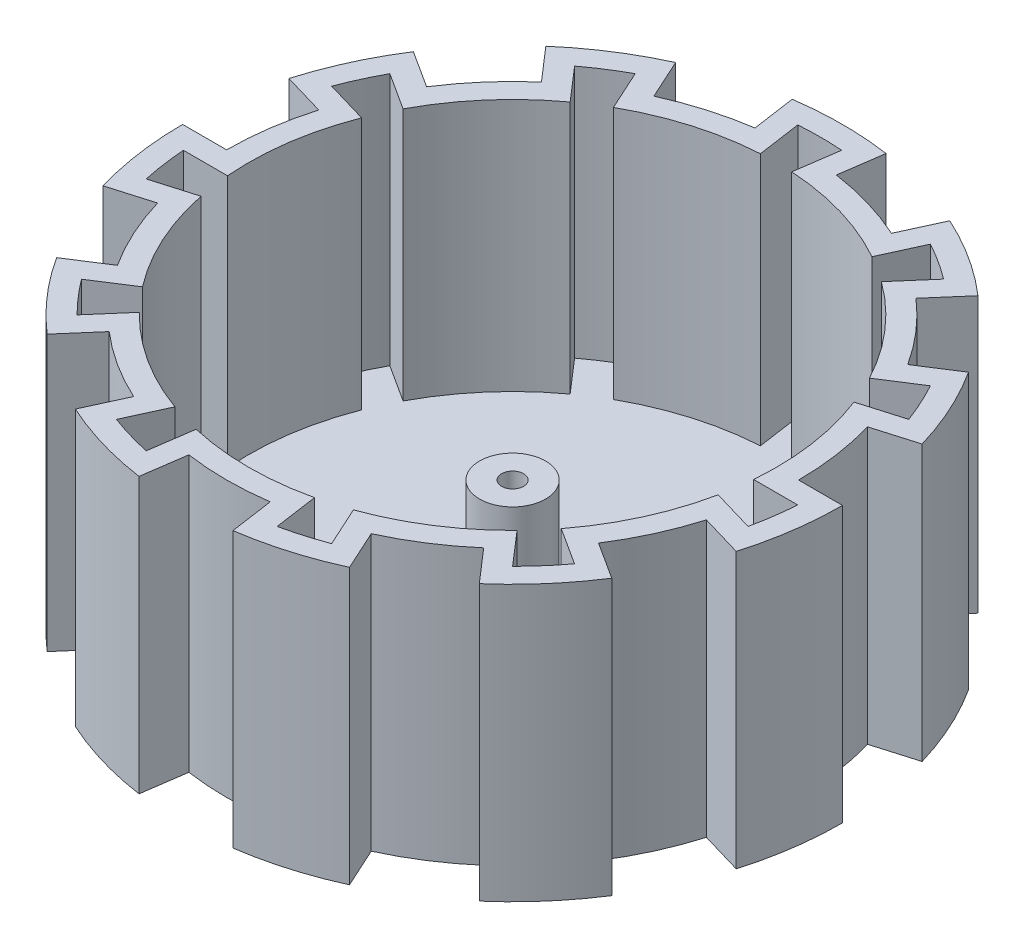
ISO-10303-21;
HEADER;
FILE_DESCRIPTION(('STEP AP214'),'2;1');
FILE_NAME('part.step','',(''),(''),'','','');
FILE_SCHEMA(('AUTOMOTIVE_DESIGN { 1 0 10303 214 1 1 1 1 }'));
ENDSEC;
DATA;
#1=APPLICATION_CONTEXT('core data for automotive mechanical design processes');
#2=APPLICATION_PROTOCOL_DEFINITION('international standard','automotive_design',2000,#1);
#3=PRODUCT_CONTEXT('',#1,'mechanical');
#4=PRODUCT('Part','Part','',(#3));
#5=PRODUCT_RELATED_PRODUCT_CATEGORY('part','',(#4));
#6=PRODUCT_DEFINITION_FORMATION('','',#4);
#7=PRODUCT_DEFINITION_CONTEXT('part definition',#1,'design');
#8=PRODUCT_DEFINITION('design','',#6,#7);
#9=PRODUCT_DEFINITION_SHAPE('','',#8);
#10=(LENGTH_UNIT() NAMED_UNIT(*) SI_UNIT(.MILLI.,.METRE.));
#11=(NAMED_UNIT(*) PLANE_ANGLE_UNIT() SI_UNIT($,.RADIAN.));
#12=(NAMED_UNIT(*) SI_UNIT($,.STERADIAN.) SOLID_ANGLE_UNIT());
#13=UNCERTAINTY_MEASURE_WITH_UNIT(LENGTH_MEASURE(1.E-05),#10,'distance_accuracy_value','');
#14=(GEOMETRIC_REPRESENTATION_CONTEXT(3) GLOBAL_UNCERTAINTY_ASSIGNED_CONTEXT((#13)) GLOBAL_UNIT_ASSIGNED_CONTEXT((#10,
#11,#12)) REPRESENTATION_CONTEXT('',''));
#15=CARTESIAN_POINT('',(0.,0.,0.));
#16=DIRECTION('',(0.,0.,1.));
#17=DIRECTION('',(1.,0.,0.));
#18=AXIS2_PLACEMENT_3D('',#15,#16,#17);
#19=CARTESIAN_POINT('',(0.,31.75,0.));
#20=DIRECTION('',(0.,-1.,0.));
#21=DIRECTION('',(0.,0.,-1.));
#22=AXIS2_PLACEMENT_3D('',#19,#20,#21);
#23=CYLINDRICAL_SURFACE('',#22,1.27);
#24=CARTESIAN_POINT('',(0.,0.,0.));
#25=DIRECTION('',(0.,1.,0.));
#26=DIRECTION('',(0.,0.,1.));
#27=AXIS2_PLACEMENT_3D('',#24,#25,#26);
#28=CIRCLE('',#27,1.27);
#29=CARTESIAN_POINT('',(0.,0.,1.27));
#30=VERTEX_POINT('',#29);
#31=EDGE_CURVE('E362',#30,#30,#28,.T.);
#32=ORIENTED_EDGE('',*,*,#31,.F.);
#33=EDGE_LOOP('',(#32));
#34=FACE_BOUND('',#33,.T.);
#35=CARTESIAN_POINT('',(0.,15.24,0.));
#36=DIRECTION('',(0.,1.,0.));
#37=DIRECTION('',(0.,0.,1.));
#38=AXIS2_PLACEMENT_3D('',#35,#36,#37);
#39=CIRCLE('',#38,1.27);
#40=CARTESIAN_POINT('',(0.,15.24,1.27));
#41=VERTEX_POINT('',#40);
#42=EDGE_CURVE('E945',#41,#41,#39,.T.);
#43=ORIENTED_EDGE('',*,*,#42,.T.);
#44=EDGE_LOOP('',(#43));
#45=FACE_BOUND('',#44,.T.);
#46=ADVANCED_FACE('F34',(#34,#45),#23,.F.);
#47=CARTESIAN_POINT('',(0.,31.75,0.));
#48=DIRECTION('',(0.,-1.,0.));
#49=DIRECTION('',(0.,0.,-1.));
#50=AXIS2_PLACEMENT_3D('',#47,#48,#49);
#51=CYLINDRICAL_SURFACE('',#50,3.81);
#52=CARTESIAN_POINT('',(0.,2.54,0.));
#53=DIRECTION('',(0.,1.,0.));
#54=DIRECTION('',(0.,0.,1.));
#55=AXIS2_PLACEMENT_3D('',#52,#53,#54);
#56=CIRCLE('',#55,3.81);
#57=CARTESIAN_POINT('',(0.,2.54,3.81));
#58=VERTEX_POINT('',#57);
#59=EDGE_CURVE('E941',#58,#58,#56,.T.);
#60=ORIENTED_EDGE('',*,*,#59,.T.);
#61=EDGE_LOOP('',(#60));
#62=FACE_BOUND('',#61,.T.);
#63=CARTESIAN_POINT('',(0.,15.24,0.));
#64=DIRECTION('',(0.,1.,0.));
#65=DIRECTION('',(0.,0.,1.));
#66=AXIS2_PLACEMENT_3D('',#63,#64,#65);
#67=CIRCLE('',#66,3.81);
#68=CARTESIAN_POINT('',(0.,15.24,3.81));
#69=VERTEX_POINT('',#68);
#70=EDGE_CURVE('E1078',#69,#69,#67,.T.);
#71=ORIENTED_EDGE('',*,*,#70,.F.);
#72=EDGE_LOOP('',(#71));
#73=FACE_BOUND('',#72,.T.);
#74=ADVANCED_FACE('F1084',(#62,#73),#51,.T.);
#75=CARTESIAN_POINT('',(0.,31.75,0.));
#76=DIRECTION('',(0.,1.,0.));
#77=DIRECTION('',(0.,0.,1.));
#78=AXIS2_PLACEMENT_3D('',#75,#76,#77);
#79=PLANE('',#78);
#80=CARTESIAN_POINT('',(0.,31.75,0.));
#81=DIRECTION('',(0.,1.,0.));
#82=DIRECTION('',(0.,0.,1.));
#83=AXIS2_PLACEMENT_3D('',#80,#81,#82);
#84=CIRCLE('',#83,35.56);
#85=CARTESIAN_POINT('',(-35.4691697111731,31.75,2.54));
#86=VERTEX_POINT('',#85);
#87=CARTESIAN_POINT('',(-34.748019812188,31.75,7.55570771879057));
#88=VERTEX_POINT('',#87);
#89=EDGE_CURVE('E809',#86,#88,#84,.T.);
#90=ORIENTED_EDGE('',*,*,#89,.F.);
#91=DIRECTION('',(-1.,0.,0.));
#92=VECTOR('',#91,1.);
#93=CARTESIAN_POINT('',(-38.1,31.75,2.54));
#94=LINE('',#93,#92);
#95=CARTESIAN_POINT('',(-30.3739822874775,31.75,2.54));
#96=VERTEX_POINT('',#95);
#97=EDGE_CURVE('E681',#96,#86,#94,.T.);
#98=ORIENTED_EDGE('',*,*,#97,.F.);
#99=CARTESIAN_POINT('',(0.,31.75,0.));
#100=DIRECTION('',(0.,1.,0.));
#101=DIRECTION('',(0.,0.,1.));
#102=AXIS2_PLACEMENT_3D('',#99,#100,#101);
#103=CIRCLE('',#102,30.48);
#104=CARTESIAN_POINT('',(-28.4280218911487,31.75,-10.9944518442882));
#105=VERTEX_POINT('',#104);
#106=EDGE_CURVE('E684',#105,#96,#103,.T.);
#107=ORIENTED_EDGE('',*,*,#106,.F.);
#108=DIRECTION('',(0.959492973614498,0.,0.281732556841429));
#109=VECTOR('',#108,1.);
#110=CARTESIAN_POINT('',(-30.9668572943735,31.75,-11.7399211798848));
#111=LINE('',#110,#109);
#112=CARTESIAN_POINT('',(-33.3168184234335,31.75,-12.4299320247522));
#113=VERTEX_POINT('',#112);
#114=EDGE_CURVE('E686',#113,#105,#111,.T.);
#115=ORIENTED_EDGE('',*,*,#114,.F.);
#116=CARTESIAN_POINT('',(0.,31.75,0.));
#117=DIRECTION('',(0.,1.,0.));
#118=DIRECTION('',(0.,0.,1.));
#119=AXIS2_PLACEMENT_3D('',#116,#117,#118);
#120=CIRCLE('',#119,35.56);
#121=CARTESIAN_POINT('',(-31.2117920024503,31.75,-17.0392969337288));
#122=VERTEX_POINT('',#121);
#123=EDGE_CURVE('E689',#122,#113,#120,.T.);
#124=ORIENTED_EDGE('',*,*,#123,.F.);
#125=DIRECTION('',(-0.84125353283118,0.,-0.540640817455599));
#126=VECTOR('',#125,1.);
#127=CARTESIAN_POINT('',(-33.4249872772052,31.75,-18.4616311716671));
#128=LINE('',#127,#126);
#129=CARTESIAN_POINT('',(-26.9254475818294,31.75,-14.2846306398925));
#130=VERTEX_POINT('',#129);
#131=EDGE_CURVE('E692',#130,#122,#128,.T.);
#132=ORIENTED_EDGE('',*,*,#131,.F.);
#133=CARTESIAN_POINT('',(0.,31.75,0.));
#134=DIRECTION('',(0.,1.,0.));
#135=DIRECTION('',(0.,0.,1.));
#136=AXIS2_PLACEMENT_3D('',#133,#134,#135);
#137=CIRCLE('',#136,30.48);
#138=CARTESIAN_POINT('',(-17.9711244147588,31.75,-24.618470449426));
#139=VERTEX_POINT('',#138);
#140=EDGE_CURVE('E695',#139,#130,#137,.T.);
#141=ORIENTED_EDGE('',*,*,#140,.F.);
#142=DIRECTION('',(0.654860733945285,0.,0.755749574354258));
#143=VECTOR('',#142,1.);
#144=CARTESIAN_POINT('',(-19.7038975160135,31.75,-26.6181972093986));
#145=LINE('',#144,#143);
#146=CARTESIAN_POINT('',(-21.3077625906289,31.75,-28.4691561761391));
#147=VERTEX_POINT('',#146);
#148=EDGE_CURVE('E698',#147,#139,#145,.T.);
#149=ORIENTED_EDGE('',*,*,#148,.F.);
#150=CARTESIAN_POINT('',(0.,31.75,0.));
#151=DIRECTION('',(0.,1.,0.));
#152=DIRECTION('',(0.,0.,1.));
#153=AXIS2_PLACEMENT_3D('',#150,#151,#152);
#154=CIRCLE('',#153,35.56);
#155=CARTESIAN_POINT('',(-17.0448908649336,31.75,-31.2087374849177));
#156=VERTEX_POINT('',#155);
#157=EDGE_CURVE('E701',#156,#147,#154,.T.);
#158=ORIENTED_EDGE('',*,*,#157,.F.);
#159=DIRECTION('',(-0.415415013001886,0.,-0.909631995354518));
#160=VECTOR('',#159,1.);
#161=CARTESIAN_POINT('',(-18.1377772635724,31.75,-33.6018248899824));
#162=LINE('',#161,#160);
#163=CARTESIAN_POINT('',(-14.928273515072,31.75,-26.5739919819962));
#164=VERTEX_POINT('',#163);
#165=EDGE_CURVE('E704',#164,#156,#162,.T.);
#166=ORIENTED_EDGE('',*,*,#165,.F.);
#167=CARTESIAN_POINT('',(0.,31.75,0.));
#168=DIRECTION('',(0.,1.,0.));
#169=DIRECTION('',(0.,0.,1.));
#170=AXIS2_PLACEMENT_3D('',#167,#168,#169);
#171=CIRCLE('',#170,30.48);
#172=CARTESIAN_POINT('',(-1.80852191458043,31.75,-30.4262986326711));
#173=VERTEX_POINT('',#172);
#174=EDGE_CURVE('E707',#173,#164,#171,.T.);
#175=ORIENTED_EDGE('',*,*,#174,.F.);
#176=DIRECTION('',(0.142314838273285,0.,0.989821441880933));
#177=VECTOR('',#176,1.);
#178=CARTESIAN_POINT('',(-2.18508949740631,31.75,-33.0453837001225));
#179=LINE('',#178,#177);
#180=CARTESIAN_POINT('',(-2.53364268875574,31.75,-35.469624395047));
#181=VERTEX_POINT('',#180);
#182=EDGE_CURVE('E710',#181,#173,#179,.T.);
#183=ORIENTED_EDGE('',*,*,#182,.F.);
#184=CARTESIAN_POINT('',(0.,31.75,0.));
#185=DIRECTION('',(0.,1.,0.));
#186=DIRECTION('',(0.,0.,1.));
#187=AXIS2_PLACEMENT_3D('',#184,#185,#186);
#188=CIRCLE('',#187,35.56);
#189=CARTESIAN_POINT('',(2.53364268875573,31.75,-35.469624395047));
#190=VERTEX_POINT('',#189);
#191=EDGE_CURVE('E713',#190,#181,#188,.T.);
#192=ORIENTED_EDGE('',*,*,#191,.F.);
#193=DIRECTION('',(0.142314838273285,0.,-0.989821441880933));
#194=VECTOR('',#193,1.);
#195=CARTESIAN_POINT('',(2.90804887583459,31.75,-38.0736766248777));
#196=LINE('',#195,#194);
#197=CARTESIAN_POINT('',(1.80852191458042,31.75,-30.4262986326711));
#198=VERTEX_POINT('',#197);
#199=EDGE_CURVE('E716',#198,#190,#196,.T.);
#200=ORIENTED_EDGE('',*,*,#199,.F.);
#201=CARTESIAN_POINT('',(0.,31.75,0.));
#202=DIRECTION('',(0.,1.,0.));
#203=DIRECTION('',(0.,0.,1.));
#204=AXIS2_PLACEMENT_3D('',#201,#202,#203);
#205=CIRCLE('',#204,30.48);
#206=CARTESIAN_POINT('',(14.928273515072,31.75,-26.5739919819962));
#207=VERTEX_POINT('',#206);
#208=EDGE_CURVE('E719',#207,#198,#205,.T.);
#209=ORIENTED_EDGE('',*,*,#208,.F.);
#210=DIRECTION('',(-0.415415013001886,0.,0.909631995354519));
#211=VECTOR('',#210,1.);
#212=CARTESIAN_POINT('',(16.0274689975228,31.75,-28.9808943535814));
#213=LINE('',#212,#211);
#214=CARTESIAN_POINT('',(17.0448908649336,31.75,-31.2087374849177));
#215=VERTEX_POINT('',#214);
#216=EDGE_CURVE('E722',#215,#207,#213,.T.);
#217=ORIENTED_EDGE('',*,*,#216,.F.);
#218=CARTESIAN_POINT('',(0.,31.75,0.));
#219=DIRECTION('',(0.,1.,0.));
#220=DIRECTION('',(0.,0.,1.));
#221=AXIS2_PLACEMENT_3D('',#218,#219,#220);
#222=CIRCLE('',#221,35.56);
#223=CARTESIAN_POINT('',(21.3077625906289,31.75,-28.4691561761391));
#224=VERTEX_POINT('',#223);
#225=EDGE_CURVE('E725',#224,#215,#222,.T.);
#226=ORIENTED_EDGE('',*,*,#225,.F.);
#227=DIRECTION('',(0.654860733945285,0.,-0.755749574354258));
#228=VECTOR('',#227,1.);
#229=CARTESIAN_POINT('',(23.0305900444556,31.75,-30.4574050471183));
#230=LINE('',#229,#228);
#231=CARTESIAN_POINT('',(17.9711244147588,31.75,-24.618470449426));
#232=VERTEX_POINT('',#231);
#233=EDGE_CURVE('E728',#232,#224,#230,.T.);
#234=ORIENTED_EDGE('',*,*,#233,.F.);
#235=CARTESIAN_POINT('',(0.,31.75,0.));
#236=DIRECTION('',(0.,1.,0.));
#237=DIRECTION('',(0.,0.,1.));
#238=AXIS2_PLACEMENT_3D('',#235,#236,#237);
#239=CIRCLE('',#238,30.48);
#240=CARTESIAN_POINT('',(26.9254475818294,31.75,-14.2846306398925));
#241=VERTEX_POINT('',#240);
#242=EDGE_CURVE('E731',#241,#232,#239,.T.);
#243=ORIENTED_EDGE('',*,*,#242,.F.);
#244=DIRECTION('',(-0.841253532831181,0.,0.540640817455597));
#245=VECTOR('',#244,1.);
#246=CARTESIAN_POINT('',(29.1514193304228,31.75,-15.7151758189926));
#247=LINE('',#246,#245);
#248=CARTESIAN_POINT('',(31.2117920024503,31.75,-17.0392969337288));
#249=VERTEX_POINT('',#248);
#250=EDGE_CURVE('E734',#249,#241,#247,.T.);
#251=ORIENTED_EDGE('',*,*,#250,.F.);
#252=CARTESIAN_POINT('',(0.,31.75,0.));
#253=DIRECTION('',(0.,1.,0.));
#254=DIRECTION('',(0.,0.,1.));
#255=AXIS2_PLACEMENT_3D('',#252,#253,#254);
#256=CIRCLE('',#255,35.56);
#257=CARTESIAN_POINT('',(33.3168184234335,31.75,-12.4299320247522));
#258=VERTEX_POINT('',#257);
#259=EDGE_CURVE('E737',#258,#249,#256,.T.);
#260=ORIENTED_EDGE('',*,*,#259,.F.);
#261=DIRECTION('',(0.959492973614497,0.,-0.28173255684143));
#262=VECTOR('',#261,1.);
#263=CARTESIAN_POINT('',(35.8410816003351,31.75,-13.1711225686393));
#264=LINE('',#263,#262);
#265=CARTESIAN_POINT('',(28.4280218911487,31.75,-10.9944518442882));
#266=VERTEX_POINT('',#265);
#267=EDGE_CURVE('E740',#266,#258,#264,.T.);
#268=ORIENTED_EDGE('',*,*,#267,.F.);
#269=CARTESIAN_POINT('',(0.,31.75,0.));
#270=DIRECTION('',(0.,1.,0.));
#271=DIRECTION('',(0.,0.,1.));
#272=AXIS2_PLACEMENT_3D('',#269,#270,#271);
#273=CIRCLE('',#272,30.48);
#274=CARTESIAN_POINT('',(30.3739822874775,31.75,2.54));
#275=VERTEX_POINT('',#274);
#276=EDGE_CURVE('E743',#275,#266,#273,.T.);
#277=ORIENTED_EDGE('',*,*,#276,.F.);
#278=DIRECTION('',(-1.,0.,0.));
#279=VECTOR('',#278,1.);
#280=CARTESIAN_POINT('',(33.02,31.75,2.54));
#281=LINE('',#280,#279);
#282=CARTESIAN_POINT('',(35.4691697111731,31.75,2.54));
#283=VERTEX_POINT('',#282);
#284=EDGE_CURVE('E746',#283,#275,#281,.T.);
#285=ORIENTED_EDGE('',*,*,#284,.F.);
#286=CARTESIAN_POINT('',(0.,31.75,0.));
#287=DIRECTION('',(0.,1.,0.));
#288=DIRECTION('',(0.,0.,1.));
#289=AXIS2_PLACEMENT_3D('',#286,#287,#288);
#290=CIRCLE('',#289,35.56);
#291=CARTESIAN_POINT('',(34.748019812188,31.75,7.55570771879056));
#292=VERTEX_POINT('',#291);
#293=EDGE_CURVE('E749',#292,#283,#290,.T.);
#294=ORIENTED_EDGE('',*,*,#293,.F.);
#295=DIRECTION('',(0.959492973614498,0.,0.281732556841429));
#296=VECTOR('',#295,1.);
#297=CARTESIAN_POINT('',(37.2722829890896,31.75,8.29689826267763));
#298=LINE('',#297,#296);
#299=CARTESIAN_POINT('',(29.8592232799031,31.75,6.12022753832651));
#300=VERTEX_POINT('',#299);
#301=EDGE_CURVE('E752',#300,#292,#298,.T.);
#302=ORIENTED_EDGE('',*,*,#301,.F.);
#303=CARTESIAN_POINT('',(0.,31.75,0.));
#304=DIRECTION('',(0.,1.,0.));
#305=DIRECTION('',(0.,0.,1.));
#306=AXIS2_PLACEMENT_3D('',#303,#304,#305);
#307=CIRCLE('',#306,30.48);
#308=CARTESIAN_POINT('',(24.178992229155,31.75,18.5581985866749));
#309=VERTEX_POINT('',#308);
#310=EDGE_CURVE('E755',#309,#300,#307,.T.);
#311=ORIENTED_EDGE('',*,*,#310,.F.);
#312=DIRECTION('',(-0.84125353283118,0.,-0.540640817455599));
#313=VECTOR('',#312,1.);
#314=CARTESIAN_POINT('',(26.4049639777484,31.75,19.9887437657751));
#315=LINE('',#314,#313);
#316=CARTESIAN_POINT('',(28.4653366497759,31.75,21.3128648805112));
#317=VERTEX_POINT('',#316);
#318=EDGE_CURVE('E758',#317,#309,#315,.T.);
#319=ORIENTED_EDGE('',*,*,#318,.F.);
#320=CARTESIAN_POINT('',(0.,31.75,0.));
#321=DIRECTION('',(0.,1.,0.));
#322=DIRECTION('',(0.,0.,1.));
#323=AXIS2_PLACEMENT_3D('',#320,#321,#322);
#324=CIRCLE('',#323,35.56);
#325=CARTESIAN_POINT('',(25.1469704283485,31.75,25.142463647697));
#326=VERTEX_POINT('',#325);
#327=EDGE_CURVE('E761',#326,#317,#324,.T.);
#328=ORIENTED_EDGE('',*,*,#327,.F.);
#329=DIRECTION('',(0.654860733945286,0.,0.755749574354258));
#330=VECTOR('',#329,1.);
#331=CARTESIAN_POINT('',(26.8697978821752,31.75,27.1307125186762));
#332=LINE('',#331,#330);
#333=CARTESIAN_POINT('',(21.8103322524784,31.75,21.2917779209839));
#334=VERTEX_POINT('',#333);
#335=EDGE_CURVE('E764',#334,#326,#332,.T.);
#336=ORIENTED_EDGE('',*,*,#335,.F.);
#337=CARTESIAN_POINT('',(0.,31.75,0.));
#338=DIRECTION('',(0.,1.,0.));
#339=DIRECTION('',(0.,0.,1.));
#340=AXIS2_PLACEMENT_3D('',#337,#338,#339);
#341=CIRCLE('',#340,30.48);
#342=CARTESIAN_POINT('',(10.3073429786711,31.75,28.6843002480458));
#343=VERTEX_POINT('',#342);
#344=EDGE_CURVE('E767',#343,#334,#341,.T.);
#345=ORIENTED_EDGE('',*,*,#344,.F.);
#346=DIRECTION('',(-0.415415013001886,0.,-0.909631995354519));
#347=VECTOR('',#346,1.);
#348=CARTESIAN_POINT('',(11.4065384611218,31.75,31.091202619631));
#349=LINE('',#348,#347);
#350=CARTESIAN_POINT('',(12.4239603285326,31.75,33.3190457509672));
#351=VERTEX_POINT('',#350);
#352=EDGE_CURVE('E770',#351,#343,#349,.T.);
#353=ORIENTED_EDGE('',*,*,#352,.F.);
#354=CARTESIAN_POINT('',(0.,31.75,0.));
#355=DIRECTION('',(0.,1.,0.));
#356=DIRECTION('',(0.,0.,1.));
#357=AXIS2_PLACEMENT_3D('',#354,#355,#356);
#358=CIRCLE('',#357,35.56);
#359=CARTESIAN_POINT('',(7.56193561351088,31.75,34.7466650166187));
#360=VERTEX_POINT('',#359);
#361=EDGE_CURVE('E773',#360,#351,#358,.T.);
#362=ORIENTED_EDGE('',*,*,#361,.F.);
#363=DIRECTION('',(0.142314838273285,0.,0.989821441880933));
#364=VECTOR('',#363,1.);
#365=CARTESIAN_POINT('',(7.93634180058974,31.75,37.3507172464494));
#366=LINE('',#365,#364);
#367=CARTESIAN_POINT('',(6.83681483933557,31.75,29.7033392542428));
#368=VERTEX_POINT('',#367);
#369=EDGE_CURVE('E776',#368,#360,#366,.T.);
#370=ORIENTED_EDGE('',*,*,#369,.F.);
#371=CARTESIAN_POINT('',(0.,31.75,0.));
#372=DIRECTION('',(0.,1.,0.));
#373=DIRECTION('',(0.,0.,1.));
#374=AXIS2_PLACEMENT_3D('',#371,#372,#373);
#375=CIRCLE('',#374,30.48);
#376=CARTESIAN_POINT('',(-6.83681483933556,31.75,29.7033392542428));
#377=VERTEX_POINT('',#376);
#378=EDGE_CURVE('E779',#377,#368,#375,.T.);
#379=ORIENTED_EDGE('',*,*,#378,.F.);
#380=DIRECTION('',(0.142314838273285,0.,-0.989821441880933));
#381=VECTOR('',#380,1.);
#382=CARTESIAN_POINT('',(-7.21338242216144,31.75,32.3224243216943));
#383=LINE('',#382,#381);
#384=CARTESIAN_POINT('',(-7.56193561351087,31.75,34.7466650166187));
#385=VERTEX_POINT('',#384);
#386=EDGE_CURVE('E782',#385,#377,#383,.T.);
#387=ORIENTED_EDGE('',*,*,#386,.F.);
#388=CARTESIAN_POINT('',(0.,31.75,0.));
#389=DIRECTION('',(0.,1.,0.));
#390=DIRECTION('',(0.,0.,1.));
#391=AXIS2_PLACEMENT_3D('',#388,#389,#390);
#392=CIRCLE('',#391,35.56);
#393=CARTESIAN_POINT('',(-12.4239603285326,31.75,33.3190457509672));
#394=VERTEX_POINT('',#393);
#395=EDGE_CURVE('E785',#394,#385,#392,.T.);
#396=ORIENTED_EDGE('',*,*,#395,.F.);
#397=DIRECTION('',(-0.415415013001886,0.,0.909631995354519));
#398=VECTOR('',#397,1.);
#399=CARTESIAN_POINT('',(-13.5168467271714,31.75,35.7121331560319));
#400=LINE('',#399,#398);
#401=CARTESIAN_POINT('',(-10.3073429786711,31.75,28.6843002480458));
#402=VERTEX_POINT('',#401);
#403=EDGE_CURVE('E788',#402,#394,#400,.T.);
#404=ORIENTED_EDGE('',*,*,#403,.F.);
#405=CARTESIAN_POINT('',(0.,31.75,0.));
#406=DIRECTION('',(0.,1.,0.));
#407=DIRECTION('',(0.,0.,1.));
#408=AXIS2_PLACEMENT_3D('',#405,#406,#407);
#409=CIRCLE('',#408,30.48);
#410=CARTESIAN_POINT('',(-21.8103322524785,31.75,21.2917779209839));
#411=VERTEX_POINT('',#410);
#412=EDGE_CURVE('E791',#411,#402,#409,.T.);
#413=ORIENTED_EDGE('',*,*,#412,.F.);
#414=DIRECTION('',(0.654860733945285,0.,-0.755749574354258));
#415=VECTOR('',#414,1.);
#416=CARTESIAN_POINT('',(-23.5431053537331,31.75,23.2915046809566));
#417=LINE('',#416,#415);
#418=CARTESIAN_POINT('',(-25.1469704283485,31.75,25.142463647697));
#419=VERTEX_POINT('',#418);
#420=EDGE_CURVE('E794',#419,#411,#417,.T.);
#421=ORIENTED_EDGE('',*,*,#420,.F.);
#422=CARTESIAN_POINT('',(0.,31.75,0.));
#423=DIRECTION('',(0.,1.,0.));
#424=DIRECTION('',(0.,0.,1.));
#425=AXIS2_PLACEMENT_3D('',#422,#423,#424);
#426=CIRCLE('',#425,35.56);
#427=CARTESIAN_POINT('',(-28.4653366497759,31.75,21.3128648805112));
#428=VERTEX_POINT('',#427);
#429=EDGE_CURVE('E797',#428,#419,#426,.T.);
#430=ORIENTED_EDGE('',*,*,#429,.F.);
#431=DIRECTION('',(-0.841253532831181,0.,0.540640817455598));
#432=VECTOR('',#431,1.);
#433=CARTESIAN_POINT('',(-30.6785319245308,31.75,22.7351991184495));
#434=LINE('',#433,#432);
#435=CARTESIAN_POINT('',(-24.178992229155,31.75,18.5581985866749));
#436=VERTEX_POINT('',#435);
#437=EDGE_CURVE('E800',#436,#428,#434,.T.);
#438=ORIENTED_EDGE('',*,*,#437,.F.);
#439=CARTESIAN_POINT('',(0.,31.75,0.));
#440=DIRECTION('',(0.,1.,0.));
#441=DIRECTION('',(0.,0.,1.));
#442=AXIS2_PLACEMENT_3D('',#439,#440,#441);
#443=CIRCLE('',#442,30.48);
#444=CARTESIAN_POINT('',(-29.8592232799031,31.75,6.12022753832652));
#445=VERTEX_POINT('',#444);
#446=EDGE_CURVE('E803',#445,#436,#443,.T.);
#447=ORIENTED_EDGE('',*,*,#446,.F.);
#448=DIRECTION('',(0.959492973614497,0.,-0.28173255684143));
#449=VECTOR('',#448,1.);
#450=CARTESIAN_POINT('',(-32.3980586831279,31.75,6.86569687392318));
#451=LINE('',#450,#449);
#452=EDGE_CURVE('E806',#88,#445,#451,.T.);
#453=ORIENTED_EDGE('',*,*,#452,.F.);
#454=EDGE_LOOP('',(#90,#98,#107,#115,#124,#132,#141,#149,#158,#166,#175,#183,#192,#200,#209,
#217,#226,#234,#243,#251,#260,#268,#277,#285,#294,#302,#311,#319,#328,#336,#345,#353,#362,#370,
#379,#387,#396,#404,#413,#421,#430,#438,#447,#453));
#455=FACE_BOUND('',#454,.T.);
#456=CARTESIAN_POINT('',(0.,31.75,0.));
#457=DIRECTION('',(0.,1.,0.));
#458=DIRECTION('',(0.,0.,1.));
#459=AXIS2_PLACEMENT_3D('',#456,#457,#458);
#460=CIRCLE('',#459,38.1);
#461=CARTESIAN_POINT('',(-38.1,31.75,0.));
#462=VERTEX_POINT('',#461);
#463=CARTESIAN_POINT('',(-36.5566822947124,31.75,10.7340104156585));
#464=VERTEX_POINT('',#463);
#465=EDGE_CURVE('E446',#462,#464,#460,.T.);
#466=ORIENTED_EDGE('',*,*,#465,.T.);
#467=DIRECTION('',(0.959492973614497,0.,-0.28173255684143));
#468=VECTOR('',#467,1.);
#469=CARTESIAN_POINT('',(-31.6824579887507,31.75,9.30280902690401));
#470=LINE('',#469,#468);
#471=CARTESIAN_POINT('',(-31.6824579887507,31.75,9.302809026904));
#472=VERTEX_POINT('',#471);
#473=EDGE_CURVE('E207',#464,#472,#470,.T.);
#474=ORIENTED_EDGE('',*,*,#473,.T.);
#475=CARTESIAN_POINT('',(0.,31.75,0.));
#476=DIRECTION('',(0.,1.,0.));
#477=DIRECTION('',(0.,0.,1.));
#478=AXIS2_PLACEMENT_3D('',#475,#476,#477);
#479=CIRCLE('',#478,33.02);
#480=CARTESIAN_POINT('',(-27.7781916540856,31.75,17.8519597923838));
#481=VERTEX_POINT('',#480);
#482=EDGE_CURVE('E569',#472,#481,#479,.T.);
#483=ORIENTED_EDGE('',*,*,#482,.T.);
#484=DIRECTION('',(-0.841253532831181,0.,0.540640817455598));
#485=VECTOR('',#484,1.);
#486=CARTESIAN_POINT('',(-32.051759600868,31.75,20.5984151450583));
#487=LINE('',#486,#485);
#488=CARTESIAN_POINT('',(-32.051759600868,31.75,20.5984151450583));
#489=VERTEX_POINT('',#488);
#490=EDGE_CURVE('E588',#481,#489,#487,.T.);
#491=ORIENTED_EDGE('',*,*,#490,.T.);
#492=CARTESIAN_POINT('',(0.,31.75,0.));
#493=DIRECTION('',(0.,1.,0.));
#494=DIRECTION('',(0.,0.,1.));
#495=AXIS2_PLACEMENT_3D('',#492,#493,#494);
#496=CIRCLE('',#495,38.1);
#497=CARTESIAN_POINT('',(-24.9501939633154,31.75,28.7940587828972));
#498=VERTEX_POINT('',#497);
#499=EDGE_CURVE('E585',#489,#498,#496,.T.);
#500=ORIENTED_EDGE('',*,*,#499,.T.);
#501=DIRECTION('',(0.654860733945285,0.,-0.755749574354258));
#502=VECTOR('',#501,1.);
#503=CARTESIAN_POINT('',(-21.6235014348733,31.75,24.9548509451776));
#504=LINE('',#503,#502);
#505=CARTESIAN_POINT('',(-21.6235014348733,31.75,24.9548509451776));
#506=VERTEX_POINT('',#505);
#507=EDGE_CURVE('E587',#498,#506,#504,.T.);
#508=ORIENTED_EDGE('',*,*,#507,.T.);
#509=CARTESIAN_POINT('',(0.,31.75,0.));
#510=DIRECTION('',(0.,1.,0.));
#511=DIRECTION('',(0.,0.,1.));
#512=AXIS2_PLACEMENT_3D('',#509,#510,#511);
#513=CIRCLE('',#512,33.02);
#514=CARTESIAN_POINT('',(-13.7170037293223,31.75,30.0360484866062));
#515=VERTEX_POINT('',#514);
#516=EDGE_CURVE('E590',#506,#515,#513,.T.);
#517=ORIENTED_EDGE('',*,*,#516,.T.);
#518=DIRECTION('',(-0.415415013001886,0.,0.909631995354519));
#519=VECTOR('',#518,1.);
#520=CARTESIAN_POINT('',(-15.8273119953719,31.75,34.6569790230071));
#521=LINE('',#520,#519);
#522=CARTESIAN_POINT('',(-15.8273119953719,31.75,34.6569790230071));
#523=VERTEX_POINT('',#522);
#524=EDGE_CURVE('E596',#515,#523,#521,.T.);
#525=ORIENTED_EDGE('',*,*,#524,.T.);
#526=CARTESIAN_POINT('',(0.,31.75,0.));
#527=DIRECTION('',(0.,1.,0.));
#528=DIRECTION('',(0.,0.,1.));
#529=AXIS2_PLACEMENT_3D('',#526,#527,#528);
#530=CIRCLE('',#529,38.1);
#531=CARTESIAN_POINT('',(-5.42219533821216,31.75,37.7121969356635));
#532=VERTEX_POINT('',#531);
#533=EDGE_CURVE('E598',#523,#532,#530,.T.);
#534=ORIENTED_EDGE('',*,*,#533,.T.);
#535=DIRECTION('',(0.142314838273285,0.,-0.989821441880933));
#536=VECTOR('',#535,1.);
#537=CARTESIAN_POINT('',(-4.69923595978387,31.75,32.6839040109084));
#538=LINE('',#537,#536);
#539=CARTESIAN_POINT('',(-4.69923595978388,31.75,32.6839040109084));
#540=VERTEX_POINT('',#539);
#541=EDGE_CURVE('E600',#532,#540,#538,.T.);
#542=ORIENTED_EDGE('',*,*,#541,.T.);
#543=CARTESIAN_POINT('',(0.,31.75,0.));
#544=DIRECTION('',(0.,1.,0.));
#545=DIRECTION('',(0.,0.,1.));
#546=AXIS2_PLACEMENT_3D('',#543,#544,#545);
#547=CIRCLE('',#546,33.02);
#548=CARTESIAN_POINT('',(4.69923595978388,31.75,32.6839040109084));
#549=VERTEX_POINT('',#548);
#550=EDGE_CURVE('E602',#540,#549,#547,.T.);
#551=ORIENTED_EDGE('',*,*,#550,.T.);
#552=DIRECTION('',(0.142314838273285,0.,0.989821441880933));
#553=VECTOR('',#552,1.);
#554=CARTESIAN_POINT('',(5.42219533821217,31.75,37.7121969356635));
#555=LINE('',#554,#553);
#556=CARTESIAN_POINT('',(5.42219533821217,31.75,37.7121969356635));
#557=VERTEX_POINT('',#556);
#558=EDGE_CURVE('E604',#549,#557,#555,.T.);
#559=ORIENTED_EDGE('',*,*,#558,.T.);
#560=CARTESIAN_POINT('',(0.,31.75,0.));
#561=DIRECTION('',(0.,1.,0.));
#562=DIRECTION('',(0.,0.,1.));
#563=AXIS2_PLACEMENT_3D('',#560,#561,#562);
#564=CIRCLE('',#563,38.1);
#565=CARTESIAN_POINT('',(15.8273119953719,31.75,34.6569790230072));
#566=VERTEX_POINT('',#565);
#567=EDGE_CURVE('E606',#557,#566,#564,.T.);
#568=ORIENTED_EDGE('',*,*,#567,.T.);
#569=DIRECTION('',(-0.415415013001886,0.,-0.909631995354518));
#570=VECTOR('',#569,1.);
#571=CARTESIAN_POINT('',(13.7170037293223,31.75,30.0360484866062));
#572=LINE('',#571,#570);
#573=CARTESIAN_POINT('',(13.7170037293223,31.75,30.0360484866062));
#574=VERTEX_POINT('',#573);
#575=EDGE_CURVE('E608',#566,#574,#572,.T.);
#576=ORIENTED_EDGE('',*,*,#575,.T.);
#577=CARTESIAN_POINT('',(0.,31.75,0.));
#578=DIRECTION('',(0.,1.,0.));
#579=DIRECTION('',(0.,0.,1.));
#580=AXIS2_PLACEMENT_3D('',#577,#578,#579);
#581=CIRCLE('',#580,33.02);
#582=CARTESIAN_POINT('',(21.6235014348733,31.75,24.9548509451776));
#583=VERTEX_POINT('',#582);
#584=EDGE_CURVE('E610',#574,#583,#581,.T.);
#585=ORIENTED_EDGE('',*,*,#584,.T.);
#586=DIRECTION('',(0.654860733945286,0.,0.755749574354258));
#587=VECTOR('',#586,1.);
#588=CARTESIAN_POINT('',(24.9501939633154,31.75,28.7940587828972));
#589=LINE('',#588,#587);
#590=CARTESIAN_POINT('',(24.9501939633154,31.75,28.7940587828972));
#591=VERTEX_POINT('',#590);
#592=EDGE_CURVE('E612',#583,#591,#589,.T.);
#593=ORIENTED_EDGE('',*,*,#592,.T.);
#594=CARTESIAN_POINT('',(0.,31.75,0.));
#595=DIRECTION('',(0.,1.,0.));
#596=DIRECTION('',(0.,0.,1.));
#597=AXIS2_PLACEMENT_3D('',#594,#595,#596);
#598=CIRCLE('',#597,38.1);
#599=CARTESIAN_POINT('',(32.051759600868,31.75,20.5984151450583));
#600=VERTEX_POINT('',#599);
#601=EDGE_CURVE('E614',#591,#600,#598,.T.);
#602=ORIENTED_EDGE('',*,*,#601,.T.);
#603=DIRECTION('',(-0.84125353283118,0.,-0.540640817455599));
#604=VECTOR('',#603,1.);
#605=CARTESIAN_POINT('',(27.7781916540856,31.75,17.8519597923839));
#606=LINE('',#605,#604);
#607=CARTESIAN_POINT('',(27.7781916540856,31.75,17.8519597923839));
#608=VERTEX_POINT('',#607);
#609=EDGE_CURVE('E616',#600,#608,#606,.T.);
#610=ORIENTED_EDGE('',*,*,#609,.T.);
#611=CARTESIAN_POINT('',(0.,31.75,0.));
#612=DIRECTION('',(0.,1.,0.));
#613=DIRECTION('',(0.,0.,1.));
#614=AXIS2_PLACEMENT_3D('',#611,#612,#613);
#615=CIRCLE('',#614,33.02);
#616=CARTESIAN_POINT('',(31.6824579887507,31.75,9.302809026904));
#617=VERTEX_POINT('',#616);
#618=EDGE_CURVE('E618',#608,#617,#615,.T.);
#619=ORIENTED_EDGE('',*,*,#618,.T.);
#620=DIRECTION('',(0.959492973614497,0.,0.281732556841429));
#621=VECTOR('',#620,1.);
#622=CARTESIAN_POINT('',(36.5566822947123,31.75,10.7340104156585));
#623=LINE('',#622,#621);
#624=CARTESIAN_POINT('',(36.5566822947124,31.75,10.7340104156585));
#625=VERTEX_POINT('',#624);
#626=EDGE_CURVE('E620',#617,#625,#623,.T.);
#627=ORIENTED_EDGE('',*,*,#626,.T.);
#628=CARTESIAN_POINT('',(0.,31.75,0.));
#629=DIRECTION('',(0.,1.,0.));
#630=DIRECTION('',(0.,0.,1.));
#631=AXIS2_PLACEMENT_3D('',#628,#629,#630);
#632=CIRCLE('',#631,38.1);
#633=CARTESIAN_POINT('',(38.1,31.75,0.));
#634=VERTEX_POINT('',#633);
#635=EDGE_CURVE('E622',#625,#634,#632,.T.);
#636=ORIENTED_EDGE('',*,*,#635,.T.);
#637=DIRECTION('',(-1.,0.,0.));
#638=VECTOR('',#637,1.);
#639=CARTESIAN_POINT('',(33.02,31.75,0.));
#640=LINE('',#639,#638);
#641=CARTESIAN_POINT('',(33.02,31.75,0.));
#642=VERTEX_POINT('',#641);
#643=EDGE_CURVE('E624',#634,#642,#640,.T.);
#644=ORIENTED_EDGE('',*,*,#643,.T.);
#645=CARTESIAN_POINT('',(0.,31.75,0.));
#646=DIRECTION('',(0.,1.,0.));
#647=DIRECTION('',(0.,0.,1.));
#648=AXIS2_PLACEMENT_3D('',#645,#646,#647);
#649=CIRCLE('',#648,33.02);
#650=CARTESIAN_POINT('',(31.6824579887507,31.75,-9.30280902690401));
#651=VERTEX_POINT('',#650);
#652=EDGE_CURVE('E626',#642,#651,#649,.T.);
#653=ORIENTED_EDGE('',*,*,#652,.T.);
#654=DIRECTION('',(0.959492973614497,0.,-0.28173255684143));
#655=VECTOR('',#654,1.);
#656=CARTESIAN_POINT('',(36.5566822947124,31.75,-10.7340104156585));
#657=LINE('',#656,#655);
#658=CARTESIAN_POINT('',(36.5566822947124,31.75,-10.7340104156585));
#659=VERTEX_POINT('',#658);
#660=EDGE_CURVE('E628',#651,#659,#657,.T.);
#661=ORIENTED_EDGE('',*,*,#660,.T.);
#662=CARTESIAN_POINT('',(0.,31.75,0.));
#663=DIRECTION('',(0.,1.,0.));
#664=DIRECTION('',(0.,0.,1.));
#665=AXIS2_PLACEMENT_3D('',#662,#663,#664);
#666=CIRCLE('',#665,38.1);
#667=CARTESIAN_POINT('',(32.051759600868,31.75,-20.5984151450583));
#668=VERTEX_POINT('',#667);
#669=EDGE_CURVE('E630',#659,#668,#666,.T.);
#670=ORIENTED_EDGE('',*,*,#669,.T.);
#671=DIRECTION('',(-0.841253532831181,0.,0.540640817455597));
#672=VECTOR('',#671,1.);
#673=CARTESIAN_POINT('',(27.7781916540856,31.75,-17.8519597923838));
#674=LINE('',#673,#672);
#675=CARTESIAN_POINT('',(27.7781916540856,31.75,-17.8519597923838));
#676=VERTEX_POINT('',#675);
#677=EDGE_CURVE('E632',#668,#676,#674,.T.);
#678=ORIENTED_EDGE('',*,*,#677,.T.);
#679=CARTESIAN_POINT('',(0.,31.75,0.));
#680=DIRECTION('',(0.,1.,0.));
#681=DIRECTION('',(0.,0.,1.));
#682=AXIS2_PLACEMENT_3D('',#679,#680,#681);
#683=CIRCLE('',#682,33.02);
#684=CARTESIAN_POINT('',(21.6235014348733,31.75,-24.9548509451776));
#685=VERTEX_POINT('',#684);
#686=EDGE_CURVE('E634',#676,#685,#683,.T.);
#687=ORIENTED_EDGE('',*,*,#686,.T.);
#688=DIRECTION('',(0.654860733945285,0.,-0.755749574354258));
#689=VECTOR('',#688,1.);
#690=CARTESIAN_POINT('',(24.9501939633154,31.75,-28.7940587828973));
#691=LINE('',#690,#689);
#692=CARTESIAN_POINT('',(24.9501939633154,31.75,-28.7940587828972));
#693=VERTEX_POINT('',#692);
#694=EDGE_CURVE('E636',#685,#693,#691,.T.);
#695=ORIENTED_EDGE('',*,*,#694,.T.);
#696=CARTESIAN_POINT('',(0.,31.75,0.));
#697=DIRECTION('',(0.,1.,0.));
#698=DIRECTION('',(0.,0.,1.));
#699=AXIS2_PLACEMENT_3D('',#696,#697,#698);
#700=CIRCLE('',#699,38.1);
#701=CARTESIAN_POINT('',(15.8273119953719,31.75,-34.6569790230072));
#702=VERTEX_POINT('',#701);
#703=EDGE_CURVE('E638',#693,#702,#700,.T.);
#704=ORIENTED_EDGE('',*,*,#703,.T.);
#705=DIRECTION('',(-0.415415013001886,0.,0.909631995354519));
#706=VECTOR('',#705,1.);
#707=CARTESIAN_POINT('',(13.7170037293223,31.75,-30.0360484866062));
#708=LINE('',#707,#706);
#709=CARTESIAN_POINT('',(13.7170037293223,31.75,-30.0360484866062));
#710=VERTEX_POINT('',#709);
#711=EDGE_CURVE('E640',#702,#710,#708,.T.);
#712=ORIENTED_EDGE('',*,*,#711,.T.);
#713=CARTESIAN_POINT('',(0.,31.75,0.));
#714=DIRECTION('',(0.,1.,0.));
#715=DIRECTION('',(0.,0.,1.));
#716=AXIS2_PLACEMENT_3D('',#713,#714,#715);
#717=CIRCLE('',#716,33.02);
#718=CARTESIAN_POINT('',(4.69923595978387,31.75,-32.6839040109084));
#719=VERTEX_POINT('',#718);
#720=EDGE_CURVE('E642',#710,#719,#717,.T.);
#721=ORIENTED_EDGE('',*,*,#720,.T.);
#722=DIRECTION('',(0.142314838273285,0.,-0.989821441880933));
#723=VECTOR('',#722,1.);
#724=CARTESIAN_POINT('',(5.42219533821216,31.75,-37.7121969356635));
#725=LINE('',#724,#723);
#726=CARTESIAN_POINT('',(5.42219533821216,31.75,-37.7121969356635));
#727=VERTEX_POINT('',#726);
#728=EDGE_CURVE('E644',#719,#727,#725,.T.);
#729=ORIENTED_EDGE('',*,*,#728,.T.);
#730=CARTESIAN_POINT('',(0.,31.75,0.));
#731=DIRECTION('',(0.,1.,0.));
#732=DIRECTION('',(0.,0.,1.));
#733=AXIS2_PLACEMENT_3D('',#730,#731,#732);
#734=CIRCLE('',#733,38.1);
#735=CARTESIAN_POINT('',(-5.42219533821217,31.75,-37.7121969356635));
#736=VERTEX_POINT('',#735);
#737=EDGE_CURVE('E646',#727,#736,#734,.T.);
#738=ORIENTED_EDGE('',*,*,#737,.T.);
#739=DIRECTION('',(0.142314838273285,0.,0.989821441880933));
#740=VECTOR('',#739,1.);
#741=CARTESIAN_POINT('',(-4.69923595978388,31.75,-32.6839040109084));
#742=LINE('',#741,#740);
#743=CARTESIAN_POINT('',(-4.69923595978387,31.75,-32.6839040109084));
#744=VERTEX_POINT('',#743);
#745=EDGE_CURVE('E648',#736,#744,#742,.T.);
#746=ORIENTED_EDGE('',*,*,#745,.T.);
#747=CARTESIAN_POINT('',(0.,31.75,0.));
#748=DIRECTION('',(0.,1.,0.));
#749=DIRECTION('',(0.,0.,1.));
#750=AXIS2_PLACEMENT_3D('',#747,#748,#749);
#751=CIRCLE('',#750,33.02);
#752=CARTESIAN_POINT('',(-13.7170037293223,31.75,-30.0360484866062));
#753=VERTEX_POINT('',#752);
#754=EDGE_CURVE('E650',#744,#753,#751,.T.);
#755=ORIENTED_EDGE('',*,*,#754,.T.);
#756=DIRECTION('',(-0.415415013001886,0.,-0.909631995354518));
#757=VECTOR('',#756,1.);
#758=CARTESIAN_POINT('',(-15.8273119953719,31.75,-34.6569790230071));
#759=LINE('',#758,#757);
#760=CARTESIAN_POINT('',(-15.8273119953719,31.75,-34.6569790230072));
#761=VERTEX_POINT('',#760);
#762=EDGE_CURVE('E652',#753,#761,#759,.T.);
#763=ORIENTED_EDGE('',*,*,#762,.T.);
#764=CARTESIAN_POINT('',(0.,31.75,0.));
#765=DIRECTION('',(0.,1.,0.));
#766=DIRECTION('',(0.,0.,1.));
#767=AXIS2_PLACEMENT_3D('',#764,#765,#766);
#768=CIRCLE('',#767,38.1);
#769=CARTESIAN_POINT('',(-24.9501939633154,31.75,-28.7940587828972));
#770=VERTEX_POINT('',#769);
#771=EDGE_CURVE('E654',#761,#770,#768,.T.);
#772=ORIENTED_EDGE('',*,*,#771,.T.);
#773=DIRECTION('',(0.654860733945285,0.,0.755749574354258));
#774=VECTOR('',#773,1.);
#775=CARTESIAN_POINT('',(-21.6235014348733,31.75,-24.9548509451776));
#776=LINE('',#775,#774);
#777=CARTESIAN_POINT('',(-21.6235014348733,31.75,-24.9548509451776));
#778=VERTEX_POINT('',#777);
#779=EDGE_CURVE('E656',#770,#778,#776,.T.);
#780=ORIENTED_EDGE('',*,*,#779,.T.);
#781=CARTESIAN_POINT('',(0.,31.75,0.));
#782=DIRECTION('',(0.,1.,0.));
#783=DIRECTION('',(0.,0.,1.));
#784=AXIS2_PLACEMENT_3D('',#781,#782,#783);
#785=CIRCLE('',#784,33.02);
#786=CARTESIAN_POINT('',(-27.7781916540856,31.75,-17.8519597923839));
#787=VERTEX_POINT('',#786);
#788=EDGE_CURVE('E658',#778,#787,#785,.T.);
#789=ORIENTED_EDGE('',*,*,#788,.T.);
#790=DIRECTION('',(-0.84125353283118,0.,-0.540640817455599));
#791=VECTOR('',#790,1.);
#792=CARTESIAN_POINT('',(-32.051759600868,31.75,-20.5984151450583));
#793=LINE('',#792,#791);
#794=CARTESIAN_POINT('',(-32.051759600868,31.75,-20.5984151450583));
#795=VERTEX_POINT('',#794);
#796=EDGE_CURVE('E660',#787,#795,#793,.T.);
#797=ORIENTED_EDGE('',*,*,#796,.T.);
#798=CARTESIAN_POINT('',(0.,31.75,0.));
#799=DIRECTION('',(0.,1.,0.));
#800=DIRECTION('',(0.,0.,1.));
#801=AXIS2_PLACEMENT_3D('',#798,#799,#800);
#802=CIRCLE('',#801,38.1);
#803=CARTESIAN_POINT('',(-36.5566822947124,31.75,-10.7340104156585));
#804=VERTEX_POINT('',#803);
#805=EDGE_CURVE('E337',#795,#804,#802,.T.);
#806=ORIENTED_EDGE('',*,*,#805,.T.);
#807=DIRECTION('',(0.959492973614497,0.,0.281732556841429));
#808=VECTOR('',#807,1.);
#809=CARTESIAN_POINT('',(-31.6824579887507,31.75,-9.302809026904));
#810=LINE('',#809,#808);
#811=CARTESIAN_POINT('',(-31.6824579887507,31.75,-9.30280902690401));
#812=VERTEX_POINT('',#811);
#813=EDGE_CURVE('E330',#804,#812,#810,.T.);
#814=ORIENTED_EDGE('',*,*,#813,.T.);
#815=CARTESIAN_POINT('',(0.,31.75,0.));
#816=DIRECTION('',(0.,1.,0.));
#817=DIRECTION('',(0.,0.,1.));
#818=AXIS2_PLACEMENT_3D('',#815,#816,#817);
#819=CIRCLE('',#818,33.02);
#820=CARTESIAN_POINT('',(-33.02,31.75,0.));
#821=VERTEX_POINT('',#820);
#822=EDGE_CURVE('E334',#812,#821,#819,.T.);
#823=ORIENTED_EDGE('',*,*,#822,.T.);
#824=DIRECTION('',(-1.,0.,0.));
#825=VECTOR('',#824,1.);
#826=CARTESIAN_POINT('',(-38.1,31.75,0.));
#827=LINE('',#826,#825);
#828=EDGE_CURVE('E58',#821,#462,#827,.T.);
#829=ORIENTED_EDGE('',*,*,#828,.T.);
#830=EDGE_LOOP('',(#466,#474,#483,#491,#500,#508,#517,#525,#534,#542,#551,#559,#568,#576,#585,
#593,#602,#610,#619,#627,#636,#644,#653,#661,#670,#678,#687,#695,#704,#712,#721,#729,#738,#746,
#755,#763,#772,#780,#789,#797,#806,#814,#823,#829));
#831=FACE_BOUND('',#830,.T.);
#832=ADVANCED_FACE('F332',(#455,#831),#79,.T.);
#833=CARTESIAN_POINT('',(0.,0.,0.));
#834=DIRECTION('',(0.,1.,0.));
#835=DIRECTION('',(0.,0.,1.));
#836=AXIS2_PLACEMENT_3D('',#833,#834,#835);
#837=PLANE('',#836);
#838=CARTESIAN_POINT('',(0.,0.,0.));
#839=DIRECTION('',(0.,1.,0.));
#840=DIRECTION('',(0.,0.,1.));
#841=AXIS2_PLACEMENT_3D('',#838,#839,#840);
#842=CIRCLE('',#841,38.1);
#843=CARTESIAN_POINT('',(-38.1,0.,0.));
#844=VERTEX_POINT('',#843);
#845=CARTESIAN_POINT('',(-36.5566822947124,0.,10.7340104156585));
#846=VERTEX_POINT('',#845);
#847=EDGE_CURVE('E358',#844,#846,#842,.T.);
#848=ORIENTED_EDGE('',*,*,#847,.F.);
#849=DIRECTION('',(-1.,0.,0.));
#850=VECTOR('',#849,1.);
#851=CARTESIAN_POINT('',(-38.1,0.,0.));
#852=LINE('',#851,#850);
#853=CARTESIAN_POINT('',(-33.02,0.,0.));
#854=VERTEX_POINT('',#853);
#855=EDGE_CURVE('E199',#854,#844,#852,.T.);
#856=ORIENTED_EDGE('',*,*,#855,.F.);
#857=CARTESIAN_POINT('',(0.,0.,0.));
#858=DIRECTION('',(0.,1.,0.));
#859=DIRECTION('',(0.,0.,1.));
#860=AXIS2_PLACEMENT_3D('',#857,#858,#859);
#861=CIRCLE('',#860,33.02);
#862=CARTESIAN_POINT('',(-31.6824579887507,0.,-9.30280902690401));
#863=VERTEX_POINT('',#862);
#864=EDGE_CURVE('E443',#863,#854,#861,.T.);
#865=ORIENTED_EDGE('',*,*,#864,.F.);
#866=DIRECTION('',(0.959492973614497,0.,0.281732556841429));
#867=VECTOR('',#866,1.);
#868=CARTESIAN_POINT('',(-31.6824579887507,0.,-9.302809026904));
#869=LINE('',#868,#867);
#870=CARTESIAN_POINT('',(-36.5566822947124,0.,-10.7340104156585));
#871=VERTEX_POINT('',#870);
#872=EDGE_CURVE('E346',#871,#863,#869,.T.);
#873=ORIENTED_EDGE('',*,*,#872,.F.);
#874=CARTESIAN_POINT('',(0.,0.,0.));
#875=DIRECTION('',(0.,1.,0.));
#876=DIRECTION('',(0.,0.,1.));
#877=AXIS2_PLACEMENT_3D('',#874,#875,#876);
#878=CIRCLE('',#877,38.1);
#879=CARTESIAN_POINT('',(-32.051759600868,0.,-20.5984151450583));
#880=VERTEX_POINT('',#879);
#881=EDGE_CURVE('E440',#880,#871,#878,.T.);
#882=ORIENTED_EDGE('',*,*,#881,.F.);
#883=DIRECTION('',(-0.84125353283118,0.,-0.540640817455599));
#884=VECTOR('',#883,1.);
#885=CARTESIAN_POINT('',(-32.051759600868,0.,-20.5984151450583));
#886=LINE('',#885,#884);
#887=CARTESIAN_POINT('',(-27.7781916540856,0.,-17.8519597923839));
#888=VERTEX_POINT('',#887);
#889=EDGE_CURVE('E438',#888,#880,#886,.T.);
#890=ORIENTED_EDGE('',*,*,#889,.F.);
#891=CARTESIAN_POINT('',(0.,0.,0.));
#892=DIRECTION('',(0.,1.,0.));
#893=DIRECTION('',(0.,0.,1.));
#894=AXIS2_PLACEMENT_3D('',#891,#892,#893);
#895=CIRCLE('',#894,33.02);
#896=CARTESIAN_POINT('',(-21.6235014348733,0.,-24.9548509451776));
#897=VERTEX_POINT('',#896);
#898=EDGE_CURVE('E436',#897,#888,#895,.T.);
#899=ORIENTED_EDGE('',*,*,#898,.F.);
#900=DIRECTION('',(0.654860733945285,0.,0.755749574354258));
#901=VECTOR('',#900,1.);
#902=CARTESIAN_POINT('',(-21.6235014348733,0.,-24.9548509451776));
#903=LINE('',#902,#901);
#904=CARTESIAN_POINT('',(-24.9501939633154,0.,-28.7940587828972));
#905=VERTEX_POINT('',#904);
#906=EDGE_CURVE('E434',#905,#897,#903,.T.);
#907=ORIENTED_EDGE('',*,*,#906,.F.);
#908=CARTESIAN_POINT('',(0.,0.,0.));
#909=DIRECTION('',(0.,1.,0.));
#910=DIRECTION('',(0.,0.,1.));
#911=AXIS2_PLACEMENT_3D('',#908,#909,#910);
#912=CIRCLE('',#911,38.1);
#913=CARTESIAN_POINT('',(-15.8273119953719,0.,-34.6569790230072));
#914=VERTEX_POINT('',#913);
#915=EDGE_CURVE('E432',#914,#905,#912,.T.);
#916=ORIENTED_EDGE('',*,*,#915,.F.);
#917=DIRECTION('',(-0.415415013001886,0.,-0.909631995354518));
#918=VECTOR('',#917,1.);
#919=CARTESIAN_POINT('',(-15.8273119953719,0.,-34.6569790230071));
#920=LINE('',#919,#918);
#921=CARTESIAN_POINT('',(-13.7170037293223,0.,-30.0360484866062));
#922=VERTEX_POINT('',#921);
#923=EDGE_CURVE('E430',#922,#914,#920,.T.);
#924=ORIENTED_EDGE('',*,*,#923,.F.);
#925=CARTESIAN_POINT('',(0.,0.,0.));
#926=DIRECTION('',(0.,1.,0.));
#927=DIRECTION('',(0.,0.,1.));
#928=AXIS2_PLACEMENT_3D('',#925,#926,#927);
#929=CIRCLE('',#928,33.02);
#930=CARTESIAN_POINT('',(-4.69923595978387,0.,-32.6839040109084));
#931=VERTEX_POINT('',#930);
#932=EDGE_CURVE('E428',#931,#922,#929,.T.);
#933=ORIENTED_EDGE('',*,*,#932,.F.);
#934=DIRECTION('',(0.142314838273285,0.,0.989821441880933));
#935=VECTOR('',#934,1.);
#936=CARTESIAN_POINT('',(-4.69923595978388,0.,-32.6839040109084));
#937=LINE('',#936,#935);
#938=CARTESIAN_POINT('',(-5.42219533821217,0.,-37.7121969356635));
#939=VERTEX_POINT('',#938);
#940=EDGE_CURVE('E426',#939,#931,#937,.T.);
#941=ORIENTED_EDGE('',*,*,#940,.F.);
#942=CARTESIAN_POINT('',(0.,0.,0.));
#943=DIRECTION('',(0.,1.,0.));
#944=DIRECTION('',(0.,0.,1.));
#945=AXIS2_PLACEMENT_3D('',#942,#943,#944);
#946=CIRCLE('',#945,38.1);
#947=CARTESIAN_POINT('',(5.42219533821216,0.,-37.7121969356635));
#948=VERTEX_POINT('',#947);
#949=EDGE_CURVE('E424',#948,#939,#946,.T.);
#950=ORIENTED_EDGE('',*,*,#949,.F.);
#951=DIRECTION('',(0.142314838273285,0.,-0.989821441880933));
#952=VECTOR('',#951,1.);
#953=CARTESIAN_POINT('',(5.42219533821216,0.,-37.7121969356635));
#954=LINE('',#953,#952);
#955=CARTESIAN_POINT('',(4.69923595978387,0.,-32.6839040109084));
#956=VERTEX_POINT('',#955);
#957=EDGE_CURVE('E422',#956,#948,#954,.T.);
#958=ORIENTED_EDGE('',*,*,#957,.F.);
#959=CARTESIAN_POINT('',(0.,0.,0.));
#960=DIRECTION('',(0.,1.,0.));
#961=DIRECTION('',(0.,0.,1.));
#962=AXIS2_PLACEMENT_3D('',#959,#960,#961);
#963=CIRCLE('',#962,33.02);
#964=CARTESIAN_POINT('',(13.7170037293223,0.,-30.0360484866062));
#965=VERTEX_POINT('',#964);
#966=EDGE_CURVE('E420',#965,#956,#963,.T.);
#967=ORIENTED_EDGE('',*,*,#966,.F.);
#968=DIRECTION('',(-0.415415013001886,0.,0.909631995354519));
#969=VECTOR('',#968,1.);
#970=CARTESIAN_POINT('',(13.7170037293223,0.,-30.0360484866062));
#971=LINE('',#970,#969);
#972=CARTESIAN_POINT('',(15.8273119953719,0.,-34.6569790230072));
#973=VERTEX_POINT('',#972);
#974=EDGE_CURVE('E418',#973,#965,#971,.T.);
#975=ORIENTED_EDGE('',*,*,#974,.F.);
#976=CARTESIAN_POINT('',(0.,0.,0.));
#977=DIRECTION('',(0.,1.,0.));
#978=DIRECTION('',(0.,0.,1.));
#979=AXIS2_PLACEMENT_3D('',#976,#977,#978);
#980=CIRCLE('',#979,38.1);
#981=CARTESIAN_POINT('',(24.9501939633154,0.,-28.7940587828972));
#982=VERTEX_POINT('',#981);
#983=EDGE_CURVE('E416',#982,#973,#980,.T.);
#984=ORIENTED_EDGE('',*,*,#983,.F.);
#985=DIRECTION('',(0.654860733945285,0.,-0.755749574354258));
#986=VECTOR('',#985,1.);
#987=CARTESIAN_POINT('',(24.9501939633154,0.,-28.7940587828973));
#988=LINE('',#987,#986);
#989=CARTESIAN_POINT('',(21.6235014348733,0.,-24.9548509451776));
#990=VERTEX_POINT('',#989);
#991=EDGE_CURVE('E414',#990,#982,#988,.T.);
#992=ORIENTED_EDGE('',*,*,#991,.F.);
#993=CARTESIAN_POINT('',(0.,0.,0.));
#994=DIRECTION('',(0.,1.,0.));
#995=DIRECTION('',(0.,0.,1.));
#996=AXIS2_PLACEMENT_3D('',#993,#994,#995);
#997=CIRCLE('',#996,33.02);
#998=CARTESIAN_POINT('',(27.7781916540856,0.,-17.8519597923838));
#999=VERTEX_POINT('',#998);
#1000=EDGE_CURVE('E412',#999,#990,#997,.T.);
#1001=ORIENTED_EDGE('',*,*,#1000,.F.);
#1002=DIRECTION('',(-0.841253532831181,0.,0.540640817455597));
#1003=VECTOR('',#1002,1.);
#1004=CARTESIAN_POINT('',(27.7781916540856,0.,-17.8519597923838));
#1005=LINE('',#1004,#1003);
#1006=CARTESIAN_POINT('',(32.051759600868,0.,-20.5984151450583));
#1007=VERTEX_POINT('',#1006);
#1008=EDGE_CURVE('E410',#1007,#999,#1005,.T.);
#1009=ORIENTED_EDGE('',*,*,#1008,.F.);
#1010=CARTESIAN_POINT('',(0.,0.,0.));
#1011=DIRECTION('',(0.,1.,0.));
#1012=DIRECTION('',(0.,0.,1.));
#1013=AXIS2_PLACEMENT_3D('',#1010,#1011,#1012);
#1014=CIRCLE('',#1013,38.1);
#1015=CARTESIAN_POINT('',(36.5566822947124,0.,-10.7340104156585));
#1016=VERTEX_POINT('',#1015);
#1017=EDGE_CURVE('E408',#1016,#1007,#1014,.T.);
#1018=ORIENTED_EDGE('',*,*,#1017,.F.);
#1019=DIRECTION('',(0.959492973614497,0.,-0.28173255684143));
#1020=VECTOR('',#1019,1.);
#1021=CARTESIAN_POINT('',(36.5566822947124,0.,-10.7340104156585));
#1022=LINE('',#1021,#1020);
#1023=CARTESIAN_POINT('',(31.6824579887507,0.,-9.30280902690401));
#1024=VERTEX_POINT('',#1023);
#1025=EDGE_CURVE('E406',#1024,#1016,#1022,.T.);
#1026=ORIENTED_EDGE('',*,*,#1025,.F.);
#1027=CARTESIAN_POINT('',(0.,0.,0.));
#1028=DIRECTION('',(0.,1.,0.));
#1029=DIRECTION('',(0.,0.,1.));
#1030=AXIS2_PLACEMENT_3D('',#1027,#1028,#1029);
#1031=CIRCLE('',#1030,33.02);
#1032=CARTESIAN_POINT('',(33.02,0.,0.));
#1033=VERTEX_POINT('',#1032);
#1034=EDGE_CURVE('E404',#1033,#1024,#1031,.T.);
#1035=ORIENTED_EDGE('',*,*,#1034,.F.);
#1036=DIRECTION('',(-1.,0.,0.));
#1037=VECTOR('',#1036,1.);
#1038=CARTESIAN_POINT('',(33.02,0.,0.));
#1039=LINE('',#1038,#1037);
#1040=CARTESIAN_POINT('',(38.1,0.,0.));
#1041=VERTEX_POINT('',#1040);
#1042=EDGE_CURVE('E402',#1041,#1033,#1039,.T.);
#1043=ORIENTED_EDGE('',*,*,#1042,.F.);
#1044=CARTESIAN_POINT('',(0.,0.,0.));
#1045=DIRECTION('',(0.,1.,0.));
#1046=DIRECTION('',(0.,0.,1.));
#1047=AXIS2_PLACEMENT_3D('',#1044,#1045,#1046);
#1048=CIRCLE('',#1047,38.1);
#1049=CARTESIAN_POINT('',(36.5566822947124,0.,10.7340104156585));
#1050=VERTEX_POINT('',#1049);
#1051=EDGE_CURVE('E400',#1050,#1041,#1048,.T.);
#1052=ORIENTED_EDGE('',*,*,#1051,.F.);
#1053=DIRECTION('',(0.959492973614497,0.,0.281732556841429));
#1054=VECTOR('',#1053,1.);
#1055=CARTESIAN_POINT('',(36.5566822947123,0.,10.7340104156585));
#1056=LINE('',#1055,#1054);
#1057=CARTESIAN_POINT('',(31.6824579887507,0.,9.302809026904));
#1058=VERTEX_POINT('',#1057);
#1059=EDGE_CURVE('E398',#1058,#1050,#1056,.T.);
#1060=ORIENTED_EDGE('',*,*,#1059,.F.);
#1061=CARTESIAN_POINT('',(0.,0.,0.));
#1062=DIRECTION('',(0.,1.,0.));
#1063=DIRECTION('',(0.,0.,1.));
#1064=AXIS2_PLACEMENT_3D('',#1061,#1062,#1063);
#1065=CIRCLE('',#1064,33.02);
#1066=CARTESIAN_POINT('',(27.7781916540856,0.,17.8519597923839));
#1067=VERTEX_POINT('',#1066);
#1068=EDGE_CURVE('E396',#1067,#1058,#1065,.T.);
#1069=ORIENTED_EDGE('',*,*,#1068,.F.);
#1070=DIRECTION('',(-0.84125353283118,0.,-0.540640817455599));
#1071=VECTOR('',#1070,1.);
#1072=CARTESIAN_POINT('',(27.7781916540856,0.,17.8519597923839));
#1073=LINE('',#1072,#1071);
#1074=CARTESIAN_POINT('',(32.051759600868,0.,20.5984151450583));
#1075=VERTEX_POINT('',#1074);
#1076=EDGE_CURVE('E394',#1075,#1067,#1073,.T.);
#1077=ORIENTED_EDGE('',*,*,#1076,.F.);
#1078=CARTESIAN_POINT('',(0.,0.,0.));
#1079=DIRECTION('',(0.,1.,0.));
#1080=DIRECTION('',(0.,0.,1.));
#1081=AXIS2_PLACEMENT_3D('',#1078,#1079,#1080);
#1082=CIRCLE('',#1081,38.1);
#1083=CARTESIAN_POINT('',(24.9501939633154,0.,28.7940587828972));
#1084=VERTEX_POINT('',#1083);
#1085=EDGE_CURVE('E392',#1084,#1075,#1082,.T.);
#1086=ORIENTED_EDGE('',*,*,#1085,.F.);
#1087=DIRECTION('',(0.654860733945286,0.,0.755749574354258));
#1088=VECTOR('',#1087,1.);
#1089=CARTESIAN_POINT('',(24.9501939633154,0.,28.7940587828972));
#1090=LINE('',#1089,#1088);
#1091=CARTESIAN_POINT('',(21.6235014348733,0.,24.9548509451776));
#1092=VERTEX_POINT('',#1091);
#1093=EDGE_CURVE('E390',#1092,#1084,#1090,.T.);
#1094=ORIENTED_EDGE('',*,*,#1093,.F.);
#1095=CARTESIAN_POINT('',(0.,0.,0.));
#1096=DIRECTION('',(0.,1.,0.));
#1097=DIRECTION('',(0.,0.,1.));
#1098=AXIS2_PLACEMENT_3D('',#1095,#1096,#1097);
#1099=CIRCLE('',#1098,33.02);
#1100=CARTESIAN_POINT('',(13.7170037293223,0.,30.0360484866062));
#1101=VERTEX_POINT('',#1100);
#1102=EDGE_CURVE('E388',#1101,#1092,#1099,.T.);
#1103=ORIENTED_EDGE('',*,*,#1102,.F.);
#1104=DIRECTION('',(-0.415415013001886,0.,-0.909631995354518));
#1105=VECTOR('',#1104,1.);
#1106=CARTESIAN_POINT('',(13.7170037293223,0.,30.0360484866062));
#1107=LINE('',#1106,#1105);
#1108=CARTESIAN_POINT('',(15.8273119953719,0.,34.6569790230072));
#1109=VERTEX_POINT('',#1108);
#1110=EDGE_CURVE('E386',#1109,#1101,#1107,.T.);
#1111=ORIENTED_EDGE('',*,*,#1110,.F.);
#1112=CARTESIAN_POINT('',(0.,0.,0.));
#1113=DIRECTION('',(0.,1.,0.));
#1114=DIRECTION('',(0.,0.,1.));
#1115=AXIS2_PLACEMENT_3D('',#1112,#1113,#1114);
#1116=CIRCLE('',#1115,38.1);
#1117=CARTESIAN_POINT('',(5.42219533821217,0.,37.7121969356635));
#1118=VERTEX_POINT('',#1117);
#1119=EDGE_CURVE('E384',#1118,#1109,#1116,.T.);
#1120=ORIENTED_EDGE('',*,*,#1119,.F.);
#1121=DIRECTION('',(0.142314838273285,0.,0.989821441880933));
#1122=VECTOR('',#1121,1.);
#1123=CARTESIAN_POINT('',(5.42219533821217,0.,37.7121969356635));
#1124=LINE('',#1123,#1122);
#1125=CARTESIAN_POINT('',(4.69923595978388,0.,32.6839040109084));
#1126=VERTEX_POINT('',#1125);
#1127=EDGE_CURVE('E382',#1126,#1118,#1124,.T.);
#1128=ORIENTED_EDGE('',*,*,#1127,.F.);
#1129=CARTESIAN_POINT('',(0.,0.,0.));
#1130=DIRECTION('',(0.,1.,0.));
#1131=DIRECTION('',(0.,0.,1.));
#1132=AXIS2_PLACEMENT_3D('',#1129,#1130,#1131);
#1133=CIRCLE('',#1132,33.02);
#1134=CARTESIAN_POINT('',(-4.69923595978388,0.,32.6839040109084));
#1135=VERTEX_POINT('',#1134);
#1136=EDGE_CURVE('E380',#1135,#1126,#1133,.T.);
#1137=ORIENTED_EDGE('',*,*,#1136,.F.);
#1138=DIRECTION('',(0.142314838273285,0.,-0.989821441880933));
#1139=VECTOR('',#1138,1.);
#1140=CARTESIAN_POINT('',(-4.69923595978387,0.,32.6839040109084));
#1141=LINE('',#1140,#1139);
#1142=CARTESIAN_POINT('',(-5.42219533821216,0.,37.7121969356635));
#1143=VERTEX_POINT('',#1142);
#1144=EDGE_CURVE('E378',#1143,#1135,#1141,.T.);
#1145=ORIENTED_EDGE('',*,*,#1144,.F.);
#1146=CARTESIAN_POINT('',(0.,0.,0.));
#1147=DIRECTION('',(0.,1.,0.));
#1148=DIRECTION('',(0.,0.,1.));
#1149=AXIS2_PLACEMENT_3D('',#1146,#1147,#1148);
#1150=CIRCLE('',#1149,38.1);
#1151=CARTESIAN_POINT('',(-15.8273119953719,0.,34.6569790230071));
#1152=VERTEX_POINT('',#1151);
#1153=EDGE_CURVE('E376',#1152,#1143,#1150,.T.);
#1154=ORIENTED_EDGE('',*,*,#1153,.F.);
#1155=DIRECTION('',(-0.415415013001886,0.,0.909631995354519));
#1156=VECTOR('',#1155,1.);
#1157=CARTESIAN_POINT('',(-15.8273119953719,0.,34.6569790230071));
#1158=LINE('',#1157,#1156);
#1159=CARTESIAN_POINT('',(-13.7170037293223,0.,30.0360484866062));
#1160=VERTEX_POINT('',#1159);
#1161=EDGE_CURVE('E374',#1160,#1152,#1158,.T.);
#1162=ORIENTED_EDGE('',*,*,#1161,.F.);
#1163=CARTESIAN_POINT('',(0.,0.,0.));
#1164=DIRECTION('',(0.,1.,0.));
#1165=DIRECTION('',(0.,0.,1.));
#1166=AXIS2_PLACEMENT_3D('',#1163,#1164,#1165);
#1167=CIRCLE('',#1166,33.02);
#1168=CARTESIAN_POINT('',(-21.6235014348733,0.,24.9548509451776));
#1169=VERTEX_POINT('',#1168);
#1170=EDGE_CURVE('E372',#1169,#1160,#1167,.T.);
#1171=ORIENTED_EDGE('',*,*,#1170,.F.);
#1172=DIRECTION('',(0.654860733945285,0.,-0.755749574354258));
#1173=VECTOR('',#1172,1.);
#1174=CARTESIAN_POINT('',(-21.6235014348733,0.,24.9548509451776));
#1175=LINE('',#1174,#1173);
#1176=CARTESIAN_POINT('',(-24.9501939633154,0.,28.7940587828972));
#1177=VERTEX_POINT('',#1176);
#1178=EDGE_CURVE('E370',#1177,#1169,#1175,.T.);
#1179=ORIENTED_EDGE('',*,*,#1178,.F.);
#1180=CARTESIAN_POINT('',(0.,0.,0.));
#1181=DIRECTION('',(0.,1.,0.));
#1182=DIRECTION('',(0.,0.,1.));
#1183=AXIS2_PLACEMENT_3D('',#1180,#1181,#1182);
#1184=CIRCLE('',#1183,38.1);
#1185=CARTESIAN_POINT('',(-32.051759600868,0.,20.5984151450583));
#1186=VERTEX_POINT('',#1185);
#1187=EDGE_CURVE('E368',#1186,#1177,#1184,.T.);
#1188=ORIENTED_EDGE('',*,*,#1187,.F.);
#1189=DIRECTION('',(-0.841253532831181,0.,0.540640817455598));
#1190=VECTOR('',#1189,1.);
#1191=CARTESIAN_POINT('',(-32.051759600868,0.,20.5984151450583));
#1192=LINE('',#1191,#1190);
#1193=CARTESIAN_POINT('',(-27.7781916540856,0.,17.8519597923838));
#1194=VERTEX_POINT('',#1193);
#1195=EDGE_CURVE('E366',#1194,#1186,#1192,.T.);
#1196=ORIENTED_EDGE('',*,*,#1195,.F.);
#1197=CARTESIAN_POINT('',(0.,0.,0.));
#1198=DIRECTION('',(0.,1.,0.));
#1199=DIRECTION('',(0.,0.,1.));
#1200=AXIS2_PLACEMENT_3D('',#1197,#1198,#1199);
#1201=CIRCLE('',#1200,33.02);
#1202=CARTESIAN_POINT('',(-31.6824579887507,0.,9.302809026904));
#1203=VERTEX_POINT('',#1202);
#1204=EDGE_CURVE('E364',#1203,#1194,#1201,.T.);
#1205=ORIENTED_EDGE('',*,*,#1204,.F.);
#1206=DIRECTION('',(0.959492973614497,0.,-0.28173255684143));
#1207=VECTOR('',#1206,1.);
#1208=CARTESIAN_POINT('',(-31.6824579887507,0.,9.30280902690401));
#1209=LINE('',#1208,#1207);
#1210=EDGE_CURVE('E361',#846,#1203,#1209,.T.);
#1211=ORIENTED_EDGE('',*,*,#1210,.F.);
#1212=EDGE_LOOP('',(#848,#856,#865,#873,#882,#890,#899,#907,#916,#924,#933,#941,#950,#958,#967,
#975,#984,#992,#1001,#1009,#1018,#1026,#1035,#1043,#1052,#1060,#1069,#1077,#1086,#1094,#1103,
#1111,#1120,#1128,#1137,#1145,#1154,#1162,#1171,#1179,#1188,#1196,#1205,#1211));
#1213=FACE_BOUND('',#1212,.T.);
#1214=ORIENTED_EDGE('',*,*,#31,.T.);
#1215=EDGE_LOOP('',(#1214));
#1216=FACE_BOUND('',#1215,.T.);
#1217=ADVANCED_FACE('F573',(#1213,#1216),#837,.F.);
#1218=CARTESIAN_POINT('',(0.,31.75,0.));
#1219=DIRECTION('',(0.,-1.,0.));
#1220=DIRECTION('',(0.,0.,-1.));
#1221=AXIS2_PLACEMENT_3D('',#1218,#1219,#1220);
#1222=CYLINDRICAL_SURFACE('',#1221,38.1);
#1223=ORIENTED_EDGE('',*,*,#847,.T.);
#1224=DIRECTION('',(0.,-1.,0.));
#1225=VECTOR('',#1224,1.);
#1226=CARTESIAN_POINT('',(-36.5566822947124,31.75,10.7340104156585));
#1227=LINE('',#1226,#1225);
#1228=EDGE_CURVE('E11',#464,#846,#1227,.T.);
#1229=ORIENTED_EDGE('',*,*,#1228,.F.);
#1230=ORIENTED_EDGE('',*,*,#465,.F.);
#1231=DIRECTION('',(0.,-1.,0.));
#1232=VECTOR('',#1231,1.);
#1233=CARTESIAN_POINT('',(-38.1,31.75,0.));
#1234=LINE('',#1233,#1232);
#1235=EDGE_CURVE('E354',#462,#844,#1234,.T.);
#1236=ORIENTED_EDGE('',*,*,#1235,.T.);
#1237=EDGE_LOOP('',(#1223,#1229,#1230,#1236));
#1238=FACE_BOUND('',#1237,.T.);
#1239=ADVANCED_FACE('F36',(#1238),#1222,.T.);
#1240=CARTESIAN_POINT('',(-31.6824579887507,31.75,9.30280902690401));
#1241=DIRECTION('',(-0.28173255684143,0.,-0.959492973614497));
#1242=DIRECTION('',(-0.959492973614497,0.,0.28173255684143));
#1243=AXIS2_PLACEMENT_3D('',#1240,#1241,#1242);
#1244=PLANE('',#1243);
#1245=ORIENTED_EDGE('',*,*,#1210,.T.);
#1246=DIRECTION('',(0.,-1.,0.));
#1247=VECTOR('',#1246,1.);
#1248=CARTESIAN_POINT('',(-31.6824579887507,31.75,9.302809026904));
#1249=LINE('',#1248,#1247);
#1250=EDGE_CURVE('E42',#472,#1203,#1249,.T.);
#1251=ORIENTED_EDGE('',*,*,#1250,.F.);
#1252=ORIENTED_EDGE('',*,*,#473,.F.);
#1253=ORIENTED_EDGE('',*,*,#1228,.T.);
#1254=EDGE_LOOP('',(#1245,#1251,#1252,#1253));
#1255=FACE_BOUND('',#1254,.T.);
#1256=ADVANCED_FACE('F1254',(#1255),#1244,.F.);
#1257=CARTESIAN_POINT('',(0.,31.75,0.));
#1258=DIRECTION('',(0.,-1.,0.));
#1259=DIRECTION('',(0.,0.,-1.));
#1260=AXIS2_PLACEMENT_3D('',#1257,#1258,#1259);
#1261=CYLINDRICAL_SURFACE('',#1260,33.02);
#1262=ORIENTED_EDGE('',*,*,#1204,.T.);
#1263=DIRECTION('',(0.,-1.,0.));
#1264=VECTOR('',#1263,1.);
#1265=CARTESIAN_POINT('',(-27.7781916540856,31.75,17.8519597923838));
#1266=LINE('',#1265,#1264);
#1267=EDGE_CURVE('E561',#481,#1194,#1266,.T.);
#1268=ORIENTED_EDGE('',*,*,#1267,.F.);
#1269=ORIENTED_EDGE('',*,*,#482,.F.);
#1270=ORIENTED_EDGE('',*,*,#1250,.T.);
#1271=EDGE_LOOP('',(#1262,#1268,#1269,#1270));
#1272=FACE_BOUND('',#1271,.T.);
#1273=ADVANCED_FACE('F567',(#1272),#1261,.T.);
#1274=CARTESIAN_POINT('',(-32.051759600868,31.75,20.5984151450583));
#1275=DIRECTION('',(0.540640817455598,0.,0.841253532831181));
#1276=DIRECTION('',(0.841253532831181,0.,-0.540640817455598));
#1277=AXIS2_PLACEMENT_3D('',#1274,#1275,#1276);
#1278=PLANE('',#1277);
#1279=ORIENTED_EDGE('',*,*,#1195,.T.);
#1280=DIRECTION('',(0.,-1.,0.));
#1281=VECTOR('',#1280,1.);
#1282=CARTESIAN_POINT('',(-32.051759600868,31.75,20.5984151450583));
#1283=LINE('',#1282,#1281);
#1284=EDGE_CURVE('E558',#489,#1186,#1283,.T.);
#1285=ORIENTED_EDGE('',*,*,#1284,.F.);
#1286=ORIENTED_EDGE('',*,*,#490,.F.);
#1287=ORIENTED_EDGE('',*,*,#1267,.T.);
#1288=EDGE_LOOP('',(#1279,#1285,#1286,#1287));
#1289=FACE_BOUND('',#1288,.T.);
#1290=ADVANCED_FACE('F579',(#1289),#1278,.F.);
#1291=CARTESIAN_POINT('',(0.,31.75,0.));
#1292=DIRECTION('',(0.,-1.,0.));
#1293=DIRECTION('',(0.,0.,-1.));
#1294=AXIS2_PLACEMENT_3D('',#1291,#1292,#1293);
#1295=CYLINDRICAL_SURFACE('',#1294,38.1);
#1296=ORIENTED_EDGE('',*,*,#1187,.T.);
#1297=DIRECTION('',(0.,-1.,0.));
#1298=VECTOR('',#1297,1.);
#1299=CARTESIAN_POINT('',(-24.9501939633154,31.75,28.7940587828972));
#1300=LINE('',#1299,#1298);
#1301=EDGE_CURVE('E555',#498,#1177,#1300,.T.);
#1302=ORIENTED_EDGE('',*,*,#1301,.F.);
#1303=ORIENTED_EDGE('',*,*,#499,.F.);
#1304=ORIENTED_EDGE('',*,*,#1284,.T.);
#1305=EDGE_LOOP('',(#1296,#1302,#1303,#1304));
#1306=FACE_BOUND('',#1305,.T.);
#1307=ADVANCED_FACE('F583',(#1306),#1295,.T.);
#1308=CARTESIAN_POINT('',(-21.6235014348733,31.75,24.9548509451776));
#1309=DIRECTION('',(-0.755749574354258,0.,-0.654860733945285));
#1310=DIRECTION('',(-0.654860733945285,0.,0.755749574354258));
#1311=AXIS2_PLACEMENT_3D('',#1308,#1309,#1310);
#1312=PLANE('',#1311);
#1313=ORIENTED_EDGE('',*,*,#1178,.T.);
#1314=DIRECTION('',(0.,-1.,0.));
#1315=VECTOR('',#1314,1.);
#1316=CARTESIAN_POINT('',(-21.6235014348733,31.75,24.9548509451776));
#1317=LINE('',#1316,#1315);
#1318=EDGE_CURVE('E552',#506,#1169,#1317,.T.);
#1319=ORIENTED_EDGE('',*,*,#1318,.F.);
#1320=ORIENTED_EDGE('',*,*,#507,.F.);
#1321=ORIENTED_EDGE('',*,*,#1301,.T.);
#1322=EDGE_LOOP('',(#1313,#1319,#1320,#1321));
#1323=FACE_BOUND('',#1322,.T.);
#1324=ADVANCED_FACE('F1244',(#1323),#1312,.F.);
#1325=CARTESIAN_POINT('',(0.,31.75,0.));
#1326=DIRECTION('',(0.,-1.,0.));
#1327=DIRECTION('',(0.,0.,-1.));
#1328=AXIS2_PLACEMENT_3D('',#1325,#1326,#1327);
#1329=CYLINDRICAL_SURFACE('',#1328,33.02);
#1330=ORIENTED_EDGE('',*,*,#1170,.T.);
#1331=DIRECTION('',(0.,-1.,0.));
#1332=VECTOR('',#1331,1.);
#1333=CARTESIAN_POINT('',(-13.7170037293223,31.75,30.0360484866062));
#1334=LINE('',#1333,#1332);
#1335=EDGE_CURVE('E549',#515,#1160,#1334,.T.);
#1336=ORIENTED_EDGE('',*,*,#1335,.F.);
#1337=ORIENTED_EDGE('',*,*,#516,.F.);
#1338=ORIENTED_EDGE('',*,*,#1318,.T.);
#1339=EDGE_LOOP('',(#1330,#1336,#1337,#1338));
#1340=FACE_BOUND('',#1339,.T.);
#1341=ADVANCED_FACE('F1240',(#1340),#1329,.T.);
#1342=CARTESIAN_POINT('',(-15.8273119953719,31.75,34.6569790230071));
#1343=DIRECTION('',(0.909631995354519,0.,0.415415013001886));
#1344=DIRECTION('',(0.415415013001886,0.,-0.909631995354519));
#1345=AXIS2_PLACEMENT_3D('',#1342,#1343,#1344);
#1346=PLANE('',#1345);
#1347=ORIENTED_EDGE('',*,*,#1161,.T.);
#1348=DIRECTION('',(0.,-1.,0.));
#1349=VECTOR('',#1348,1.);
#1350=CARTESIAN_POINT('',(-15.8273119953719,31.75,34.6569790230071));
#1351=LINE('',#1350,#1349);
#1352=EDGE_CURVE('E546',#523,#1152,#1351,.T.);
#1353=ORIENTED_EDGE('',*,*,#1352,.F.);
#1354=ORIENTED_EDGE('',*,*,#524,.F.);
#1355=ORIENTED_EDGE('',*,*,#1335,.T.);
#1356=EDGE_LOOP('',(#1347,#1353,#1354,#1355));
#1357=FACE_BOUND('',#1356,.T.);
#1358=ADVANCED_FACE('F1236',(#1357),#1346,.F.);
#1359=CARTESIAN_POINT('',(0.,31.75,0.));
#1360=DIRECTION('',(0.,-1.,0.));
#1361=DIRECTION('',(0.,0.,-1.));
#1362=AXIS2_PLACEMENT_3D('',#1359,#1360,#1361);
#1363=CYLINDRICAL_SURFACE('',#1362,38.1);
#1364=ORIENTED_EDGE('',*,*,#1153,.T.);
#1365=DIRECTION('',(0.,-1.,0.));
#1366=VECTOR('',#1365,1.);
#1367=CARTESIAN_POINT('',(-5.42219533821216,31.75,37.7121969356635));
#1368=LINE('',#1367,#1366);
#1369=EDGE_CURVE('E543',#532,#1143,#1368,.T.);
#1370=ORIENTED_EDGE('',*,*,#1369,.F.);
#1371=ORIENTED_EDGE('',*,*,#533,.F.);
#1372=ORIENTED_EDGE('',*,*,#1352,.T.);
#1373=EDGE_LOOP('',(#1364,#1370,#1371,#1372));
#1374=FACE_BOUND('',#1373,.T.);
#1375=ADVANCED_FACE('F1232',(#1374),#1363,.T.);
#1376=CARTESIAN_POINT('',(-4.69923595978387,31.75,32.6839040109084));
#1377=DIRECTION('',(-0.989821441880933,0.,-0.142314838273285));
#1378=DIRECTION('',(-0.142314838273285,0.,0.989821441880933));
#1379=AXIS2_PLACEMENT_3D('',#1376,#1377,#1378);
#1380=PLANE('',#1379);
#1381=ORIENTED_EDGE('',*,*,#1144,.T.);
#1382=DIRECTION('',(0.,-1.,0.));
#1383=VECTOR('',#1382,1.);
#1384=CARTESIAN_POINT('',(-4.69923595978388,31.75,32.6839040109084));
#1385=LINE('',#1384,#1383);
#1386=EDGE_CURVE('E540',#540,#1135,#1385,.T.);
#1387=ORIENTED_EDGE('',*,*,#1386,.F.);
#1388=ORIENTED_EDGE('',*,*,#541,.F.);
#1389=ORIENTED_EDGE('',*,*,#1369,.T.);
#1390=EDGE_LOOP('',(#1381,#1387,#1388,#1389));
#1391=FACE_BOUND('',#1390,.T.);
#1392=ADVANCED_FACE('F1228',(#1391),#1380,.F.);
#1393=CARTESIAN_POINT('',(0.,31.75,0.));
#1394=DIRECTION('',(0.,-1.,0.));
#1395=DIRECTION('',(0.,0.,-1.));
#1396=AXIS2_PLACEMENT_3D('',#1393,#1394,#1395);
#1397=CYLINDRICAL_SURFACE('',#1396,33.02);
#1398=ORIENTED_EDGE('',*,*,#1136,.T.);
#1399=DIRECTION('',(0.,-1.,0.));
#1400=VECTOR('',#1399,1.);
#1401=CARTESIAN_POINT('',(4.69923595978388,31.75,32.6839040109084));
#1402=LINE('',#1401,#1400);
#1403=EDGE_CURVE('E537',#549,#1126,#1402,.T.);
#1404=ORIENTED_EDGE('',*,*,#1403,.F.);
#1405=ORIENTED_EDGE('',*,*,#550,.F.);
#1406=ORIENTED_EDGE('',*,*,#1386,.T.);
#1407=EDGE_LOOP('',(#1398,#1404,#1405,#1406));
#1408=FACE_BOUND('',#1407,.T.);
#1409=ADVANCED_FACE('F1224',(#1408),#1397,.T.);
#1410=CARTESIAN_POINT('',(5.42219533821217,31.75,37.7121969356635));
#1411=DIRECTION('',(0.989821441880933,0.,-0.142314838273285));
#1412=DIRECTION('',(-0.142314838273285,0.,-0.989821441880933));
#1413=AXIS2_PLACEMENT_3D('',#1410,#1411,#1412);
#1414=PLANE('',#1413);
#1415=ORIENTED_EDGE('',*,*,#1127,.T.);
#1416=DIRECTION('',(0.,-1.,0.));
#1417=VECTOR('',#1416,1.);
#1418=CARTESIAN_POINT('',(5.42219533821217,31.75,37.7121969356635));
#1419=LINE('',#1418,#1417);
#1420=EDGE_CURVE('E534',#557,#1118,#1419,.T.);
#1421=ORIENTED_EDGE('',*,*,#1420,.F.);
#1422=ORIENTED_EDGE('',*,*,#558,.F.);
#1423=ORIENTED_EDGE('',*,*,#1403,.T.);
#1424=EDGE_LOOP('',(#1415,#1421,#1422,#1423));
#1425=FACE_BOUND('',#1424,.T.);
#1426=ADVANCED_FACE('F1220',(#1425),#1414,.F.);
#1427=CARTESIAN_POINT('',(0.,31.75,0.));
#1428=DIRECTION('',(0.,-1.,0.));
#1429=DIRECTION('',(0.,0.,-1.));
#1430=AXIS2_PLACEMENT_3D('',#1427,#1428,#1429);
#1431=CYLINDRICAL_SURFACE('',#1430,38.1);
#1432=ORIENTED_EDGE('',*,*,#1119,.T.);
#1433=DIRECTION('',(0.,-1.,0.));
#1434=VECTOR('',#1433,1.);
#1435=CARTESIAN_POINT('',(15.8273119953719,31.75,34.6569790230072));
#1436=LINE('',#1435,#1434);
#1437=EDGE_CURVE('E531',#566,#1109,#1436,.T.);
#1438=ORIENTED_EDGE('',*,*,#1437,.F.);
#1439=ORIENTED_EDGE('',*,*,#567,.F.);
#1440=ORIENTED_EDGE('',*,*,#1420,.T.);
#1441=EDGE_LOOP('',(#1432,#1438,#1439,#1440));
#1442=FACE_BOUND('',#1441,.T.);
#1443=ADVANCED_FACE('F1216',(#1442),#1431,.T.);
#1444=CARTESIAN_POINT('',(13.7170037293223,31.75,30.0360484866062));
#1445=DIRECTION('',(-0.909631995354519,0.,0.415415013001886));
#1446=DIRECTION('',(0.415415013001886,0.,0.909631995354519));
#1447=AXIS2_PLACEMENT_3D('',#1444,#1445,#1446);
#1448=PLANE('',#1447);
#1449=ORIENTED_EDGE('',*,*,#1110,.T.);
#1450=DIRECTION('',(0.,-1.,0.));
#1451=VECTOR('',#1450,1.);
#1452=CARTESIAN_POINT('',(13.7170037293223,31.75,30.0360484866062));
#1453=LINE('',#1452,#1451);
#1454=EDGE_CURVE('E528',#574,#1101,#1453,.T.);
#1455=ORIENTED_EDGE('',*,*,#1454,.F.);
#1456=ORIENTED_EDGE('',*,*,#575,.F.);
#1457=ORIENTED_EDGE('',*,*,#1437,.T.);
#1458=EDGE_LOOP('',(#1449,#1455,#1456,#1457));
#1459=FACE_BOUND('',#1458,.T.);
#1460=ADVANCED_FACE('F1212',(#1459),#1448,.F.);
#1461=CARTESIAN_POINT('',(0.,31.75,0.));
#1462=DIRECTION('',(0.,-1.,0.));
#1463=DIRECTION('',(0.,0.,-1.));
#1464=AXIS2_PLACEMENT_3D('',#1461,#1462,#1463);
#1465=CYLINDRICAL_SURFACE('',#1464,33.02);
#1466=ORIENTED_EDGE('',*,*,#1102,.T.);
#1467=DIRECTION('',(0.,-1.,0.));
#1468=VECTOR('',#1467,1.);
#1469=CARTESIAN_POINT('',(21.6235014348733,31.75,24.9548509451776));
#1470=LINE('',#1469,#1468);
#1471=EDGE_CURVE('E525',#583,#1092,#1470,.T.);
#1472=ORIENTED_EDGE('',*,*,#1471,.F.);
#1473=ORIENTED_EDGE('',*,*,#584,.F.);
#1474=ORIENTED_EDGE('',*,*,#1454,.T.);
#1475=EDGE_LOOP('',(#1466,#1472,#1473,#1474));
#1476=FACE_BOUND('',#1475,.T.);
#1477=ADVANCED_FACE('F1208',(#1476),#1465,.T.);
#1478=CARTESIAN_POINT('',(24.9501939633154,31.75,28.7940587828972));
#1479=DIRECTION('',(0.755749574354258,0.,-0.654860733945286));
#1480=DIRECTION('',(-0.654860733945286,0.,-0.755749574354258));
#1481=AXIS2_PLACEMENT_3D('',#1478,#1479,#1480);
#1482=PLANE('',#1481);
#1483=ORIENTED_EDGE('',*,*,#1093,.T.);
#1484=DIRECTION('',(0.,-1.,0.));
#1485=VECTOR('',#1484,1.);
#1486=CARTESIAN_POINT('',(24.9501939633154,31.75,28.7940587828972));
#1487=LINE('',#1486,#1485);
#1488=EDGE_CURVE('E522',#591,#1084,#1487,.T.);
#1489=ORIENTED_EDGE('',*,*,#1488,.F.);
#1490=ORIENTED_EDGE('',*,*,#592,.F.);
#1491=ORIENTED_EDGE('',*,*,#1471,.T.);
#1492=EDGE_LOOP('',(#1483,#1489,#1490,#1491));
#1493=FACE_BOUND('',#1492,.T.);
#1494=ADVANCED_FACE('F1204',(#1493),#1482,.F.);
#1495=CARTESIAN_POINT('',(0.,31.75,0.));
#1496=DIRECTION('',(0.,-1.,0.));
#1497=DIRECTION('',(0.,0.,-1.));
#1498=AXIS2_PLACEMENT_3D('',#1495,#1496,#1497);
#1499=CYLINDRICAL_SURFACE('',#1498,38.1);
#1500=ORIENTED_EDGE('',*,*,#1085,.T.);
#1501=DIRECTION('',(0.,-1.,0.));
#1502=VECTOR('',#1501,1.);
#1503=CARTESIAN_POINT('',(32.051759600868,31.75,20.5984151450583));
#1504=LINE('',#1503,#1502);
#1505=EDGE_CURVE('E519',#600,#1075,#1504,.T.);
#1506=ORIENTED_EDGE('',*,*,#1505,.F.);
#1507=ORIENTED_EDGE('',*,*,#601,.F.);
#1508=ORIENTED_EDGE('',*,*,#1488,.T.);
#1509=EDGE_LOOP('',(#1500,#1506,#1507,#1508));
#1510=FACE_BOUND('',#1509,.T.);
#1511=ADVANCED_FACE('F1200',(#1510),#1499,.T.);
#1512=CARTESIAN_POINT('',(27.7781916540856,31.75,17.8519597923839));
#1513=DIRECTION('',(-0.540640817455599,0.,0.84125353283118));
#1514=DIRECTION('',(0.84125353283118,0.,0.540640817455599));
#1515=AXIS2_PLACEMENT_3D('',#1512,#1513,#1514);
#1516=PLANE('',#1515);
#1517=ORIENTED_EDGE('',*,*,#1076,.T.);
#1518=DIRECTION('',(0.,-1.,0.));
#1519=VECTOR('',#1518,1.);
#1520=CARTESIAN_POINT('',(27.7781916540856,31.75,17.8519597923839));
#1521=LINE('',#1520,#1519);
#1522=EDGE_CURVE('E516',#608,#1067,#1521,.T.);
#1523=ORIENTED_EDGE('',*,*,#1522,.F.);
#1524=ORIENTED_EDGE('',*,*,#609,.F.);
#1525=ORIENTED_EDGE('',*,*,#1505,.T.);
#1526=EDGE_LOOP('',(#1517,#1523,#1524,#1525));
#1527=FACE_BOUND('',#1526,.T.);
#1528=ADVANCED_FACE('F1196',(#1527),#1516,.F.);
#1529=CARTESIAN_POINT('',(0.,31.75,0.));
#1530=DIRECTION('',(0.,-1.,0.));
#1531=DIRECTION('',(0.,0.,-1.));
#1532=AXIS2_PLACEMENT_3D('',#1529,#1530,#1531);
#1533=CYLINDRICAL_SURFACE('',#1532,33.02);
#1534=ORIENTED_EDGE('',*,*,#1068,.T.);
#1535=DIRECTION('',(0.,-1.,0.));
#1536=VECTOR('',#1535,1.);
#1537=CARTESIAN_POINT('',(31.6824579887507,31.75,9.302809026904));
#1538=LINE('',#1537,#1536);
#1539=EDGE_CURVE('E513',#617,#1058,#1538,.T.);
#1540=ORIENTED_EDGE('',*,*,#1539,.F.);
#1541=ORIENTED_EDGE('',*,*,#618,.F.);
#1542=ORIENTED_EDGE('',*,*,#1522,.T.);
#1543=EDGE_LOOP('',(#1534,#1540,#1541,#1542));
#1544=FACE_BOUND('',#1543,.T.);
#1545=ADVANCED_FACE('F1192',(#1544),#1533,.T.);
#1546=CARTESIAN_POINT('',(36.5566822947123,31.75,10.7340104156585));
#1547=DIRECTION('',(0.281732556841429,0.,-0.959492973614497));
#1548=DIRECTION('',(-0.959492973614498,0.,-0.281732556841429));
#1549=AXIS2_PLACEMENT_3D('',#1546,#1547,#1548);
#1550=PLANE('',#1549);
#1551=ORIENTED_EDGE('',*,*,#1059,.T.);
#1552=DIRECTION('',(0.,-1.,0.));
#1553=VECTOR('',#1552,1.);
#1554=CARTESIAN_POINT('',(36.5566822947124,31.75,10.7340104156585));
#1555=LINE('',#1554,#1553);
#1556=EDGE_CURVE('E510',#625,#1050,#1555,.T.);
#1557=ORIENTED_EDGE('',*,*,#1556,.F.);
#1558=ORIENTED_EDGE('',*,*,#626,.F.);
#1559=ORIENTED_EDGE('',*,*,#1539,.T.);
#1560=EDGE_LOOP('',(#1551,#1557,#1558,#1559));
#1561=FACE_BOUND('',#1560,.T.);
#1562=ADVANCED_FACE('F1188',(#1561),#1550,.F.);
#1563=CARTESIAN_POINT('',(0.,31.75,0.));
#1564=DIRECTION('',(0.,-1.,0.));
#1565=DIRECTION('',(0.,0.,-1.));
#1566=AXIS2_PLACEMENT_3D('',#1563,#1564,#1565);
#1567=CYLINDRICAL_SURFACE('',#1566,38.1);
#1568=ORIENTED_EDGE('',*,*,#1051,.T.);
#1569=DIRECTION('',(0.,-1.,0.));
#1570=VECTOR('',#1569,1.);
#1571=CARTESIAN_POINT('',(38.1,31.75,0.));
#1572=LINE('',#1571,#1570);
#1573=EDGE_CURVE('E507',#634,#1041,#1572,.T.);
#1574=ORIENTED_EDGE('',*,*,#1573,.F.);
#1575=ORIENTED_EDGE('',*,*,#635,.F.);
#1576=ORIENTED_EDGE('',*,*,#1556,.T.);
#1577=EDGE_LOOP('',(#1568,#1574,#1575,#1576));
#1578=FACE_BOUND('',#1577,.T.);
#1579=ADVANCED_FACE('F1184',(#1578),#1567,.T.);
#1580=CARTESIAN_POINT('',(33.02,31.75,0.));
#1581=DIRECTION('',(0.,0.,1.));
#1582=DIRECTION('',(1.,0.,0.));
#1583=AXIS2_PLACEMENT_3D('',#1580,#1581,#1582);
#1584=PLANE('',#1583);
#1585=ORIENTED_EDGE('',*,*,#1042,.T.);
#1586=DIRECTION('',(0.,-1.,0.));
#1587=VECTOR('',#1586,1.);
#1588=CARTESIAN_POINT('',(33.02,31.75,0.));
#1589=LINE('',#1588,#1587);
#1590=EDGE_CURVE('E504',#642,#1033,#1589,.T.);
#1591=ORIENTED_EDGE('',*,*,#1590,.F.);
#1592=ORIENTED_EDGE('',*,*,#643,.F.);
#1593=ORIENTED_EDGE('',*,*,#1573,.T.);
#1594=EDGE_LOOP('',(#1585,#1591,#1592,#1593));
#1595=FACE_BOUND('',#1594,.T.);
#1596=ADVANCED_FACE('F1180',(#1595),#1584,.F.);
#1597=CARTESIAN_POINT('',(0.,31.75,0.));
#1598=DIRECTION('',(0.,-1.,0.));
#1599=DIRECTION('',(0.,0.,-1.));
#1600=AXIS2_PLACEMENT_3D('',#1597,#1598,#1599);
#1601=CYLINDRICAL_SURFACE('',#1600,33.02);
#1602=ORIENTED_EDGE('',*,*,#1034,.T.);
#1603=DIRECTION('',(0.,-1.,0.));
#1604=VECTOR('',#1603,1.);
#1605=CARTESIAN_POINT('',(31.6824579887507,31.75,-9.30280902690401));
#1606=LINE('',#1605,#1604);
#1607=EDGE_CURVE('E501',#651,#1024,#1606,.T.);
#1608=ORIENTED_EDGE('',*,*,#1607,.F.);
#1609=ORIENTED_EDGE('',*,*,#652,.F.);
#1610=ORIENTED_EDGE('',*,*,#1590,.T.);
#1611=EDGE_LOOP('',(#1602,#1608,#1609,#1610));
#1612=FACE_BOUND('',#1611,.T.);
#1613=ADVANCED_FACE('F1176',(#1612),#1601,.T.);
#1614=CARTESIAN_POINT('',(36.5566822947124,31.75,-10.7340104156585));
#1615=DIRECTION('',(-0.28173255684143,0.,-0.959492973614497));
#1616=DIRECTION('',(-0.959492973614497,0.,0.28173255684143));
#1617=AXIS2_PLACEMENT_3D('',#1614,#1615,#1616);
#1618=PLANE('',#1617);
#1619=ORIENTED_EDGE('',*,*,#1025,.T.);
#1620=DIRECTION('',(0.,-1.,0.));
#1621=VECTOR('',#1620,1.);
#1622=CARTESIAN_POINT('',(36.5566822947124,31.75,-10.7340104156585));
#1623=LINE('',#1622,#1621);
#1624=EDGE_CURVE('E498',#659,#1016,#1623,.T.);
#1625=ORIENTED_EDGE('',*,*,#1624,.F.);
#1626=ORIENTED_EDGE('',*,*,#660,.F.);
#1627=ORIENTED_EDGE('',*,*,#1607,.T.);
#1628=EDGE_LOOP('',(#1619,#1625,#1626,#1627));
#1629=FACE_BOUND('',#1628,.T.);
#1630=ADVANCED_FACE('F1172',(#1629),#1618,.F.);
#1631=CARTESIAN_POINT('',(0.,31.75,0.));
#1632=DIRECTION('',(0.,-1.,0.));
#1633=DIRECTION('',(0.,0.,-1.));
#1634=AXIS2_PLACEMENT_3D('',#1631,#1632,#1633);
#1635=CYLINDRICAL_SURFACE('',#1634,38.1);
#1636=ORIENTED_EDGE('',*,*,#1017,.T.);
#1637=DIRECTION('',(0.,-1.,0.));
#1638=VECTOR('',#1637,1.);
#1639=CARTESIAN_POINT('',(32.051759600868,31.75,-20.5984151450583));
#1640=LINE('',#1639,#1638);
#1641=EDGE_CURVE('E495',#668,#1007,#1640,.T.);
#1642=ORIENTED_EDGE('',*,*,#1641,.F.);
#1643=ORIENTED_EDGE('',*,*,#669,.F.);
#1644=ORIENTED_EDGE('',*,*,#1624,.T.);
#1645=EDGE_LOOP('',(#1636,#1642,#1643,#1644));
#1646=FACE_BOUND('',#1645,.T.);
#1647=ADVANCED_FACE('F1168',(#1646),#1635,.T.);
#1648=CARTESIAN_POINT('',(27.7781916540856,31.75,-17.8519597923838));
#1649=DIRECTION('',(0.540640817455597,0.,0.841253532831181));
#1650=DIRECTION('',(0.841253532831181,0.,-0.540640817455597));
#1651=AXIS2_PLACEMENT_3D('',#1648,#1649,#1650);
#1652=PLANE('',#1651);
#1653=ORIENTED_EDGE('',*,*,#1008,.T.);
#1654=DIRECTION('',(0.,-1.,0.));
#1655=VECTOR('',#1654,1.);
#1656=CARTESIAN_POINT('',(27.7781916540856,31.75,-17.8519597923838));
#1657=LINE('',#1656,#1655);
#1658=EDGE_CURVE('E492',#676,#999,#1657,.T.);
#1659=ORIENTED_EDGE('',*,*,#1658,.F.);
#1660=ORIENTED_EDGE('',*,*,#677,.F.);
#1661=ORIENTED_EDGE('',*,*,#1641,.T.);
#1662=EDGE_LOOP('',(#1653,#1659,#1660,#1661));
#1663=FACE_BOUND('',#1662,.T.);
#1664=ADVANCED_FACE('F1164',(#1663),#1652,.F.);
#1665=CARTESIAN_POINT('',(0.,31.75,0.));
#1666=DIRECTION('',(0.,-1.,0.));
#1667=DIRECTION('',(0.,0.,-1.));
#1668=AXIS2_PLACEMENT_3D('',#1665,#1666,#1667);
#1669=CYLINDRICAL_SURFACE('',#1668,33.02);
#1670=ORIENTED_EDGE('',*,*,#1000,.T.);
#1671=DIRECTION('',(0.,-1.,0.));
#1672=VECTOR('',#1671,1.);
#1673=CARTESIAN_POINT('',(21.6235014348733,31.75,-24.9548509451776));
#1674=LINE('',#1673,#1672);
#1675=EDGE_CURVE('E489',#685,#990,#1674,.T.);
#1676=ORIENTED_EDGE('',*,*,#1675,.F.);
#1677=ORIENTED_EDGE('',*,*,#686,.F.);
#1678=ORIENTED_EDGE('',*,*,#1658,.T.);
#1679=EDGE_LOOP('',(#1670,#1676,#1677,#1678));
#1680=FACE_BOUND('',#1679,.T.);
#1681=ADVANCED_FACE('F1160',(#1680),#1669,.T.);
#1682=CARTESIAN_POINT('',(24.9501939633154,31.75,-28.7940587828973));
#1683=DIRECTION('',(-0.755749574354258,0.,-0.654860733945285));
#1684=DIRECTION('',(-0.654860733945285,0.,0.755749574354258));
#1685=AXIS2_PLACEMENT_3D('',#1682,#1683,#1684);
#1686=PLANE('',#1685);
#1687=ORIENTED_EDGE('',*,*,#991,.T.);
#1688=DIRECTION('',(0.,-1.,0.));
#1689=VECTOR('',#1688,1.);
#1690=CARTESIAN_POINT('',(24.9501939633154,31.75,-28.7940587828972));
#1691=LINE('',#1690,#1689);
#1692=EDGE_CURVE('E486',#693,#982,#1691,.T.);
#1693=ORIENTED_EDGE('',*,*,#1692,.F.);
#1694=ORIENTED_EDGE('',*,*,#694,.F.);
#1695=ORIENTED_EDGE('',*,*,#1675,.T.);
#1696=EDGE_LOOP('',(#1687,#1693,#1694,#1695));
#1697=FACE_BOUND('',#1696,.T.);
#1698=ADVANCED_FACE('F1156',(#1697),#1686,.F.);
#1699=CARTESIAN_POINT('',(0.,31.75,0.));
#1700=DIRECTION('',(0.,-1.,0.));
#1701=DIRECTION('',(0.,0.,-1.));
#1702=AXIS2_PLACEMENT_3D('',#1699,#1700,#1701);
#1703=CYLINDRICAL_SURFACE('',#1702,38.1);
#1704=ORIENTED_EDGE('',*,*,#983,.T.);
#1705=DIRECTION('',(0.,-1.,0.));
#1706=VECTOR('',#1705,1.);
#1707=CARTESIAN_POINT('',(15.8273119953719,31.75,-34.6569790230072));
#1708=LINE('',#1707,#1706);
#1709=EDGE_CURVE('E483',#702,#973,#1708,.T.);
#1710=ORIENTED_EDGE('',*,*,#1709,.F.);
#1711=ORIENTED_EDGE('',*,*,#703,.F.);
#1712=ORIENTED_EDGE('',*,*,#1692,.T.);
#1713=EDGE_LOOP('',(#1704,#1710,#1711,#1712));
#1714=FACE_BOUND('',#1713,.T.);
#1715=ADVANCED_FACE('F1152',(#1714),#1703,.T.);
#1716=CARTESIAN_POINT('',(13.7170037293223,31.75,-30.0360484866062));
#1717=DIRECTION('',(0.909631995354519,0.,0.415415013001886));
#1718=DIRECTION('',(0.415415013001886,0.,-0.909631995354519));
#1719=AXIS2_PLACEMENT_3D('',#1716,#1717,#1718);
#1720=PLANE('',#1719);
#1721=ORIENTED_EDGE('',*,*,#974,.T.);
#1722=DIRECTION('',(0.,-1.,0.));
#1723=VECTOR('',#1722,1.);
#1724=CARTESIAN_POINT('',(13.7170037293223,31.75,-30.0360484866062));
#1725=LINE('',#1724,#1723);
#1726=EDGE_CURVE('E480',#710,#965,#1725,.T.);
#1727=ORIENTED_EDGE('',*,*,#1726,.F.);
#1728=ORIENTED_EDGE('',*,*,#711,.F.);
#1729=ORIENTED_EDGE('',*,*,#1709,.T.);
#1730=EDGE_LOOP('',(#1721,#1727,#1728,#1729));
#1731=FACE_BOUND('',#1730,.T.);
#1732=ADVANCED_FACE('F1148',(#1731),#1720,.F.);
#1733=CARTESIAN_POINT('',(0.,31.75,0.));
#1734=DIRECTION('',(0.,-1.,0.));
#1735=DIRECTION('',(0.,0.,-1.));
#1736=AXIS2_PLACEMENT_3D('',#1733,#1734,#1735);
#1737=CYLINDRICAL_SURFACE('',#1736,33.02);
#1738=ORIENTED_EDGE('',*,*,#966,.T.);
#1739=DIRECTION('',(0.,-1.,0.));
#1740=VECTOR('',#1739,1.);
#1741=CARTESIAN_POINT('',(4.69923595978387,31.75,-32.6839040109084));
#1742=LINE('',#1741,#1740);
#1743=EDGE_CURVE('E477',#719,#956,#1742,.T.);
#1744=ORIENTED_EDGE('',*,*,#1743,.F.);
#1745=ORIENTED_EDGE('',*,*,#720,.F.);
#1746=ORIENTED_EDGE('',*,*,#1726,.T.);
#1747=EDGE_LOOP('',(#1738,#1744,#1745,#1746));
#1748=FACE_BOUND('',#1747,.T.);
#1749=ADVANCED_FACE('F1144',(#1748),#1737,.T.);
#1750=CARTESIAN_POINT('',(5.42219533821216,31.75,-37.7121969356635));
#1751=DIRECTION('',(-0.989821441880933,0.,-0.142314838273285));
#1752=DIRECTION('',(-0.142314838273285,0.,0.989821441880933));
#1753=AXIS2_PLACEMENT_3D('',#1750,#1751,#1752);
#1754=PLANE('',#1753);
#1755=ORIENTED_EDGE('',*,*,#957,.T.);
#1756=DIRECTION('',(0.,-1.,0.));
#1757=VECTOR('',#1756,1.);
#1758=CARTESIAN_POINT('',(5.42219533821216,31.75,-37.7121969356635));
#1759=LINE('',#1758,#1757);
#1760=EDGE_CURVE('E474',#727,#948,#1759,.T.);
#1761=ORIENTED_EDGE('',*,*,#1760,.F.);
#1762=ORIENTED_EDGE('',*,*,#728,.F.);
#1763=ORIENTED_EDGE('',*,*,#1743,.T.);
#1764=EDGE_LOOP('',(#1755,#1761,#1762,#1763));
#1765=FACE_BOUND('',#1764,.T.);
#1766=ADVANCED_FACE('F1140',(#1765),#1754,.F.);
#1767=CARTESIAN_POINT('',(0.,31.75,0.));
#1768=DIRECTION('',(0.,-1.,0.));
#1769=DIRECTION('',(0.,0.,-1.));
#1770=AXIS2_PLACEMENT_3D('',#1767,#1768,#1769);
#1771=CYLINDRICAL_SURFACE('',#1770,38.1);
#1772=ORIENTED_EDGE('',*,*,#949,.T.);
#1773=DIRECTION('',(0.,-1.,0.));
#1774=VECTOR('',#1773,1.);
#1775=CARTESIAN_POINT('',(-5.42219533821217,31.75,-37.7121969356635));
#1776=LINE('',#1775,#1774);
#1777=EDGE_CURVE('E471',#736,#939,#1776,.T.);
#1778=ORIENTED_EDGE('',*,*,#1777,.F.);
#1779=ORIENTED_EDGE('',*,*,#737,.F.);
#1780=ORIENTED_EDGE('',*,*,#1760,.T.);
#1781=EDGE_LOOP('',(#1772,#1778,#1779,#1780));
#1782=FACE_BOUND('',#1781,.T.);
#1783=ADVANCED_FACE('F1136',(#1782),#1771,.T.);
#1784=CARTESIAN_POINT('',(-4.69923595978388,31.75,-32.6839040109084));
#1785=DIRECTION('',(0.989821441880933,0.,-0.142314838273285));
#1786=DIRECTION('',(-0.142314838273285,0.,-0.989821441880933));
#1787=AXIS2_PLACEMENT_3D('',#1784,#1785,#1786);
#1788=PLANE('',#1787);
#1789=ORIENTED_EDGE('',*,*,#940,.T.);
#1790=DIRECTION('',(0.,-1.,0.));
#1791=VECTOR('',#1790,1.);
#1792=CARTESIAN_POINT('',(-4.69923595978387,31.75,-32.6839040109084));
#1793=LINE('',#1792,#1791);
#1794=EDGE_CURVE('E468',#744,#931,#1793,.T.);
#1795=ORIENTED_EDGE('',*,*,#1794,.F.);
#1796=ORIENTED_EDGE('',*,*,#745,.F.);
#1797=ORIENTED_EDGE('',*,*,#1777,.T.);
#1798=EDGE_LOOP('',(#1789,#1795,#1796,#1797));
#1799=FACE_BOUND('',#1798,.T.);
#1800=ADVANCED_FACE('F1132',(#1799),#1788,.F.);
#1801=CARTESIAN_POINT('',(0.,31.75,0.));
#1802=DIRECTION('',(0.,-1.,0.));
#1803=DIRECTION('',(0.,0.,-1.));
#1804=AXIS2_PLACEMENT_3D('',#1801,#1802,#1803);
#1805=CYLINDRICAL_SURFACE('',#1804,33.02);
#1806=ORIENTED_EDGE('',*,*,#932,.T.);
#1807=DIRECTION('',(0.,-1.,0.));
#1808=VECTOR('',#1807,1.);
#1809=CARTESIAN_POINT('',(-13.7170037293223,31.75,-30.0360484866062));
#1810=LINE('',#1809,#1808);
#1811=EDGE_CURVE('E465',#753,#922,#1810,.T.);
#1812=ORIENTED_EDGE('',*,*,#1811,.F.);
#1813=ORIENTED_EDGE('',*,*,#754,.F.);
#1814=ORIENTED_EDGE('',*,*,#1794,.T.);
#1815=EDGE_LOOP('',(#1806,#1812,#1813,#1814));
#1816=FACE_BOUND('',#1815,.T.);
#1817=ADVANCED_FACE('F1128',(#1816),#1805,.T.);
#1818=CARTESIAN_POINT('',(-15.8273119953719,31.75,-34.6569790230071));
#1819=DIRECTION('',(-0.909631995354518,0.,0.415415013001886));
#1820=DIRECTION('',(0.415415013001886,0.,0.909631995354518));
#1821=AXIS2_PLACEMENT_3D('',#1818,#1819,#1820);
#1822=PLANE('',#1821);
#1823=ORIENTED_EDGE('',*,*,#923,.T.);
#1824=DIRECTION('',(0.,-1.,0.));
#1825=VECTOR('',#1824,1.);
#1826=CARTESIAN_POINT('',(-15.8273119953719,31.75,-34.6569790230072));
#1827=LINE('',#1826,#1825);
#1828=EDGE_CURVE('E462',#761,#914,#1827,.T.);
#1829=ORIENTED_EDGE('',*,*,#1828,.F.);
#1830=ORIENTED_EDGE('',*,*,#762,.F.);
#1831=ORIENTED_EDGE('',*,*,#1811,.T.);
#1832=EDGE_LOOP('',(#1823,#1829,#1830,#1831));
#1833=FACE_BOUND('',#1832,.T.);
#1834=ADVANCED_FACE('F1124',(#1833),#1822,.F.);
#1835=CARTESIAN_POINT('',(0.,31.75,0.));
#1836=DIRECTION('',(0.,-1.,0.));
#1837=DIRECTION('',(0.,0.,-1.));
#1838=AXIS2_PLACEMENT_3D('',#1835,#1836,#1837);
#1839=CYLINDRICAL_SURFACE('',#1838,38.1);
#1840=ORIENTED_EDGE('',*,*,#915,.T.);
#1841=DIRECTION('',(0.,-1.,0.));
#1842=VECTOR('',#1841,1.);
#1843=CARTESIAN_POINT('',(-24.9501939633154,31.75,-28.7940587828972));
#1844=LINE('',#1843,#1842);
#1845=EDGE_CURVE('E459',#770,#905,#1844,.T.);
#1846=ORIENTED_EDGE('',*,*,#1845,.F.);
#1847=ORIENTED_EDGE('',*,*,#771,.F.);
#1848=ORIENTED_EDGE('',*,*,#1828,.T.);
#1849=EDGE_LOOP('',(#1840,#1846,#1847,#1848));
#1850=FACE_BOUND('',#1849,.T.);
#1851=ADVANCED_FACE('F1120',(#1850),#1839,.T.);
#1852=CARTESIAN_POINT('',(-21.6235014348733,31.75,-24.9548509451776));
#1853=DIRECTION('',(0.755749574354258,0.,-0.654860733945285));
#1854=DIRECTION('',(-0.654860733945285,0.,-0.755749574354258));
#1855=AXIS2_PLACEMENT_3D('',#1852,#1853,#1854);
#1856=PLANE('',#1855);
#1857=ORIENTED_EDGE('',*,*,#906,.T.);
#1858=DIRECTION('',(0.,-1.,0.));
#1859=VECTOR('',#1858,1.);
#1860=CARTESIAN_POINT('',(-21.6235014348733,31.75,-24.9548509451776));
#1861=LINE('',#1860,#1859);
#1862=EDGE_CURVE('E456',#778,#897,#1861,.T.);
#1863=ORIENTED_EDGE('',*,*,#1862,.F.);
#1864=ORIENTED_EDGE('',*,*,#779,.F.);
#1865=ORIENTED_EDGE('',*,*,#1845,.T.);
#1866=EDGE_LOOP('',(#1857,#1863,#1864,#1865));
#1867=FACE_BOUND('',#1866,.T.);
#1868=ADVANCED_FACE('F1116',(#1867),#1856,.F.);
#1869=CARTESIAN_POINT('',(0.,31.75,0.));
#1870=DIRECTION('',(0.,-1.,0.));
#1871=DIRECTION('',(0.,0.,-1.));
#1872=AXIS2_PLACEMENT_3D('',#1869,#1870,#1871);
#1873=CYLINDRICAL_SURFACE('',#1872,33.02);
#1874=ORIENTED_EDGE('',*,*,#898,.T.);
#1875=DIRECTION('',(0.,-1.,0.));
#1876=VECTOR('',#1875,1.);
#1877=CARTESIAN_POINT('',(-27.7781916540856,31.75,-17.8519597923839));
#1878=LINE('',#1877,#1876);
#1879=EDGE_CURVE('E453',#787,#888,#1878,.T.);
#1880=ORIENTED_EDGE('',*,*,#1879,.F.);
#1881=ORIENTED_EDGE('',*,*,#788,.F.);
#1882=ORIENTED_EDGE('',*,*,#1862,.T.);
#1883=EDGE_LOOP('',(#1874,#1880,#1881,#1882));
#1884=FACE_BOUND('',#1883,.T.);
#1885=ADVANCED_FACE('F1113',(#1884),#1873,.T.);
#1886=CARTESIAN_POINT('',(-32.051759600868,31.75,-20.5984151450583));
#1887=DIRECTION('',(-0.540640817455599,0.,0.84125353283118));
#1888=DIRECTION('',(0.84125353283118,0.,0.540640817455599));
#1889=AXIS2_PLACEMENT_3D('',#1886,#1887,#1888);
#1890=PLANE('',#1889);
#1891=ORIENTED_EDGE('',*,*,#889,.T.);
#1892=DIRECTION('',(0.,-1.,0.));
#1893=VECTOR('',#1892,1.);
#1894=CARTESIAN_POINT('',(-32.051759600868,31.75,-20.5984151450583));
#1895=LINE('',#1894,#1893);
#1896=EDGE_CURVE('E450',#795,#880,#1895,.T.);
#1897=ORIENTED_EDGE('',*,*,#1896,.F.);
#1898=ORIENTED_EDGE('',*,*,#796,.F.);
#1899=ORIENTED_EDGE('',*,*,#1879,.T.);
#1900=EDGE_LOOP('',(#1891,#1897,#1898,#1899));
#1901=FACE_BOUND('',#1900,.T.);
#1902=ADVANCED_FACE('F666',(#1901),#1890,.F.);
#1903=CARTESIAN_POINT('',(0.,31.75,0.));
#1904=DIRECTION('',(0.,-1.,0.));
#1905=DIRECTION('',(0.,0.,-1.));
#1906=AXIS2_PLACEMENT_3D('',#1903,#1904,#1905);
#1907=CYLINDRICAL_SURFACE('',#1906,38.1);
#1908=ORIENTED_EDGE('',*,*,#881,.T.);
#1909=DIRECTION('',(0.,-1.,0.));
#1910=VECTOR('',#1909,1.);
#1911=CARTESIAN_POINT('',(-36.5566822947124,31.75,-10.7340104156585));
#1912=LINE('',#1911,#1910);
#1913=EDGE_CURVE('E349',#804,#871,#1912,.T.);
#1914=ORIENTED_EDGE('',*,*,#1913,.F.);
#1915=ORIENTED_EDGE('',*,*,#805,.F.);
#1916=ORIENTED_EDGE('',*,*,#1896,.T.);
#1917=EDGE_LOOP('',(#1908,#1914,#1915,#1916));
#1918=FACE_BOUND('',#1917,.T.);
#1919=ADVANCED_FACE('F670',(#1918),#1907,.T.);
#1920=CARTESIAN_POINT('',(-31.6824579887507,31.75,-9.302809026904));
#1921=DIRECTION('',(0.281732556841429,0.,-0.959492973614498));
#1922=DIRECTION('',(-0.959492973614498,0.,-0.281732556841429));
#1923=AXIS2_PLACEMENT_3D('',#1920,#1921,#1922);
#1924=PLANE('',#1923);
#1925=ORIENTED_EDGE('',*,*,#872,.T.);
#1926=DIRECTION('',(0.,-1.,0.));
#1927=VECTOR('',#1926,1.);
#1928=CARTESIAN_POINT('',(-31.6824579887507,31.75,-9.30280902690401));
#1929=LINE('',#1928,#1927);
#1930=EDGE_CURVE('E343',#812,#863,#1929,.T.);
#1931=ORIENTED_EDGE('',*,*,#1930,.F.);
#1932=ORIENTED_EDGE('',*,*,#813,.F.);
#1933=ORIENTED_EDGE('',*,*,#1913,.T.);
#1934=EDGE_LOOP('',(#1925,#1931,#1932,#1933));
#1935=FACE_BOUND('',#1934,.T.);
#1936=ADVANCED_FACE('F344',(#1935),#1924,.F.);
#1937=CARTESIAN_POINT('',(0.,31.75,0.));
#1938=DIRECTION('',(0.,-1.,0.));
#1939=DIRECTION('',(0.,0.,-1.));
#1940=AXIS2_PLACEMENT_3D('',#1937,#1938,#1939);
#1941=CYLINDRICAL_SURFACE('',#1940,33.02);
#1942=ORIENTED_EDGE('',*,*,#864,.T.);
#1943=DIRECTION('',(0.,-1.,0.));
#1944=VECTOR('',#1943,1.);
#1945=CARTESIAN_POINT('',(-33.02,31.75,0.));
#1946=LINE('',#1945,#1944);
#1947=EDGE_CURVE('E350',#821,#854,#1946,.T.);
#1948=ORIENTED_EDGE('',*,*,#1947,.F.);
#1949=ORIENTED_EDGE('',*,*,#822,.F.);
#1950=ORIENTED_EDGE('',*,*,#1930,.T.);
#1951=EDGE_LOOP('',(#1942,#1948,#1949,#1950));
#1952=FACE_BOUND('',#1951,.T.);
#1953=ADVANCED_FACE('F352',(#1952),#1941,.T.);
#1954=CARTESIAN_POINT('',(-38.1,31.75,0.));
#1955=DIRECTION('',(0.,0.,1.));
#1956=DIRECTION('',(1.,0.,0.));
#1957=AXIS2_PLACEMENT_3D('',#1954,#1955,#1956);
#1958=PLANE('',#1957);
#1959=ORIENTED_EDGE('',*,*,#855,.T.);
#1960=ORIENTED_EDGE('',*,*,#1235,.F.);
#1961=ORIENTED_EDGE('',*,*,#828,.F.);
#1962=ORIENTED_EDGE('',*,*,#1947,.T.);
#1963=EDGE_LOOP('',(#1959,#1960,#1961,#1962));
#1964=FACE_BOUND('',#1963,.T.);
#1965=ADVANCED_FACE('F671',(#1964),#1958,.F.);
#1966=CARTESIAN_POINT('',(0.,2.54,0.));
#1967=DIRECTION('',(0.,1.,0.));
#1968=DIRECTION('',(0.,0.,1.));
#1969=AXIS2_PLACEMENT_3D('',#1966,#1967,#1968);
#1970=PLANE('',#1969);
#1971=CARTESIAN_POINT('',(0.,2.54,0.));
#1972=DIRECTION('',(0.,1.,0.));
#1973=DIRECTION('',(0.,0.,1.));
#1974=AXIS2_PLACEMENT_3D('',#1971,#1972,#1973);
#1975=CIRCLE('',#1974,35.56);
#1976=CARTESIAN_POINT('',(-35.4691697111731,2.54,2.54));
#1977=VERTEX_POINT('',#1976);
#1978=CARTESIAN_POINT('',(-34.748019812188,2.54,7.55570771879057));
#1979=VERTEX_POINT('',#1978);
#1980=EDGE_CURVE('E944',#1977,#1979,#1975,.T.);
#1981=ORIENTED_EDGE('',*,*,#1980,.T.);
#1982=DIRECTION('',(0.959492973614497,0.,-0.28173255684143));
#1983=VECTOR('',#1982,1.);
#1984=CARTESIAN_POINT('',(-32.3980586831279,2.54,6.86569687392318));
#1985=LINE('',#1984,#1983);
#1986=CARTESIAN_POINT('',(-29.8592232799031,2.54,6.12022753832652));
#1987=VERTEX_POINT('',#1986);
#1988=EDGE_CURVE('E946',#1979,#1987,#1985,.T.);
#1989=ORIENTED_EDGE('',*,*,#1988,.T.);
#1990=CARTESIAN_POINT('',(0.,2.54,0.));
#1991=DIRECTION('',(0.,1.,0.));
#1992=DIRECTION('',(0.,0.,1.));
#1993=AXIS2_PLACEMENT_3D('',#1990,#1991,#1992);
#1994=CIRCLE('',#1993,30.48);
#1995=CARTESIAN_POINT('',(-24.178992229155,2.54,18.5581985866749));
#1996=VERTEX_POINT('',#1995);
#1997=EDGE_CURVE('E949',#1987,#1996,#1994,.T.);
#1998=ORIENTED_EDGE('',*,*,#1997,.T.);
#1999=DIRECTION('',(-0.841253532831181,0.,0.540640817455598));
#2000=VECTOR('',#1999,1.);
#2001=CARTESIAN_POINT('',(-30.6785319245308,2.54,22.7351991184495));
#2002=LINE('',#2001,#2000);
#2003=CARTESIAN_POINT('',(-28.4653366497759,2.54,21.3128648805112));
#2004=VERTEX_POINT('',#2003);
#2005=EDGE_CURVE('E952',#1996,#2004,#2002,.T.);
#2006=ORIENTED_EDGE('',*,*,#2005,.T.);
#2007=CARTESIAN_POINT('',(0.,2.54,0.));
#2008=DIRECTION('',(0.,1.,0.));
#2009=DIRECTION('',(0.,0.,1.));
#2010=AXIS2_PLACEMENT_3D('',#2007,#2008,#2009);
#2011=CIRCLE('',#2010,35.56);
#2012=CARTESIAN_POINT('',(-25.1469704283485,2.54,25.142463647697));
#2013=VERTEX_POINT('',#2012);
#2014=EDGE_CURVE('E955',#2004,#2013,#2011,.T.);
#2015=ORIENTED_EDGE('',*,*,#2014,.T.);
#2016=DIRECTION('',(0.654860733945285,0.,-0.755749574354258));
#2017=VECTOR('',#2016,1.);
#2018=CARTESIAN_POINT('',(-23.5431053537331,2.54,23.2915046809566));
#2019=LINE('',#2018,#2017);
#2020=CARTESIAN_POINT('',(-21.8103322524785,2.54,21.2917779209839));
#2021=VERTEX_POINT('',#2020);
#2022=EDGE_CURVE('E958',#2013,#2021,#2019,.T.);
#2023=ORIENTED_EDGE('',*,*,#2022,.T.);
#2024=CARTESIAN_POINT('',(0.,2.54,0.));
#2025=DIRECTION('',(0.,1.,0.));
#2026=DIRECTION('',(0.,0.,1.));
#2027=AXIS2_PLACEMENT_3D('',#2024,#2025,#2026);
#2028=CIRCLE('',#2027,30.48);
#2029=CARTESIAN_POINT('',(-10.3073429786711,2.54,28.6843002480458));
#2030=VERTEX_POINT('',#2029);
#2031=EDGE_CURVE('E961',#2021,#2030,#2028,.T.);
#2032=ORIENTED_EDGE('',*,*,#2031,.T.);
#2033=DIRECTION('',(-0.415415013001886,0.,0.909631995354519));
#2034=VECTOR('',#2033,1.);
#2035=CARTESIAN_POINT('',(-13.5168467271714,2.54,35.7121331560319));
#2036=LINE('',#2035,#2034);
#2037=CARTESIAN_POINT('',(-12.4239603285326,2.54,33.3190457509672));
#2038=VERTEX_POINT('',#2037);
#2039=EDGE_CURVE('E964',#2030,#2038,#2036,.T.);
#2040=ORIENTED_EDGE('',*,*,#2039,.T.);
#2041=CARTESIAN_POINT('',(0.,2.54,0.));
#2042=DIRECTION('',(0.,1.,0.));
#2043=DIRECTION('',(0.,0.,1.));
#2044=AXIS2_PLACEMENT_3D('',#2041,#2042,#2043);
#2045=CIRCLE('',#2044,35.56);
#2046=CARTESIAN_POINT('',(-7.56193561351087,2.54,34.7466650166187));
#2047=VERTEX_POINT('',#2046);
#2048=EDGE_CURVE('E967',#2038,#2047,#2045,.T.);
#2049=ORIENTED_EDGE('',*,*,#2048,.T.);
#2050=DIRECTION('',(0.142314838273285,0.,-0.989821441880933));
#2051=VECTOR('',#2050,1.);
#2052=CARTESIAN_POINT('',(-7.21338242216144,2.54,32.3224243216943));
#2053=LINE('',#2052,#2051);
#2054=CARTESIAN_POINT('',(-6.83681483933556,2.54,29.7033392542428));
#2055=VERTEX_POINT('',#2054);
#2056=EDGE_CURVE('E970',#2047,#2055,#2053,.T.);
#2057=ORIENTED_EDGE('',*,*,#2056,.T.);
#2058=CARTESIAN_POINT('',(0.,2.54,0.));
#2059=DIRECTION('',(0.,1.,0.));
#2060=DIRECTION('',(0.,0.,1.));
#2061=AXIS2_PLACEMENT_3D('',#2058,#2059,#2060);
#2062=CIRCLE('',#2061,30.48);
#2063=CARTESIAN_POINT('',(6.83681483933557,2.54,29.7033392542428));
#2064=VERTEX_POINT('',#2063);
#2065=EDGE_CURVE('E973',#2055,#2064,#2062,.T.);
#2066=ORIENTED_EDGE('',*,*,#2065,.T.);
#2067=DIRECTION('',(0.142314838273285,0.,0.989821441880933));
#2068=VECTOR('',#2067,1.);
#2069=CARTESIAN_POINT('',(7.93634180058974,2.54,37.3507172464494));
#2070=LINE('',#2069,#2068);
#2071=CARTESIAN_POINT('',(7.56193561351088,2.54,34.7466650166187));
#2072=VERTEX_POINT('',#2071);
#2073=EDGE_CURVE('E976',#2064,#2072,#2070,.T.);
#2074=ORIENTED_EDGE('',*,*,#2073,.T.);
#2075=CARTESIAN_POINT('',(0.,2.54,0.));
#2076=DIRECTION('',(0.,1.,0.));
#2077=DIRECTION('',(0.,0.,1.));
#2078=AXIS2_PLACEMENT_3D('',#2075,#2076,#2077);
#2079=CIRCLE('',#2078,35.56);
#2080=CARTESIAN_POINT('',(12.4239603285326,2.54,33.3190457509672));
#2081=VERTEX_POINT('',#2080);
#2082=EDGE_CURVE('E979',#2072,#2081,#2079,.T.);
#2083=ORIENTED_EDGE('',*,*,#2082,.T.);
#2084=DIRECTION('',(-0.415415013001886,0.,-0.909631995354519));
#2085=VECTOR('',#2084,1.);
#2086=CARTESIAN_POINT('',(11.4065384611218,2.54,31.091202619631));
#2087=LINE('',#2086,#2085);
#2088=CARTESIAN_POINT('',(10.3073429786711,2.54,28.6843002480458));
#2089=VERTEX_POINT('',#2088);
#2090=EDGE_CURVE('E982',#2081,#2089,#2087,.T.);
#2091=ORIENTED_EDGE('',*,*,#2090,.T.);
#2092=CARTESIAN_POINT('',(0.,2.54,0.));
#2093=DIRECTION('',(0.,1.,0.));
#2094=DIRECTION('',(0.,0.,1.));
#2095=AXIS2_PLACEMENT_3D('',#2092,#2093,#2094);
#2096=CIRCLE('',#2095,30.48);
#2097=CARTESIAN_POINT('',(21.8103322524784,2.54,21.2917779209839));
#2098=VERTEX_POINT('',#2097);
#2099=EDGE_CURVE('E985',#2089,#2098,#2096,.T.);
#2100=ORIENTED_EDGE('',*,*,#2099,.T.);
#2101=DIRECTION('',(0.654860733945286,0.,0.755749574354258));
#2102=VECTOR('',#2101,1.);
#2103=CARTESIAN_POINT('',(26.8697978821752,2.54,27.1307125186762));
#2104=LINE('',#2103,#2102);
#2105=CARTESIAN_POINT('',(25.1469704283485,2.54,25.142463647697));
#2106=VERTEX_POINT('',#2105);
#2107=EDGE_CURVE('E988',#2098,#2106,#2104,.T.);
#2108=ORIENTED_EDGE('',*,*,#2107,.T.);
#2109=CARTESIAN_POINT('',(0.,2.54,0.));
#2110=DIRECTION('',(0.,1.,0.));
#2111=DIRECTION('',(0.,0.,1.));
#2112=AXIS2_PLACEMENT_3D('',#2109,#2110,#2111);
#2113=CIRCLE('',#2112,35.56);
#2114=CARTESIAN_POINT('',(28.4653366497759,2.54,21.3128648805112));
#2115=VERTEX_POINT('',#2114);
#2116=EDGE_CURVE('E991',#2106,#2115,#2113,.T.);
#2117=ORIENTED_EDGE('',*,*,#2116,.T.);
#2118=DIRECTION('',(-0.84125353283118,0.,-0.540640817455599));
#2119=VECTOR('',#2118,1.);
#2120=CARTESIAN_POINT('',(26.4049639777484,2.54,19.9887437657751));
#2121=LINE('',#2120,#2119);
#2122=CARTESIAN_POINT('',(24.178992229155,2.54,18.5581985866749));
#2123=VERTEX_POINT('',#2122);
#2124=EDGE_CURVE('E994',#2115,#2123,#2121,.T.);
#2125=ORIENTED_EDGE('',*,*,#2124,.T.);
#2126=CARTESIAN_POINT('',(0.,2.54,0.));
#2127=DIRECTION('',(0.,1.,0.));
#2128=DIRECTION('',(0.,0.,1.));
#2129=AXIS2_PLACEMENT_3D('',#2126,#2127,#2128);
#2130=CIRCLE('',#2129,30.48);
#2131=CARTESIAN_POINT('',(29.8592232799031,2.54,6.12022753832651));
#2132=VERTEX_POINT('',#2131);
#2133=EDGE_CURVE('E997',#2123,#2132,#2130,.T.);
#2134=ORIENTED_EDGE('',*,*,#2133,.T.);
#2135=DIRECTION('',(0.959492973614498,0.,0.281732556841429));
#2136=VECTOR('',#2135,1.);
#2137=CARTESIAN_POINT('',(37.2722829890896,2.54,8.29689826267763));
#2138=LINE('',#2137,#2136);
#2139=CARTESIAN_POINT('',(34.748019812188,2.54,7.55570771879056));
#2140=VERTEX_POINT('',#2139);
#2141=EDGE_CURVE('E1000',#2132,#2140,#2138,.T.);
#2142=ORIENTED_EDGE('',*,*,#2141,.T.);
#2143=CARTESIAN_POINT('',(0.,2.54,0.));
#2144=DIRECTION('',(0.,1.,0.));
#2145=DIRECTION('',(0.,0.,1.));
#2146=AXIS2_PLACEMENT_3D('',#2143,#2144,#2145);
#2147=CIRCLE('',#2146,35.56);
#2148=CARTESIAN_POINT('',(35.4691697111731,2.54,2.54));
#2149=VERTEX_POINT('',#2148);
#2150=EDGE_CURVE('E1003',#2140,#2149,#2147,.T.);
#2151=ORIENTED_EDGE('',*,*,#2150,.T.);
#2152=DIRECTION('',(-1.,0.,0.));
#2153=VECTOR('',#2152,1.);
#2154=CARTESIAN_POINT('',(33.02,2.54,2.54));
#2155=LINE('',#2154,#2153);
#2156=CARTESIAN_POINT('',(30.3739822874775,2.54,2.54));
#2157=VERTEX_POINT('',#2156);
#2158=EDGE_CURVE('E1006',#2149,#2157,#2155,.T.);
#2159=ORIENTED_EDGE('',*,*,#2158,.T.);
#2160=CARTESIAN_POINT('',(0.,2.54,0.));
#2161=DIRECTION('',(0.,1.,0.));
#2162=DIRECTION('',(0.,0.,1.));
#2163=AXIS2_PLACEMENT_3D('',#2160,#2161,#2162);
#2164=CIRCLE('',#2163,30.48);
#2165=CARTESIAN_POINT('',(28.4280218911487,2.54,-10.9944518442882));
#2166=VERTEX_POINT('',#2165);
#2167=EDGE_CURVE('E1009',#2157,#2166,#2164,.T.);
#2168=ORIENTED_EDGE('',*,*,#2167,.T.);
#2169=DIRECTION('',(0.959492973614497,0.,-0.28173255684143));
#2170=VECTOR('',#2169,1.);
#2171=CARTESIAN_POINT('',(35.8410816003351,2.54,-13.1711225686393));
#2172=LINE('',#2171,#2170);
#2173=CARTESIAN_POINT('',(33.3168184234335,2.54,-12.4299320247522));
#2174=VERTEX_POINT('',#2173);
#2175=EDGE_CURVE('E1012',#2166,#2174,#2172,.T.);
#2176=ORIENTED_EDGE('',*,*,#2175,.T.);
#2177=CARTESIAN_POINT('',(0.,2.54,0.));
#2178=DIRECTION('',(0.,1.,0.));
#2179=DIRECTION('',(0.,0.,1.));
#2180=AXIS2_PLACEMENT_3D('',#2177,#2178,#2179);
#2181=CIRCLE('',#2180,35.56);
#2182=CARTESIAN_POINT('',(31.2117920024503,2.54,-17.0392969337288));
#2183=VERTEX_POINT('',#2182);
#2184=EDGE_CURVE('E1015',#2174,#2183,#2181,.T.);
#2185=ORIENTED_EDGE('',*,*,#2184,.T.);
#2186=DIRECTION('',(-0.841253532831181,0.,0.540640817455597));
#2187=VECTOR('',#2186,1.);
#2188=CARTESIAN_POINT('',(29.1514193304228,2.54,-15.7151758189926));
#2189=LINE('',#2188,#2187);
#2190=CARTESIAN_POINT('',(26.9254475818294,2.54,-14.2846306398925));
#2191=VERTEX_POINT('',#2190);
#2192=EDGE_CURVE('E1018',#2183,#2191,#2189,.T.);
#2193=ORIENTED_EDGE('',*,*,#2192,.T.);
#2194=CARTESIAN_POINT('',(0.,2.54,0.));
#2195=DIRECTION('',(0.,1.,0.));
#2196=DIRECTION('',(0.,0.,1.));
#2197=AXIS2_PLACEMENT_3D('',#2194,#2195,#2196);
#2198=CIRCLE('',#2197,30.48);
#2199=CARTESIAN_POINT('',(17.9711244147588,2.54,-24.618470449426));
#2200=VERTEX_POINT('',#2199);
#2201=EDGE_CURVE('E1021',#2191,#2200,#2198,.T.);
#2202=ORIENTED_EDGE('',*,*,#2201,.T.);
#2203=DIRECTION('',(0.654860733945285,0.,-0.755749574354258));
#2204=VECTOR('',#2203,1.);
#2205=CARTESIAN_POINT('',(23.0305900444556,2.54,-30.4574050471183));
#2206=LINE('',#2205,#2204);
#2207=CARTESIAN_POINT('',(21.3077625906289,2.54,-28.4691561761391));
#2208=VERTEX_POINT('',#2207);
#2209=EDGE_CURVE('E1024',#2200,#2208,#2206,.T.);
#2210=ORIENTED_EDGE('',*,*,#2209,.T.);
#2211=CARTESIAN_POINT('',(0.,2.54,0.));
#2212=DIRECTION('',(0.,1.,0.));
#2213=DIRECTION('',(0.,0.,1.));
#2214=AXIS2_PLACEMENT_3D('',#2211,#2212,#2213);
#2215=CIRCLE('',#2214,35.56);
#2216=CARTESIAN_POINT('',(17.0448908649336,2.54,-31.2087374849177));
#2217=VERTEX_POINT('',#2216);
#2218=EDGE_CURVE('E1027',#2208,#2217,#2215,.T.);
#2219=ORIENTED_EDGE('',*,*,#2218,.T.);
#2220=DIRECTION('',(-0.415415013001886,0.,0.909631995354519));
#2221=VECTOR('',#2220,1.);
#2222=CARTESIAN_POINT('',(16.0274689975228,2.54,-28.9808943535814));
#2223=LINE('',#2222,#2221);
#2224=CARTESIAN_POINT('',(14.928273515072,2.54,-26.5739919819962));
#2225=VERTEX_POINT('',#2224);
#2226=EDGE_CURVE('E1030',#2217,#2225,#2223,.T.);
#2227=ORIENTED_EDGE('',*,*,#2226,.T.);
#2228=CARTESIAN_POINT('',(0.,2.54,0.));
#2229=DIRECTION('',(0.,1.,0.));
#2230=DIRECTION('',(0.,0.,1.));
#2231=AXIS2_PLACEMENT_3D('',#2228,#2229,#2230);
#2232=CIRCLE('',#2231,30.48);
#2233=CARTESIAN_POINT('',(1.80852191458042,2.54,-30.4262986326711));
#2234=VERTEX_POINT('',#2233);
#2235=EDGE_CURVE('E1033',#2225,#2234,#2232,.T.);
#2236=ORIENTED_EDGE('',*,*,#2235,.T.);
#2237=DIRECTION('',(0.142314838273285,0.,-0.989821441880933));
#2238=VECTOR('',#2237,1.);
#2239=CARTESIAN_POINT('',(2.90804887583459,2.54,-38.0736766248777));
#2240=LINE('',#2239,#2238);
#2241=CARTESIAN_POINT('',(2.53364268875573,2.54,-35.469624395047));
#2242=VERTEX_POINT('',#2241);
#2243=EDGE_CURVE('E1036',#2234,#2242,#2240,.T.);
#2244=ORIENTED_EDGE('',*,*,#2243,.T.);
#2245=CARTESIAN_POINT('',(0.,2.54,0.));
#2246=DIRECTION('',(0.,1.,0.));
#2247=DIRECTION('',(0.,0.,1.));
#2248=AXIS2_PLACEMENT_3D('',#2245,#2246,#2247);
#2249=CIRCLE('',#2248,35.56);
#2250=CARTESIAN_POINT('',(-2.53364268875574,2.54,-35.469624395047));
#2251=VERTEX_POINT('',#2250);
#2252=EDGE_CURVE('E1039',#2242,#2251,#2249,.T.);
#2253=ORIENTED_EDGE('',*,*,#2252,.T.);
#2254=DIRECTION('',(0.142314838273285,0.,0.989821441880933));
#2255=VECTOR('',#2254,1.);
#2256=CARTESIAN_POINT('',(-2.18508949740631,2.54,-33.0453837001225));
#2257=LINE('',#2256,#2255);
#2258=CARTESIAN_POINT('',(-1.80852191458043,2.54,-30.4262986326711));
#2259=VERTEX_POINT('',#2258);
#2260=EDGE_CURVE('E1042',#2251,#2259,#2257,.T.);
#2261=ORIENTED_EDGE('',*,*,#2260,.T.);
#2262=CARTESIAN_POINT('',(0.,2.54,0.));
#2263=DIRECTION('',(0.,1.,0.));
#2264=DIRECTION('',(0.,0.,1.));
#2265=AXIS2_PLACEMENT_3D('',#2262,#2263,#2264);
#2266=CIRCLE('',#2265,30.48);
#2267=CARTESIAN_POINT('',(-14.928273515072,2.54,-26.5739919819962));
#2268=VERTEX_POINT('',#2267);
#2269=EDGE_CURVE('E1045',#2259,#2268,#2266,.T.);
#2270=ORIENTED_EDGE('',*,*,#2269,.T.);
#2271=DIRECTION('',(-0.415415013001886,0.,-0.909631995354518));
#2272=VECTOR('',#2271,1.);
#2273=CARTESIAN_POINT('',(-18.1377772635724,2.54,-33.6018248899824));
#2274=LINE('',#2273,#2272);
#2275=CARTESIAN_POINT('',(-17.0448908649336,2.54,-31.2087374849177));
#2276=VERTEX_POINT('',#2275);
#2277=EDGE_CURVE('E1048',#2268,#2276,#2274,.T.);
#2278=ORIENTED_EDGE('',*,*,#2277,.T.);
#2279=CARTESIAN_POINT('',(0.,2.54,0.));
#2280=DIRECTION('',(0.,1.,0.));
#2281=DIRECTION('',(0.,0.,1.));
#2282=AXIS2_PLACEMENT_3D('',#2279,#2280,#2281);
#2283=CIRCLE('',#2282,35.56);
#2284=CARTESIAN_POINT('',(-21.3077625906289,2.54,-28.4691561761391));
#2285=VERTEX_POINT('',#2284);
#2286=EDGE_CURVE('E1051',#2276,#2285,#2283,.T.);
#2287=ORIENTED_EDGE('',*,*,#2286,.T.);
#2288=DIRECTION('',(0.654860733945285,0.,0.755749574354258));
#2289=VECTOR('',#2288,1.);
#2290=CARTESIAN_POINT('',(-19.7038975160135,2.54,-26.6181972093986));
#2291=LINE('',#2290,#2289);
#2292=CARTESIAN_POINT('',(-17.9711244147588,2.54,-24.618470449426));
#2293=VERTEX_POINT('',#2292);
#2294=EDGE_CURVE('E1054',#2285,#2293,#2291,.T.);
#2295=ORIENTED_EDGE('',*,*,#2294,.T.);
#2296=CARTESIAN_POINT('',(0.,2.54,0.));
#2297=DIRECTION('',(0.,1.,0.));
#2298=DIRECTION('',(0.,0.,1.));
#2299=AXIS2_PLACEMENT_3D('',#2296,#2297,#2298);
#2300=CIRCLE('',#2299,30.48);
#2301=CARTESIAN_POINT('',(-26.9254475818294,2.54,-14.2846306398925));
#2302=VERTEX_POINT('',#2301);
#2303=EDGE_CURVE('E1057',#2293,#2302,#2300,.T.);
#2304=ORIENTED_EDGE('',*,*,#2303,.T.);
#2305=DIRECTION('',(-0.84125353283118,0.,-0.540640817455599));
#2306=VECTOR('',#2305,1.);
#2307=CARTESIAN_POINT('',(-33.4249872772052,2.54,-18.4616311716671));
#2308=LINE('',#2307,#2306);
#2309=CARTESIAN_POINT('',(-31.2117920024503,2.54,-17.0392969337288));
#2310=VERTEX_POINT('',#2309);
#2311=EDGE_CURVE('E1060',#2302,#2310,#2308,.T.);
#2312=ORIENTED_EDGE('',*,*,#2311,.T.);
#2313=CARTESIAN_POINT('',(0.,2.54,0.));
#2314=DIRECTION('',(0.,1.,0.));
#2315=DIRECTION('',(0.,0.,1.));
#2316=AXIS2_PLACEMENT_3D('',#2313,#2314,#2315);
#2317=CIRCLE('',#2316,35.56);
#2318=CARTESIAN_POINT('',(-33.3168184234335,2.54,-12.4299320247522));
#2319=VERTEX_POINT('',#2318);
#2320=EDGE_CURVE('E1063',#2310,#2319,#2317,.T.);
#2321=ORIENTED_EDGE('',*,*,#2320,.T.);
#2322=DIRECTION('',(0.959492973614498,0.,0.281732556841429));
#2323=VECTOR('',#2322,1.);
#2324=CARTESIAN_POINT('',(-30.9668572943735,2.54,-11.7399211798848));
#2325=LINE('',#2324,#2323);
#2326=CARTESIAN_POINT('',(-28.4280218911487,2.54,-10.9944518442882));
#2327=VERTEX_POINT('',#2326);
#2328=EDGE_CURVE('E1066',#2319,#2327,#2325,.T.);
#2329=ORIENTED_EDGE('',*,*,#2328,.T.);
#2330=CARTESIAN_POINT('',(0.,2.54,0.));
#2331=DIRECTION('',(0.,1.,0.));
#2332=DIRECTION('',(0.,0.,1.));
#2333=AXIS2_PLACEMENT_3D('',#2330,#2331,#2332);
#2334=CIRCLE('',#2333,30.48);
#2335=CARTESIAN_POINT('',(-30.3739822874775,2.54,2.54));
#2336=VERTEX_POINT('',#2335);
#2337=EDGE_CURVE('E1069',#2327,#2336,#2334,.T.);
#2338=ORIENTED_EDGE('',*,*,#2337,.T.);
#2339=DIRECTION('',(-1.,0.,0.));
#2340=VECTOR('',#2339,1.);
#2341=CARTESIAN_POINT('',(-38.1,2.54,2.54));
#2342=LINE('',#2341,#2340);
#2343=EDGE_CURVE('E812',#2336,#1977,#2342,.T.);
#2344=ORIENTED_EDGE('',*,*,#2343,.T.);
#2345=EDGE_LOOP('',(#1981,#1989,#1998,#2006,#2015,#2023,#2032,#2040,#2049,#2057,#2066,#2074,
#2083,#2091,#2100,#2108,#2117,#2125,#2134,#2142,#2151,#2159,#2168,#2176,#2185,#2193,#2202,#2210,
#2219,#2227,#2236,#2244,#2253,#2261,#2270,#2278,#2287,#2295,#2304,#2312,#2321,#2329,#2338,#2344));
#2346=FACE_BOUND('',#2345,.T.);
#2347=ORIENTED_EDGE('',*,*,#59,.F.);
#2348=EDGE_LOOP('',(#2347));
#2349=FACE_BOUND('',#2348,.T.);
#2350=ADVANCED_FACE('F1104',(#2346,#2349),#1970,.T.);
#2351=CARTESIAN_POINT('',(0.,31.75,0.));
#2352=DIRECTION('',(0.,-1.,0.));
#2353=DIRECTION('',(0.,0.,-1.));
#2354=AXIS2_PLACEMENT_3D('',#2351,#2352,#2353);
#2355=CYLINDRICAL_SURFACE('',#2354,35.56);
#2356=ORIENTED_EDGE('',*,*,#1980,.F.);
#2357=DIRECTION('',(0.,-1.,0.));
#2358=VECTOR('',#2357,1.);
#2359=CARTESIAN_POINT('',(-35.4691697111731,31.75,2.54));
#2360=LINE('',#2359,#2358);
#2361=EDGE_CURVE('E683',#86,#1977,#2360,.T.);
#2362=ORIENTED_EDGE('',*,*,#2361,.F.);
#2363=ORIENTED_EDGE('',*,*,#89,.T.);
#2364=DIRECTION('',(0.,-1.,0.));
#2365=VECTOR('',#2364,1.);
#2366=CARTESIAN_POINT('',(-34.748019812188,31.75,7.55570771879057));
#2367=LINE('',#2366,#2365);
#2368=EDGE_CURVE('E680',#88,#1979,#2367,.T.);
#2369=ORIENTED_EDGE('',*,*,#2368,.T.);
#2370=EDGE_LOOP('',(#2356,#2362,#2363,#2369));
#2371=FACE_BOUND('',#2370,.T.);
#2372=ADVANCED_FACE('F1282',(#2371),#2355,.F.);
#2373=CARTESIAN_POINT('',(-32.3980586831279,31.75,6.86569687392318));
#2374=DIRECTION('',(-0.28173255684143,0.,-0.959492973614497));
#2375=DIRECTION('',(-0.959492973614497,0.,0.28173255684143));
#2376=AXIS2_PLACEMENT_3D('',#2373,#2374,#2375);
#2377=PLANE('',#2376);
#2378=ORIENTED_EDGE('',*,*,#1988,.F.);
#2379=ORIENTED_EDGE('',*,*,#2368,.F.);
#2380=ORIENTED_EDGE('',*,*,#452,.T.);
#2381=DIRECTION('',(0.,-1.,0.));
#2382=VECTOR('',#2381,1.);
#2383=CARTESIAN_POINT('',(-29.8592232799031,31.75,6.12022753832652));
#2384=LINE('',#2383,#2382);
#2385=EDGE_CURVE('E934',#445,#1987,#2384,.T.);
#2386=ORIENTED_EDGE('',*,*,#2385,.T.);
#2387=EDGE_LOOP('',(#2378,#2379,#2380,#2386));
#2388=FACE_BOUND('',#2387,.T.);
#2389=ADVANCED_FACE('F1292',(#2388),#2377,.T.);
#2390=CARTESIAN_POINT('',(0.,31.75,0.));
#2391=DIRECTION('',(0.,-1.,0.));
#2392=DIRECTION('',(0.,0.,-1.));
#2393=AXIS2_PLACEMENT_3D('',#2390,#2391,#2392);
#2394=CYLINDRICAL_SURFACE('',#2393,30.48);
#2395=ORIENTED_EDGE('',*,*,#1997,.F.);
#2396=ORIENTED_EDGE('',*,*,#2385,.F.);
#2397=ORIENTED_EDGE('',*,*,#446,.T.);
#2398=DIRECTION('',(0.,-1.,0.));
#2399=VECTOR('',#2398,1.);
#2400=CARTESIAN_POINT('',(-24.178992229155,31.75,18.5581985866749));
#2401=LINE('',#2400,#2399);
#2402=EDGE_CURVE('E931',#436,#1996,#2401,.T.);
#2403=ORIENTED_EDGE('',*,*,#2402,.T.);
#2404=EDGE_LOOP('',(#2395,#2396,#2397,#2403));
#2405=FACE_BOUND('',#2404,.T.);
#2406=ADVANCED_FACE('F1302',(#2405),#2394,.F.);
#2407=CARTESIAN_POINT('',(-30.6785319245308,31.75,22.7351991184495));
#2408=DIRECTION('',(0.540640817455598,0.,0.841253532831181));
#2409=DIRECTION('',(0.841253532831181,0.,-0.540640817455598));
#2410=AXIS2_PLACEMENT_3D('',#2407,#2408,#2409);
#2411=PLANE('',#2410);
#2412=ORIENTED_EDGE('',*,*,#2005,.F.);
#2413=ORIENTED_EDGE('',*,*,#2402,.F.);
#2414=ORIENTED_EDGE('',*,*,#437,.T.);
#2415=DIRECTION('',(0.,-1.,0.));
#2416=VECTOR('',#2415,1.);
#2417=CARTESIAN_POINT('',(-28.4653366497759,31.75,21.3128648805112));
#2418=LINE('',#2417,#2416);
#2419=EDGE_CURVE('E928',#428,#2004,#2418,.T.);
#2420=ORIENTED_EDGE('',*,*,#2419,.T.);
#2421=EDGE_LOOP('',(#2412,#2413,#2414,#2420));
#2422=FACE_BOUND('',#2421,.T.);
#2423=ADVANCED_FACE('F1312',(#2422),#2411,.T.);
#2424=CARTESIAN_POINT('',(0.,31.75,0.));
#2425=DIRECTION('',(0.,-1.,0.));
#2426=DIRECTION('',(0.,0.,-1.));
#2427=AXIS2_PLACEMENT_3D('',#2424,#2425,#2426);
#2428=CYLINDRICAL_SURFACE('',#2427,35.56);
#2429=ORIENTED_EDGE('',*,*,#2014,.F.);
#2430=ORIENTED_EDGE('',*,*,#2419,.F.);
#2431=ORIENTED_EDGE('',*,*,#429,.T.);
#2432=DIRECTION('',(0.,-1.,0.));
#2433=VECTOR('',#2432,1.);
#2434=CARTESIAN_POINT('',(-25.1469704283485,31.75,25.142463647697));
#2435=LINE('',#2434,#2433);
#2436=EDGE_CURVE('E925',#419,#2013,#2435,.T.);
#2437=ORIENTED_EDGE('',*,*,#2436,.T.);
#2438=EDGE_LOOP('',(#2429,#2430,#2431,#2437));
#2439=FACE_BOUND('',#2438,.T.);
#2440=ADVANCED_FACE('F1322',(#2439),#2428,.F.);
#2441=CARTESIAN_POINT('',(-23.5431053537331,31.75,23.2915046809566));
#2442=DIRECTION('',(-0.755749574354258,0.,-0.654860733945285));
#2443=DIRECTION('',(-0.654860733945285,0.,0.755749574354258));
#2444=AXIS2_PLACEMENT_3D('',#2441,#2442,#2443);
#2445=PLANE('',#2444);
#2446=ORIENTED_EDGE('',*,*,#2022,.F.);
#2447=ORIENTED_EDGE('',*,*,#2436,.F.);
#2448=ORIENTED_EDGE('',*,*,#420,.T.);
#2449=DIRECTION('',(0.,-1.,0.));
#2450=VECTOR('',#2449,1.);
#2451=CARTESIAN_POINT('',(-21.8103322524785,31.75,21.2917779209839));
#2452=LINE('',#2451,#2450);
#2453=EDGE_CURVE('E922',#411,#2021,#2452,.T.);
#2454=ORIENTED_EDGE('',*,*,#2453,.T.);
#2455=EDGE_LOOP('',(#2446,#2447,#2448,#2454));
#2456=FACE_BOUND('',#2455,.T.);
#2457=ADVANCED_FACE('F1332',(#2456),#2445,.T.);
#2458=CARTESIAN_POINT('',(0.,31.75,0.));
#2459=DIRECTION('',(0.,-1.,0.));
#2460=DIRECTION('',(0.,0.,-1.));
#2461=AXIS2_PLACEMENT_3D('',#2458,#2459,#2460);
#2462=CYLINDRICAL_SURFACE('',#2461,30.48);
#2463=ORIENTED_EDGE('',*,*,#2031,.F.);
#2464=ORIENTED_EDGE('',*,*,#2453,.F.);
#2465=ORIENTED_EDGE('',*,*,#412,.T.);
#2466=DIRECTION('',(0.,-1.,0.));
#2467=VECTOR('',#2466,1.);
#2468=CARTESIAN_POINT('',(-10.3073429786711,31.75,28.6843002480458));
#2469=LINE('',#2468,#2467);
#2470=EDGE_CURVE('E919',#402,#2030,#2469,.T.);
#2471=ORIENTED_EDGE('',*,*,#2470,.T.);
#2472=EDGE_LOOP('',(#2463,#2464,#2465,#2471));
#2473=FACE_BOUND('',#2472,.T.);
#2474=ADVANCED_FACE('F1342',(#2473),#2462,.F.);
#2475=CARTESIAN_POINT('',(-13.5168467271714,31.75,35.7121331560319));
#2476=DIRECTION('',(0.909631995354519,0.,0.415415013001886));
#2477=DIRECTION('',(0.415415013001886,0.,-0.909631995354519));
#2478=AXIS2_PLACEMENT_3D('',#2475,#2476,#2477);
#2479=PLANE('',#2478);
#2480=ORIENTED_EDGE('',*,*,#2039,.F.);
#2481=ORIENTED_EDGE('',*,*,#2470,.F.);
#2482=ORIENTED_EDGE('',*,*,#403,.T.);
#2483=DIRECTION('',(0.,-1.,0.));
#2484=VECTOR('',#2483,1.);
#2485=CARTESIAN_POINT('',(-12.4239603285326,31.75,33.3190457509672));
#2486=LINE('',#2485,#2484);
#2487=EDGE_CURVE('E916',#394,#2038,#2486,.T.);
#2488=ORIENTED_EDGE('',*,*,#2487,.T.);
#2489=EDGE_LOOP('',(#2480,#2481,#2482,#2488));
#2490=FACE_BOUND('',#2489,.T.);
#2491=ADVANCED_FACE('F1352',(#2490),#2479,.T.);
#2492=CARTESIAN_POINT('',(0.,31.75,0.));
#2493=DIRECTION('',(0.,-1.,0.));
#2494=DIRECTION('',(0.,0.,-1.));
#2495=AXIS2_PLACEMENT_3D('',#2492,#2493,#2494);
#2496=CYLINDRICAL_SURFACE('',#2495,35.56);
#2497=ORIENTED_EDGE('',*,*,#2048,.F.);
#2498=ORIENTED_EDGE('',*,*,#2487,.F.);
#2499=ORIENTED_EDGE('',*,*,#395,.T.);
#2500=DIRECTION('',(0.,-1.,0.));
#2501=VECTOR('',#2500,1.);
#2502=CARTESIAN_POINT('',(-7.56193561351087,31.75,34.7466650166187));
#2503=LINE('',#2502,#2501);
#2504=EDGE_CURVE('E913',#385,#2047,#2503,.T.);
#2505=ORIENTED_EDGE('',*,*,#2504,.T.);
#2506=EDGE_LOOP('',(#2497,#2498,#2499,#2505));
#2507=FACE_BOUND('',#2506,.T.);
#2508=ADVANCED_FACE('F1362',(#2507),#2496,.F.);
#2509=CARTESIAN_POINT('',(-7.21338242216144,31.75,32.3224243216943));
#2510=DIRECTION('',(-0.989821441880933,0.,-0.142314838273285));
#2511=DIRECTION('',(-0.142314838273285,0.,0.989821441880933));
#2512=AXIS2_PLACEMENT_3D('',#2509,#2510,#2511);
#2513=PLANE('',#2512);
#2514=ORIENTED_EDGE('',*,*,#2056,.F.);
#2515=ORIENTED_EDGE('',*,*,#2504,.F.);
#2516=ORIENTED_EDGE('',*,*,#386,.T.);
#2517=DIRECTION('',(0.,-1.,0.));
#2518=VECTOR('',#2517,1.);
#2519=CARTESIAN_POINT('',(-6.83681483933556,31.75,29.7033392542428));
#2520=LINE('',#2519,#2518);
#2521=EDGE_CURVE('E910',#377,#2055,#2520,.T.);
#2522=ORIENTED_EDGE('',*,*,#2521,.T.);
#2523=EDGE_LOOP('',(#2514,#2515,#2516,#2522));
#2524=FACE_BOUND('',#2523,.T.);
#2525=ADVANCED_FACE('F1372',(#2524),#2513,.T.);
#2526=CARTESIAN_POINT('',(0.,31.75,0.));
#2527=DIRECTION('',(0.,-1.,0.));
#2528=DIRECTION('',(0.,0.,-1.));
#2529=AXIS2_PLACEMENT_3D('',#2526,#2527,#2528);
#2530=CYLINDRICAL_SURFACE('',#2529,30.48);
#2531=ORIENTED_EDGE('',*,*,#2065,.F.);
#2532=ORIENTED_EDGE('',*,*,#2521,.F.);
#2533=ORIENTED_EDGE('',*,*,#378,.T.);
#2534=DIRECTION('',(0.,-1.,0.));
#2535=VECTOR('',#2534,1.);
#2536=CARTESIAN_POINT('',(6.83681483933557,31.75,29.7033392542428));
#2537=LINE('',#2536,#2535);
#2538=EDGE_CURVE('E907',#368,#2064,#2537,.T.);
#2539=ORIENTED_EDGE('',*,*,#2538,.T.);
#2540=EDGE_LOOP('',(#2531,#2532,#2533,#2539));
#2541=FACE_BOUND('',#2540,.T.);
#2542=ADVANCED_FACE('F1382',(#2541),#2530,.F.);
#2543=CARTESIAN_POINT('',(7.93634180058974,31.75,37.3507172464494));
#2544=DIRECTION('',(0.989821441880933,0.,-0.142314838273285));
#2545=DIRECTION('',(-0.142314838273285,0.,-0.989821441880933));
#2546=AXIS2_PLACEMENT_3D('',#2543,#2544,#2545);
#2547=PLANE('',#2546);
#2548=ORIENTED_EDGE('',*,*,#2073,.F.);
#2549=ORIENTED_EDGE('',*,*,#2538,.F.);
#2550=ORIENTED_EDGE('',*,*,#369,.T.);
#2551=DIRECTION('',(0.,-1.,0.));
#2552=VECTOR('',#2551,1.);
#2553=CARTESIAN_POINT('',(7.56193561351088,31.75,34.7466650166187));
#2554=LINE('',#2553,#2552);
#2555=EDGE_CURVE('E904',#360,#2072,#2554,.T.);
#2556=ORIENTED_EDGE('',*,*,#2555,.T.);
#2557=EDGE_LOOP('',(#2548,#2549,#2550,#2556));
#2558=FACE_BOUND('',#2557,.T.);
#2559=ADVANCED_FACE('F1392',(#2558),#2547,.T.);
#2560=CARTESIAN_POINT('',(0.,31.75,0.));
#2561=DIRECTION('',(0.,-1.,0.));
#2562=DIRECTION('',(0.,0.,-1.));
#2563=AXIS2_PLACEMENT_3D('',#2560,#2561,#2562);
#2564=CYLINDRICAL_SURFACE('',#2563,35.56);
#2565=ORIENTED_EDGE('',*,*,#2082,.F.);
#2566=ORIENTED_EDGE('',*,*,#2555,.F.);
#2567=ORIENTED_EDGE('',*,*,#361,.T.);
#2568=DIRECTION('',(0.,-1.,0.));
#2569=VECTOR('',#2568,1.);
#2570=CARTESIAN_POINT('',(12.4239603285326,31.75,33.3190457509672));
#2571=LINE('',#2570,#2569);
#2572=EDGE_CURVE('E901',#351,#2081,#2571,.T.);
#2573=ORIENTED_EDGE('',*,*,#2572,.T.);
#2574=EDGE_LOOP('',(#2565,#2566,#2567,#2573));
#2575=FACE_BOUND('',#2574,.T.);
#2576=ADVANCED_FACE('F1402',(#2575),#2564,.F.);
#2577=CARTESIAN_POINT('',(11.4065384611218,31.75,31.091202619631));
#2578=DIRECTION('',(-0.909631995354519,0.,0.415415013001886));
#2579=DIRECTION('',(0.415415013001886,0.,0.909631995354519));
#2580=AXIS2_PLACEMENT_3D('',#2577,#2578,#2579);
#2581=PLANE('',#2580);
#2582=ORIENTED_EDGE('',*,*,#2090,.F.);
#2583=ORIENTED_EDGE('',*,*,#2572,.F.);
#2584=ORIENTED_EDGE('',*,*,#352,.T.);
#2585=DIRECTION('',(0.,-1.,0.));
#2586=VECTOR('',#2585,1.);
#2587=CARTESIAN_POINT('',(10.3073429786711,31.75,28.6843002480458));
#2588=LINE('',#2587,#2586);
#2589=EDGE_CURVE('E898',#343,#2089,#2588,.T.);
#2590=ORIENTED_EDGE('',*,*,#2589,.T.);
#2591=EDGE_LOOP('',(#2582,#2583,#2584,#2590));
#2592=FACE_BOUND('',#2591,.T.);
#2593=ADVANCED_FACE('F1412',(#2592),#2581,.T.);
#2594=CARTESIAN_POINT('',(0.,31.75,0.));
#2595=DIRECTION('',(0.,-1.,0.));
#2596=DIRECTION('',(0.,0.,-1.));
#2597=AXIS2_PLACEMENT_3D('',#2594,#2595,#2596);
#2598=CYLINDRICAL_SURFACE('',#2597,30.48);
#2599=ORIENTED_EDGE('',*,*,#2099,.F.);
#2600=ORIENTED_EDGE('',*,*,#2589,.F.);
#2601=ORIENTED_EDGE('',*,*,#344,.T.);
#2602=DIRECTION('',(0.,-1.,0.));
#2603=VECTOR('',#2602,1.);
#2604=CARTESIAN_POINT('',(21.8103322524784,31.75,21.2917779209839));
#2605=LINE('',#2604,#2603);
#2606=EDGE_CURVE('E895',#334,#2098,#2605,.T.);
#2607=ORIENTED_EDGE('',*,*,#2606,.T.);
#2608=EDGE_LOOP('',(#2599,#2600,#2601,#2607));
#2609=FACE_BOUND('',#2608,.T.);
#2610=ADVANCED_FACE('F1422',(#2609),#2598,.F.);
#2611=CARTESIAN_POINT('',(26.8697978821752,31.75,27.1307125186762));
#2612=DIRECTION('',(0.755749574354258,0.,-0.654860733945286));
#2613=DIRECTION('',(-0.654860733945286,0.,-0.755749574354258));
#2614=AXIS2_PLACEMENT_3D('',#2611,#2612,#2613);
#2615=PLANE('',#2614);
#2616=ORIENTED_EDGE('',*,*,#2107,.F.);
#2617=ORIENTED_EDGE('',*,*,#2606,.F.);
#2618=ORIENTED_EDGE('',*,*,#335,.T.);
#2619=DIRECTION('',(0.,-1.,0.));
#2620=VECTOR('',#2619,1.);
#2621=CARTESIAN_POINT('',(25.1469704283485,31.75,25.142463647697));
#2622=LINE('',#2621,#2620);
#2623=EDGE_CURVE('E892',#326,#2106,#2622,.T.);
#2624=ORIENTED_EDGE('',*,*,#2623,.T.);
#2625=EDGE_LOOP('',(#2616,#2617,#2618,#2624));
#2626=FACE_BOUND('',#2625,.T.);
#2627=ADVANCED_FACE('F1432',(#2626),#2615,.T.);
#2628=CARTESIAN_POINT('',(0.,31.75,0.));
#2629=DIRECTION('',(0.,-1.,0.));
#2630=DIRECTION('',(0.,0.,-1.));
#2631=AXIS2_PLACEMENT_3D('',#2628,#2629,#2630);
#2632=CYLINDRICAL_SURFACE('',#2631,35.56);
#2633=ORIENTED_EDGE('',*,*,#2116,.F.);
#2634=ORIENTED_EDGE('',*,*,#2623,.F.);
#2635=ORIENTED_EDGE('',*,*,#327,.T.);
#2636=DIRECTION('',(0.,-1.,0.));
#2637=VECTOR('',#2636,1.);
#2638=CARTESIAN_POINT('',(28.4653366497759,31.75,21.3128648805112));
#2639=LINE('',#2638,#2637);
#2640=EDGE_CURVE('E889',#317,#2115,#2639,.T.);
#2641=ORIENTED_EDGE('',*,*,#2640,.T.);
#2642=EDGE_LOOP('',(#2633,#2634,#2635,#2641));
#2643=FACE_BOUND('',#2642,.T.);
#2644=ADVANCED_FACE('F1442',(#2643),#2632,.F.);
#2645=CARTESIAN_POINT('',(26.4049639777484,31.75,19.9887437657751));
#2646=DIRECTION('',(-0.540640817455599,0.,0.84125353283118));
#2647=DIRECTION('',(0.84125353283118,0.,0.540640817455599));
#2648=AXIS2_PLACEMENT_3D('',#2645,#2646,#2647);
#2649=PLANE('',#2648);
#2650=ORIENTED_EDGE('',*,*,#2124,.F.);
#2651=ORIENTED_EDGE('',*,*,#2640,.F.);
#2652=ORIENTED_EDGE('',*,*,#318,.T.);
#2653=DIRECTION('',(0.,-1.,0.));
#2654=VECTOR('',#2653,1.);
#2655=CARTESIAN_POINT('',(24.178992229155,31.75,18.5581985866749));
#2656=LINE('',#2655,#2654);
#2657=EDGE_CURVE('E886',#309,#2123,#2656,.T.);
#2658=ORIENTED_EDGE('',*,*,#2657,.T.);
#2659=EDGE_LOOP('',(#2650,#2651,#2652,#2658));
#2660=FACE_BOUND('',#2659,.T.);
#2661=ADVANCED_FACE('F1452',(#2660),#2649,.T.);
#2662=CARTESIAN_POINT('',(0.,31.75,0.));
#2663=DIRECTION('',(0.,-1.,0.));
#2664=DIRECTION('',(0.,0.,-1.));
#2665=AXIS2_PLACEMENT_3D('',#2662,#2663,#2664);
#2666=CYLINDRICAL_SURFACE('',#2665,30.48);
#2667=ORIENTED_EDGE('',*,*,#2133,.F.);
#2668=ORIENTED_EDGE('',*,*,#2657,.F.);
#2669=ORIENTED_EDGE('',*,*,#310,.T.);
#2670=DIRECTION('',(0.,-1.,0.));
#2671=VECTOR('',#2670,1.);
#2672=CARTESIAN_POINT('',(29.8592232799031,31.75,6.12022753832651));
#2673=LINE('',#2672,#2671);
#2674=EDGE_CURVE('E883',#300,#2132,#2673,.T.);
#2675=ORIENTED_EDGE('',*,*,#2674,.T.);
#2676=EDGE_LOOP('',(#2667,#2668,#2669,#2675));
#2677=FACE_BOUND('',#2676,.T.);
#2678=ADVANCED_FACE('F1462',(#2677),#2666,.F.);
#2679=CARTESIAN_POINT('',(37.2722829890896,31.75,8.29689826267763));
#2680=DIRECTION('',(0.281732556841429,0.,-0.959492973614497));
#2681=DIRECTION('',(-0.959492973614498,0.,-0.281732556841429));
#2682=AXIS2_PLACEMENT_3D('',#2679,#2680,#2681);
#2683=PLANE('',#2682);
#2684=ORIENTED_EDGE('',*,*,#2141,.F.);
#2685=ORIENTED_EDGE('',*,*,#2674,.F.);
#2686=ORIENTED_EDGE('',*,*,#301,.T.);
#2687=DIRECTION('',(0.,-1.,0.));
#2688=VECTOR('',#2687,1.);
#2689=CARTESIAN_POINT('',(34.748019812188,31.75,7.55570771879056));
#2690=LINE('',#2689,#2688);
#2691=EDGE_CURVE('E880',#292,#2140,#2690,.T.);
#2692=ORIENTED_EDGE('',*,*,#2691,.T.);
#2693=EDGE_LOOP('',(#2684,#2685,#2686,#2692));
#2694=FACE_BOUND('',#2693,.T.);
#2695=ADVANCED_FACE('F1472',(#2694),#2683,.T.);
#2696=CARTESIAN_POINT('',(0.,31.75,0.));
#2697=DIRECTION('',(0.,-1.,0.));
#2698=DIRECTION('',(0.,0.,-1.));
#2699=AXIS2_PLACEMENT_3D('',#2696,#2697,#2698);
#2700=CYLINDRICAL_SURFACE('',#2699,35.56);
#2701=ORIENTED_EDGE('',*,*,#2150,.F.);
#2702=ORIENTED_EDGE('',*,*,#2691,.F.);
#2703=ORIENTED_EDGE('',*,*,#293,.T.);
#2704=DIRECTION('',(0.,-1.,0.));
#2705=VECTOR('',#2704,1.);
#2706=CARTESIAN_POINT('',(35.4691697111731,31.75,2.54));
#2707=LINE('',#2706,#2705);
#2708=EDGE_CURVE('E877',#283,#2149,#2707,.T.);
#2709=ORIENTED_EDGE('',*,*,#2708,.T.);
#2710=EDGE_LOOP('',(#2701,#2702,#2703,#2709));
#2711=FACE_BOUND('',#2710,.T.);
#2712=ADVANCED_FACE('F1482',(#2711),#2700,.F.);
#2713=CARTESIAN_POINT('',(33.02,31.75,2.54));
#2714=DIRECTION('',(0.,0.,1.));
#2715=DIRECTION('',(1.,0.,0.));
#2716=AXIS2_PLACEMENT_3D('',#2713,#2714,#2715);
#2717=PLANE('',#2716);
#2718=ORIENTED_EDGE('',*,*,#2158,.F.);
#2719=ORIENTED_EDGE('',*,*,#2708,.F.);
#2720=ORIENTED_EDGE('',*,*,#284,.T.);
#2721=DIRECTION('',(0.,-1.,0.));
#2722=VECTOR('',#2721,1.);
#2723=CARTESIAN_POINT('',(30.3739822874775,31.75,2.54));
#2724=LINE('',#2723,#2722);
#2725=EDGE_CURVE('E874',#275,#2157,#2724,.T.);
#2726=ORIENTED_EDGE('',*,*,#2725,.T.);
#2727=EDGE_LOOP('',(#2718,#2719,#2720,#2726));
#2728=FACE_BOUND('',#2727,.T.);
#2729=ADVANCED_FACE('F1492',(#2728),#2717,.T.);
#2730=CARTESIAN_POINT('',(0.,31.75,0.));
#2731=DIRECTION('',(0.,-1.,0.));
#2732=DIRECTION('',(0.,0.,-1.));
#2733=AXIS2_PLACEMENT_3D('',#2730,#2731,#2732);
#2734=CYLINDRICAL_SURFACE('',#2733,30.48);
#2735=ORIENTED_EDGE('',*,*,#2167,.F.);
#2736=ORIENTED_EDGE('',*,*,#2725,.F.);
#2737=ORIENTED_EDGE('',*,*,#276,.T.);
#2738=DIRECTION('',(0.,-1.,0.));
#2739=VECTOR('',#2738,1.);
#2740=CARTESIAN_POINT('',(28.4280218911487,31.75,-10.9944518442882));
#2741=LINE('',#2740,#2739);
#2742=EDGE_CURVE('E871',#266,#2166,#2741,.T.);
#2743=ORIENTED_EDGE('',*,*,#2742,.T.);
#2744=EDGE_LOOP('',(#2735,#2736,#2737,#2743));
#2745=FACE_BOUND('',#2744,.T.);
#2746=ADVANCED_FACE('F1502',(#2745),#2734,.F.);
#2747=CARTESIAN_POINT('',(35.8410816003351,31.75,-13.1711225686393));
#2748=DIRECTION('',(-0.28173255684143,0.,-0.959492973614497));
#2749=DIRECTION('',(-0.959492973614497,0.,0.28173255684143));
#2750=AXIS2_PLACEMENT_3D('',#2747,#2748,#2749);
#2751=PLANE('',#2750);
#2752=ORIENTED_EDGE('',*,*,#2175,.F.);
#2753=ORIENTED_EDGE('',*,*,#2742,.F.);
#2754=ORIENTED_EDGE('',*,*,#267,.T.);
#2755=DIRECTION('',(0.,-1.,0.));
#2756=VECTOR('',#2755,1.);
#2757=CARTESIAN_POINT('',(33.3168184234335,31.75,-12.4299320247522));
#2758=LINE('',#2757,#2756);
#2759=EDGE_CURVE('E868',#258,#2174,#2758,.T.);
#2760=ORIENTED_EDGE('',*,*,#2759,.T.);
#2761=EDGE_LOOP('',(#2752,#2753,#2754,#2760));
#2762=FACE_BOUND('',#2761,.T.);
#2763=ADVANCED_FACE('F1512',(#2762),#2751,.T.);
#2764=CARTESIAN_POINT('',(0.,31.75,0.));
#2765=DIRECTION('',(0.,-1.,0.));
#2766=DIRECTION('',(0.,0.,-1.));
#2767=AXIS2_PLACEMENT_3D('',#2764,#2765,#2766);
#2768=CYLINDRICAL_SURFACE('',#2767,35.56);
#2769=ORIENTED_EDGE('',*,*,#2184,.F.);
#2770=ORIENTED_EDGE('',*,*,#2759,.F.);
#2771=ORIENTED_EDGE('',*,*,#259,.T.);
#2772=DIRECTION('',(0.,-1.,0.));
#2773=VECTOR('',#2772,1.);
#2774=CARTESIAN_POINT('',(31.2117920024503,31.75,-17.0392969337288));
#2775=LINE('',#2774,#2773);
#2776=EDGE_CURVE('E865',#249,#2183,#2775,.T.);
#2777=ORIENTED_EDGE('',*,*,#2776,.T.);
#2778=EDGE_LOOP('',(#2769,#2770,#2771,#2777));
#2779=FACE_BOUND('',#2778,.T.);
#2780=ADVANCED_FACE('F1522',(#2779),#2768,.F.);
#2781=CARTESIAN_POINT('',(29.1514193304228,31.75,-15.7151758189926));
#2782=DIRECTION('',(0.540640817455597,0.,0.841253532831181));
#2783=DIRECTION('',(0.841253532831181,0.,-0.540640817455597));
#2784=AXIS2_PLACEMENT_3D('',#2781,#2782,#2783);
#2785=PLANE('',#2784);
#2786=ORIENTED_EDGE('',*,*,#2192,.F.);
#2787=ORIENTED_EDGE('',*,*,#2776,.F.);
#2788=ORIENTED_EDGE('',*,*,#250,.T.);
#2789=DIRECTION('',(0.,-1.,0.));
#2790=VECTOR('',#2789,1.);
#2791=CARTESIAN_POINT('',(26.9254475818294,31.75,-14.2846306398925));
#2792=LINE('',#2791,#2790);
#2793=EDGE_CURVE('E862',#241,#2191,#2792,.T.);
#2794=ORIENTED_EDGE('',*,*,#2793,.T.);
#2795=EDGE_LOOP('',(#2786,#2787,#2788,#2794));
#2796=FACE_BOUND('',#2795,.T.);
#2797=ADVANCED_FACE('F1532',(#2796),#2785,.T.);
#2798=CARTESIAN_POINT('',(0.,31.75,0.));
#2799=DIRECTION('',(0.,-1.,0.));
#2800=DIRECTION('',(0.,0.,-1.));
#2801=AXIS2_PLACEMENT_3D('',#2798,#2799,#2800);
#2802=CYLINDRICAL_SURFACE('',#2801,30.48);
#2803=ORIENTED_EDGE('',*,*,#2201,.F.);
#2804=ORIENTED_EDGE('',*,*,#2793,.F.);
#2805=ORIENTED_EDGE('',*,*,#242,.T.);
#2806=DIRECTION('',(0.,-1.,0.));
#2807=VECTOR('',#2806,1.);
#2808=CARTESIAN_POINT('',(17.9711244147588,31.75,-24.618470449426));
#2809=LINE('',#2808,#2807);
#2810=EDGE_CURVE('E859',#232,#2200,#2809,.T.);
#2811=ORIENTED_EDGE('',*,*,#2810,.T.);
#2812=EDGE_LOOP('',(#2803,#2804,#2805,#2811));
#2813=FACE_BOUND('',#2812,.T.);
#2814=ADVANCED_FACE('F1542',(#2813),#2802,.F.);
#2815=CARTESIAN_POINT('',(23.0305900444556,31.75,-30.4574050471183));
#2816=DIRECTION('',(-0.755749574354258,0.,-0.654860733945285));
#2817=DIRECTION('',(-0.654860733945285,0.,0.755749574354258));
#2818=AXIS2_PLACEMENT_3D('',#2815,#2816,#2817);
#2819=PLANE('',#2818);
#2820=ORIENTED_EDGE('',*,*,#2209,.F.);
#2821=ORIENTED_EDGE('',*,*,#2810,.F.);
#2822=ORIENTED_EDGE('',*,*,#233,.T.);
#2823=DIRECTION('',(0.,-1.,0.));
#2824=VECTOR('',#2823,1.);
#2825=CARTESIAN_POINT('',(21.3077625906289,31.75,-28.4691561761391));
#2826=LINE('',#2825,#2824);
#2827=EDGE_CURVE('E856',#224,#2208,#2826,.T.);
#2828=ORIENTED_EDGE('',*,*,#2827,.T.);
#2829=EDGE_LOOP('',(#2820,#2821,#2822,#2828));
#2830=FACE_BOUND('',#2829,.T.);
#2831=ADVANCED_FACE('F1552',(#2830),#2819,.T.);
#2832=CARTESIAN_POINT('',(0.,31.75,0.));
#2833=DIRECTION('',(0.,-1.,0.));
#2834=DIRECTION('',(0.,0.,-1.));
#2835=AXIS2_PLACEMENT_3D('',#2832,#2833,#2834);
#2836=CYLINDRICAL_SURFACE('',#2835,35.56);
#2837=ORIENTED_EDGE('',*,*,#2218,.F.);
#2838=ORIENTED_EDGE('',*,*,#2827,.F.);
#2839=ORIENTED_EDGE('',*,*,#225,.T.);
#2840=DIRECTION('',(0.,-1.,0.));
#2841=VECTOR('',#2840,1.);
#2842=CARTESIAN_POINT('',(17.0448908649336,31.75,-31.2087374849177));
#2843=LINE('',#2842,#2841);
#2844=EDGE_CURVE('E853',#215,#2217,#2843,.T.);
#2845=ORIENTED_EDGE('',*,*,#2844,.T.);
#2846=EDGE_LOOP('',(#2837,#2838,#2839,#2845));
#2847=FACE_BOUND('',#2846,.T.);
#2848=ADVANCED_FACE('F1562',(#2847),#2836,.F.);
#2849=CARTESIAN_POINT('',(16.0274689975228,31.75,-28.9808943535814));
#2850=DIRECTION('',(0.909631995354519,0.,0.415415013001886));
#2851=DIRECTION('',(0.415415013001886,0.,-0.909631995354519));
#2852=AXIS2_PLACEMENT_3D('',#2849,#2850,#2851);
#2853=PLANE('',#2852);
#2854=ORIENTED_EDGE('',*,*,#2226,.F.);
#2855=ORIENTED_EDGE('',*,*,#2844,.F.);
#2856=ORIENTED_EDGE('',*,*,#216,.T.);
#2857=DIRECTION('',(0.,-1.,0.));
#2858=VECTOR('',#2857,1.);
#2859=CARTESIAN_POINT('',(14.928273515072,31.75,-26.5739919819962));
#2860=LINE('',#2859,#2858);
#2861=EDGE_CURVE('E850',#207,#2225,#2860,.T.);
#2862=ORIENTED_EDGE('',*,*,#2861,.T.);
#2863=EDGE_LOOP('',(#2854,#2855,#2856,#2862));
#2864=FACE_BOUND('',#2863,.T.);
#2865=ADVANCED_FACE('F1572',(#2864),#2853,.T.);
#2866=CARTESIAN_POINT('',(0.,31.75,0.));
#2867=DIRECTION('',(0.,-1.,0.));
#2868=DIRECTION('',(0.,0.,-1.));
#2869=AXIS2_PLACEMENT_3D('',#2866,#2867,#2868);
#2870=CYLINDRICAL_SURFACE('',#2869,30.48);
#2871=ORIENTED_EDGE('',*,*,#2235,.F.);
#2872=ORIENTED_EDGE('',*,*,#2861,.F.);
#2873=ORIENTED_EDGE('',*,*,#208,.T.);
#2874=DIRECTION('',(0.,-1.,0.));
#2875=VECTOR('',#2874,1.);
#2876=CARTESIAN_POINT('',(1.80852191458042,31.75,-30.4262986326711));
#2877=LINE('',#2876,#2875);
#2878=EDGE_CURVE('E847',#198,#2234,#2877,.T.);
#2879=ORIENTED_EDGE('',*,*,#2878,.T.);
#2880=EDGE_LOOP('',(#2871,#2872,#2873,#2879));
#2881=FACE_BOUND('',#2880,.T.);
#2882=ADVANCED_FACE('F1582',(#2881),#2870,.F.);
#2883=CARTESIAN_POINT('',(2.90804887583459,31.75,-38.0736766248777));
#2884=DIRECTION('',(-0.989821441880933,0.,-0.142314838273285));
#2885=DIRECTION('',(-0.142314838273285,0.,0.989821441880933));
#2886=AXIS2_PLACEMENT_3D('',#2883,#2884,#2885);
#2887=PLANE('',#2886);
#2888=ORIENTED_EDGE('',*,*,#2243,.F.);
#2889=ORIENTED_EDGE('',*,*,#2878,.F.);
#2890=ORIENTED_EDGE('',*,*,#199,.T.);
#2891=DIRECTION('',(0.,-1.,0.));
#2892=VECTOR('',#2891,1.);
#2893=CARTESIAN_POINT('',(2.53364268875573,31.75,-35.469624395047));
#2894=LINE('',#2893,#2892);
#2895=EDGE_CURVE('E844',#190,#2242,#2894,.T.);
#2896=ORIENTED_EDGE('',*,*,#2895,.T.);
#2897=EDGE_LOOP('',(#2888,#2889,#2890,#2896));
#2898=FACE_BOUND('',#2897,.T.);
#2899=ADVANCED_FACE('F1592',(#2898),#2887,.T.);
#2900=CARTESIAN_POINT('',(0.,31.75,0.));
#2901=DIRECTION('',(0.,-1.,0.));
#2902=DIRECTION('',(0.,0.,-1.));
#2903=AXIS2_PLACEMENT_3D('',#2900,#2901,#2902);
#2904=CYLINDRICAL_SURFACE('',#2903,35.56);
#2905=ORIENTED_EDGE('',*,*,#2252,.F.);
#2906=ORIENTED_EDGE('',*,*,#2895,.F.);
#2907=ORIENTED_EDGE('',*,*,#191,.T.);
#2908=DIRECTION('',(0.,-1.,0.));
#2909=VECTOR('',#2908,1.);
#2910=CARTESIAN_POINT('',(-2.53364268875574,31.75,-35.469624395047));
#2911=LINE('',#2910,#2909);
#2912=EDGE_CURVE('E841',#181,#2251,#2911,.T.);
#2913=ORIENTED_EDGE('',*,*,#2912,.T.);
#2914=EDGE_LOOP('',(#2905,#2906,#2907,#2913));
#2915=FACE_BOUND('',#2914,.T.);
#2916=ADVANCED_FACE('F1602',(#2915),#2904,.F.);
#2917=CARTESIAN_POINT('',(-2.18508949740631,31.75,-33.0453837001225));
#2918=DIRECTION('',(0.989821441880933,0.,-0.142314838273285));
#2919=DIRECTION('',(-0.142314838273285,0.,-0.989821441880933));
#2920=AXIS2_PLACEMENT_3D('',#2917,#2918,#2919);
#2921=PLANE('',#2920);
#2922=ORIENTED_EDGE('',*,*,#2260,.F.);
#2923=ORIENTED_EDGE('',*,*,#2912,.F.);
#2924=ORIENTED_EDGE('',*,*,#182,.T.);
#2925=DIRECTION('',(0.,-1.,0.));
#2926=VECTOR('',#2925,1.);
#2927=CARTESIAN_POINT('',(-1.80852191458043,31.75,-30.4262986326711));
#2928=LINE('',#2927,#2926);
#2929=EDGE_CURVE('E838',#173,#2259,#2928,.T.);
#2930=ORIENTED_EDGE('',*,*,#2929,.T.);
#2931=EDGE_LOOP('',(#2922,#2923,#2924,#2930));
#2932=FACE_BOUND('',#2931,.T.);
#2933=ADVANCED_FACE('F1612',(#2932),#2921,.T.);
#2934=CARTESIAN_POINT('',(0.,31.75,0.));
#2935=DIRECTION('',(0.,-1.,0.));
#2936=DIRECTION('',(0.,0.,-1.));
#2937=AXIS2_PLACEMENT_3D('',#2934,#2935,#2936);
#2938=CYLINDRICAL_SURFACE('',#2937,30.48);
#2939=ORIENTED_EDGE('',*,*,#2269,.F.);
#2940=ORIENTED_EDGE('',*,*,#2929,.F.);
#2941=ORIENTED_EDGE('',*,*,#174,.T.);
#2942=DIRECTION('',(0.,-1.,0.));
#2943=VECTOR('',#2942,1.);
#2944=CARTESIAN_POINT('',(-14.928273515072,31.75,-26.5739919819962));
#2945=LINE('',#2944,#2943);
#2946=EDGE_CURVE('E835',#164,#2268,#2945,.T.);
#2947=ORIENTED_EDGE('',*,*,#2946,.T.);
#2948=EDGE_LOOP('',(#2939,#2940,#2941,#2947));
#2949=FACE_BOUND('',#2948,.T.);
#2950=ADVANCED_FACE('F1622',(#2949),#2938,.F.);
#2951=CARTESIAN_POINT('',(-18.1377772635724,31.75,-33.6018248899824));
#2952=DIRECTION('',(-0.909631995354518,0.,0.415415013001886));
#2953=DIRECTION('',(0.415415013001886,0.,0.909631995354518));
#2954=AXIS2_PLACEMENT_3D('',#2951,#2952,#2953);
#2955=PLANE('',#2954);
#2956=ORIENTED_EDGE('',*,*,#2277,.F.);
#2957=ORIENTED_EDGE('',*,*,#2946,.F.);
#2958=ORIENTED_EDGE('',*,*,#165,.T.);
#2959=DIRECTION('',(0.,-1.,0.));
#2960=VECTOR('',#2959,1.);
#2961=CARTESIAN_POINT('',(-17.0448908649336,31.75,-31.2087374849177));
#2962=LINE('',#2961,#2960);
#2963=EDGE_CURVE('E832',#156,#2276,#2962,.T.);
#2964=ORIENTED_EDGE('',*,*,#2963,.T.);
#2965=EDGE_LOOP('',(#2956,#2957,#2958,#2964));
#2966=FACE_BOUND('',#2965,.T.);
#2967=ADVANCED_FACE('F1632',(#2966),#2955,.T.);
#2968=CARTESIAN_POINT('',(0.,31.75,0.));
#2969=DIRECTION('',(0.,-1.,0.));
#2970=DIRECTION('',(0.,0.,-1.));
#2971=AXIS2_PLACEMENT_3D('',#2968,#2969,#2970);
#2972=CYLINDRICAL_SURFACE('',#2971,35.56);
#2973=ORIENTED_EDGE('',*,*,#2286,.F.);
#2974=ORIENTED_EDGE('',*,*,#2963,.F.);
#2975=ORIENTED_EDGE('',*,*,#157,.T.);
#2976=DIRECTION('',(0.,-1.,0.));
#2977=VECTOR('',#2976,1.);
#2978=CARTESIAN_POINT('',(-21.3077625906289,31.75,-28.4691561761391));
#2979=LINE('',#2978,#2977);
#2980=EDGE_CURVE('E829',#147,#2285,#2979,.T.);
#2981=ORIENTED_EDGE('',*,*,#2980,.T.);
#2982=EDGE_LOOP('',(#2973,#2974,#2975,#2981));
#2983=FACE_BOUND('',#2982,.T.);
#2984=ADVANCED_FACE('F1642',(#2983),#2972,.F.);
#2985=CARTESIAN_POINT('',(-19.7038975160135,31.75,-26.6181972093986));
#2986=DIRECTION('',(0.755749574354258,0.,-0.654860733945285));
#2987=DIRECTION('',(-0.654860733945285,0.,-0.755749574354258));
#2988=AXIS2_PLACEMENT_3D('',#2985,#2986,#2987);
#2989=PLANE('',#2988);
#2990=ORIENTED_EDGE('',*,*,#2294,.F.);
#2991=ORIENTED_EDGE('',*,*,#2980,.F.);
#2992=ORIENTED_EDGE('',*,*,#148,.T.);
#2993=DIRECTION('',(0.,-1.,0.));
#2994=VECTOR('',#2993,1.);
#2995=CARTESIAN_POINT('',(-17.9711244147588,31.75,-24.618470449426));
#2996=LINE('',#2995,#2994);
#2997=EDGE_CURVE('E826',#139,#2293,#2996,.T.);
#2998=ORIENTED_EDGE('',*,*,#2997,.T.);
#2999=EDGE_LOOP('',(#2990,#2991,#2992,#2998));
#3000=FACE_BOUND('',#2999,.T.);
#3001=ADVANCED_FACE('F1652',(#3000),#2989,.T.);
#3002=CARTESIAN_POINT('',(0.,31.75,0.));
#3003=DIRECTION('',(0.,-1.,0.));
#3004=DIRECTION('',(0.,0.,-1.));
#3005=AXIS2_PLACEMENT_3D('',#3002,#3003,#3004);
#3006=CYLINDRICAL_SURFACE('',#3005,30.48);
#3007=ORIENTED_EDGE('',*,*,#2303,.F.);
#3008=ORIENTED_EDGE('',*,*,#2997,.F.);
#3009=ORIENTED_EDGE('',*,*,#140,.T.);
#3010=DIRECTION('',(0.,-1.,0.));
#3011=VECTOR('',#3010,1.);
#3012=CARTESIAN_POINT('',(-26.9254475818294,31.75,-14.2846306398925));
#3013=LINE('',#3012,#3011);
#3014=EDGE_CURVE('E823',#130,#2302,#3013,.T.);
#3015=ORIENTED_EDGE('',*,*,#3014,.T.);
#3016=EDGE_LOOP('',(#3007,#3008,#3009,#3015));
#3017=FACE_BOUND('',#3016,.T.);
#3018=ADVANCED_FACE('F1662',(#3017),#3006,.F.);
#3019=CARTESIAN_POINT('',(-33.4249872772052,31.75,-18.4616311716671));
#3020=DIRECTION('',(-0.540640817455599,0.,0.84125353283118));
#3021=DIRECTION('',(0.84125353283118,0.,0.540640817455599));
#3022=AXIS2_PLACEMENT_3D('',#3019,#3020,#3021);
#3023=PLANE('',#3022);
#3024=ORIENTED_EDGE('',*,*,#2311,.F.);
#3025=ORIENTED_EDGE('',*,*,#3014,.F.);
#3026=ORIENTED_EDGE('',*,*,#131,.T.);
#3027=DIRECTION('',(0.,-1.,0.));
#3028=VECTOR('',#3027,1.);
#3029=CARTESIAN_POINT('',(-31.2117920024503,31.75,-17.0392969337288));
#3030=LINE('',#3029,#3028);
#3031=EDGE_CURVE('E820',#122,#2310,#3030,.T.);
#3032=ORIENTED_EDGE('',*,*,#3031,.T.);
#3033=EDGE_LOOP('',(#3024,#3025,#3026,#3032));
#3034=FACE_BOUND('',#3033,.T.);
#3035=ADVANCED_FACE('F1672',(#3034),#3023,.T.);
#3036=CARTESIAN_POINT('',(0.,31.75,0.));
#3037=DIRECTION('',(0.,-1.,0.));
#3038=DIRECTION('',(0.,0.,-1.));
#3039=AXIS2_PLACEMENT_3D('',#3036,#3037,#3038);
#3040=CYLINDRICAL_SURFACE('',#3039,35.56);
#3041=ORIENTED_EDGE('',*,*,#2320,.F.);
#3042=ORIENTED_EDGE('',*,*,#3031,.F.);
#3043=ORIENTED_EDGE('',*,*,#123,.T.);
#3044=DIRECTION('',(0.,-1.,0.));
#3045=VECTOR('',#3044,1.);
#3046=CARTESIAN_POINT('',(-33.3168184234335,31.75,-12.4299320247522));
#3047=LINE('',#3046,#3045);
#3048=EDGE_CURVE('E817',#113,#2319,#3047,.T.);
#3049=ORIENTED_EDGE('',*,*,#3048,.T.);
#3050=EDGE_LOOP('',(#3041,#3042,#3043,#3049));
#3051=FACE_BOUND('',#3050,.T.);
#3052=ADVANCED_FACE('F1682',(#3051),#3040,.F.);
#3053=CARTESIAN_POINT('',(-30.9668572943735,31.75,-11.7399211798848));
#3054=DIRECTION('',(0.281732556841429,0.,-0.959492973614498));
#3055=DIRECTION('',(-0.959492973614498,0.,-0.281732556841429));
#3056=AXIS2_PLACEMENT_3D('',#3053,#3054,#3055);
#3057=PLANE('',#3056);
#3058=ORIENTED_EDGE('',*,*,#2328,.F.);
#3059=ORIENTED_EDGE('',*,*,#3048,.F.);
#3060=ORIENTED_EDGE('',*,*,#114,.T.);
#3061=DIRECTION('',(0.,-1.,0.));
#3062=VECTOR('',#3061,1.);
#3063=CARTESIAN_POINT('',(-28.4280218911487,31.75,-10.9944518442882));
#3064=LINE('',#3063,#3062);
#3065=EDGE_CURVE('E814',#105,#2327,#3064,.T.);
#3066=ORIENTED_EDGE('',*,*,#3065,.T.);
#3067=EDGE_LOOP('',(#3058,#3059,#3060,#3066));
#3068=FACE_BOUND('',#3067,.T.);
#3069=ADVANCED_FACE('F1692',(#3068),#3057,.T.);
#3070=CARTESIAN_POINT('',(0.,31.75,0.));
#3071=DIRECTION('',(0.,-1.,0.));
#3072=DIRECTION('',(0.,0.,-1.));
#3073=AXIS2_PLACEMENT_3D('',#3070,#3071,#3072);
#3074=CYLINDRICAL_SURFACE('',#3073,30.48);
#3075=ORIENTED_EDGE('',*,*,#2337,.F.);
#3076=ORIENTED_EDGE('',*,*,#3065,.F.);
#3077=ORIENTED_EDGE('',*,*,#106,.T.);
#3078=DIRECTION('',(0.,-1.,0.));
#3079=VECTOR('',#3078,1.);
#3080=CARTESIAN_POINT('',(-30.3739822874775,31.75,2.54));
#3081=LINE('',#3080,#3079);
#3082=EDGE_CURVE('E49',#96,#2336,#3081,.T.);
#3083=ORIENTED_EDGE('',*,*,#3082,.T.);
#3084=EDGE_LOOP('',(#3075,#3076,#3077,#3083));
#3085=FACE_BOUND('',#3084,.T.);
#3086=ADVANCED_FACE('F1702',(#3085),#3074,.F.);
#3087=CARTESIAN_POINT('',(-38.1,31.75,2.54));
#3088=DIRECTION('',(0.,0.,1.));
#3089=DIRECTION('',(1.,0.,0.));
#3090=AXIS2_PLACEMENT_3D('',#3087,#3088,#3089);
#3091=PLANE('',#3090);
#3092=ORIENTED_EDGE('',*,*,#2343,.F.);
#3093=ORIENTED_EDGE('',*,*,#3082,.F.);
#3094=ORIENTED_EDGE('',*,*,#97,.T.);
#3095=ORIENTED_EDGE('',*,*,#2361,.T.);
#3096=EDGE_LOOP('',(#3092,#3093,#3094,#3095));
#3097=FACE_BOUND('',#3096,.T.);
#3098=ADVANCED_FACE('F1097',(#3097),#3091,.T.);
#3099=CARTESIAN_POINT('',(0.,15.24,0.));
#3100=DIRECTION('',(0.,1.,0.));
#3101=DIRECTION('',(0.,0.,1.));
#3102=AXIS2_PLACEMENT_3D('',#3099,#3100,#3101);
#3103=PLANE('',#3102);
#3104=ORIENTED_EDGE('',*,*,#42,.F.);
#3105=EDGE_LOOP('',(#3104));
#3106=FACE_BOUND('',#3105,.T.);
#3107=ORIENTED_EDGE('',*,*,#70,.T.);
#3108=EDGE_LOOP('',(#3107));
#3109=FACE_BOUND('',#3108,.T.);
#3110=ADVANCED_FACE('F1082',(#3106,#3109),#3103,.T.);
#3111=CLOSED_SHELL('',(#46,#74,#832,#1217,#1239,#1256,#1273,#1290,#1307,#1324,#1341,#1358,#1375,
#1392,#1409,#1426,#1443,#1460,#1477,#1494,#1511,#1528,#1545,#1562,#1579,#1596,#1613,#1630,#1647,
#1664,#1681,#1698,#1715,#1732,#1749,#1766,#1783,#1800,#1817,#1834,#1851,#1868,#1885,#1902,#1919,
#1936,#1953,#1965,#2350,#2372,#2389,#2406,#2423,#2440,#2457,#2474,#2491,#2508,#2525,#2542,#2559,
#2576,#2593,#2610,#2627,#2644,#2661,#2678,#2695,#2712,#2729,#2746,#2763,#2780,#2797,#2814,#2831,
#2848,#2865,#2882,#2899,#2916,#2933,#2950,#2967,#2984,#3001,#3018,#3035,#3052,#3069,#3086,#3098,#3110));
#3112=MANIFOLD_SOLID_BREP('B2',#3111);
#3113=ADVANCED_BREP_SHAPE_REPRESENTATION('',(#18,#3112),#14);
#3114=SHAPE_DEFINITION_REPRESENTATION(#9,#3113);
ENDSEC;
END-ISO-10303-21;
